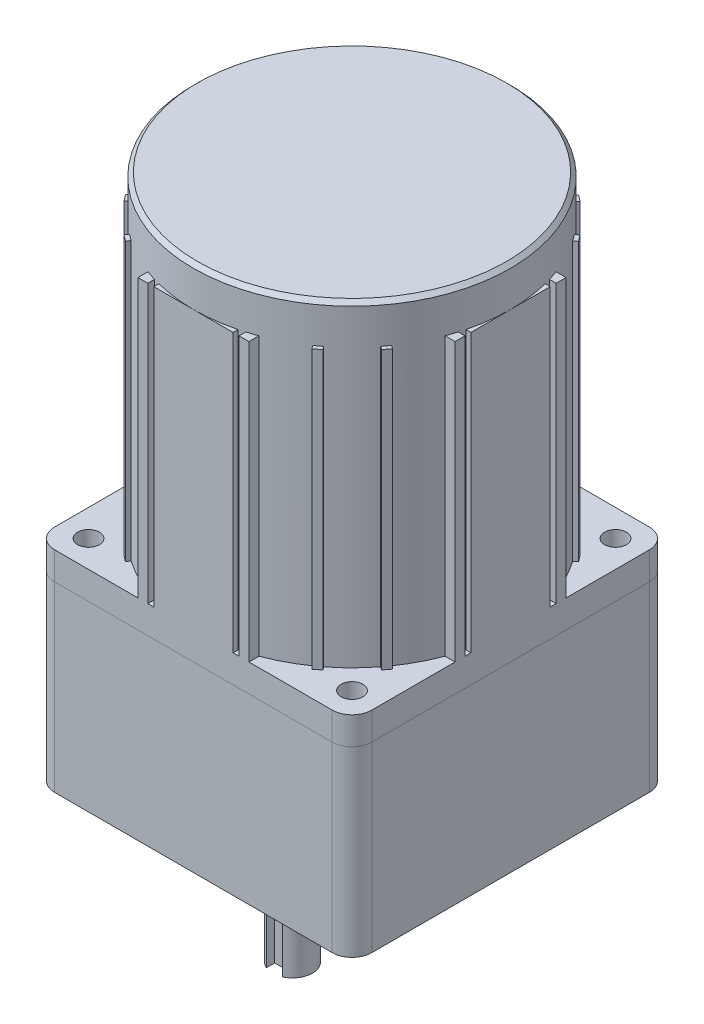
ISO-10303-21;
HEADER;
FILE_DESCRIPTION(('STEP AP214'),'2;1');
FILE_NAME('part.step','',(''),(''),'','','');
FILE_SCHEMA(('AUTOMOTIVE_DESIGN { 1 0 10303 214 1 1 1 1 }'));
ENDSEC;
DATA;
#1=APPLICATION_CONTEXT('core data for automotive mechanical design processes');
#2=APPLICATION_PROTOCOL_DEFINITION('international standard','automotive_design',2000,#1);
#3=PRODUCT_CONTEXT('',#1,'mechanical');
#4=PRODUCT('Part','Part','',(#3));
#5=PRODUCT_RELATED_PRODUCT_CATEGORY('part','',(#4));
#6=PRODUCT_DEFINITION_FORMATION('','',#4);
#7=PRODUCT_DEFINITION_CONTEXT('part definition',#1,'design');
#8=PRODUCT_DEFINITION('design','',#6,#7);
#9=PRODUCT_DEFINITION_SHAPE('','',#8);
#10=(LENGTH_UNIT() NAMED_UNIT(*) SI_UNIT(.MILLI.,.METRE.));
#11=(NAMED_UNIT(*) PLANE_ANGLE_UNIT() SI_UNIT($,.RADIAN.));
#12=(NAMED_UNIT(*) SI_UNIT($,.STERADIAN.) SOLID_ANGLE_UNIT());
#13=UNCERTAINTY_MEASURE_WITH_UNIT(LENGTH_MEASURE(1.E-05),#10,'distance_accuracy_value','');
#14=(GEOMETRIC_REPRESENTATION_CONTEXT(3) GLOBAL_UNCERTAINTY_ASSIGNED_CONTEXT((#13)) GLOBAL_UNIT_ASSIGNED_CONTEXT((#10,
#11,#12)) REPRESENTATION_CONTEXT('',''));
#15=CARTESIAN_POINT('',(0.,0.,0.));
#16=DIRECTION('',(0.,0.,1.));
#17=DIRECTION('',(1.,0.,0.));
#18=AXIS2_PLACEMENT_3D('',#15,#16,#17);
#19=CARTESIAN_POINT('',(0.,-46.,80.));
#20=DIRECTION('',(1.,0.,0.));
#21=DIRECTION('',(0.,0.,-1.));
#22=AXIS2_PLACEMENT_3D('',#19,#20,#21);
#23=PLANE('',#22);
#24=DIRECTION('',(0.,0.,-1.));
#25=VECTOR('',#24,1.);
#26=CARTESIAN_POINT('',(0.,0.,80.));
#27=LINE('',#26,#25);
#28=CARTESIAN_POINT('',(0.,0.,75.));
#29=VERTEX_POINT('',#28);
#30=CARTESIAN_POINT('',(0.,0.,5.));
#31=VERTEX_POINT('',#30);
#32=EDGE_CURVE('E214',#29,#31,#27,.T.);
#33=ORIENTED_EDGE('',*,*,#32,.T.);
#34=DIRECTION('',(0.,1.,0.));
#35=VECTOR('',#34,1.);
#36=CARTESIAN_POINT('',(0.,-46.,5.));
#37=LINE('',#36,#35);
#38=CARTESIAN_POINT('',(0.,-46.,5.));
#39=VERTEX_POINT('',#38);
#40=EDGE_CURVE('E263',#31,#39,#37,.F.);
#41=ORIENTED_EDGE('',*,*,#40,.T.);
#42=DIRECTION('',(0.,0.,-1.));
#43=VECTOR('',#42,1.);
#44=CARTESIAN_POINT('',(0.,-46.,80.));
#45=LINE('',#44,#43);
#46=CARTESIAN_POINT('',(0.,-46.,75.));
#47=VERTEX_POINT('',#46);
#48=EDGE_CURVE('E203',#47,#39,#45,.T.);
#49=ORIENTED_EDGE('',*,*,#48,.F.);
#50=DIRECTION('',(0.,1.,0.));
#51=VECTOR('',#50,1.);
#52=CARTESIAN_POINT('',(0.,-46.,75.));
#53=LINE('',#52,#51);
#54=EDGE_CURVE('E260',#47,#29,#53,.T.);
#55=ORIENTED_EDGE('',*,*,#54,.T.);
#56=EDGE_LOOP('',(#33,#41,#49,#55));
#57=FACE_BOUND('',#56,.T.);
#58=ADVANCED_FACE('F45',(#57),#23,.F.);
#59=CARTESIAN_POINT('',(0.,-46.,0.));
#60=DIRECTION('',(0.,0.,1.));
#61=DIRECTION('',(1.,0.,0.));
#62=AXIS2_PLACEMENT_3D('',#59,#60,#61);
#63=PLANE('',#62);
#64=DIRECTION('',(1.,0.,0.));
#65=VECTOR('',#64,1.);
#66=CARTESIAN_POINT('',(0.,0.,0.));
#67=LINE('',#66,#65);
#68=CARTESIAN_POINT('',(5.00000000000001,0.,0.));
#69=VERTEX_POINT('',#68);
#70=CARTESIAN_POINT('',(75.,0.,0.));
#71=VERTEX_POINT('',#70);
#72=EDGE_CURVE('E217',#69,#71,#67,.T.);
#73=ORIENTED_EDGE('',*,*,#72,.T.);
#74=DIRECTION('',(0.,1.,0.));
#75=VECTOR('',#74,1.);
#76=CARTESIAN_POINT('',(75.,-46.,0.));
#77=LINE('',#76,#75);
#78=CARTESIAN_POINT('',(75.,-46.,0.));
#79=VERTEX_POINT('',#78);
#80=EDGE_CURVE('E250',#71,#79,#77,.F.);
#81=ORIENTED_EDGE('',*,*,#80,.T.);
#82=DIRECTION('',(1.,0.,0.));
#83=VECTOR('',#82,1.);
#84=CARTESIAN_POINT('',(0.,-46.,0.));
#85=LINE('',#84,#83);
#86=CARTESIAN_POINT('',(5.00000000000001,-46.,0.));
#87=VERTEX_POINT('',#86);
#88=EDGE_CURVE('E206',#87,#79,#85,.T.);
#89=ORIENTED_EDGE('',*,*,#88,.F.);
#90=DIRECTION('',(0.,1.,0.));
#91=VECTOR('',#90,1.);
#92=CARTESIAN_POINT('',(5.00000000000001,-46.,0.));
#93=LINE('',#92,#91);
#94=EDGE_CURVE('E247',#87,#69,#93,.T.);
#95=ORIENTED_EDGE('',*,*,#94,.T.);
#96=EDGE_LOOP('',(#73,#81,#89,#95));
#97=FACE_BOUND('',#96,.T.);
#98=ADVANCED_FACE('F293',(#97),#63,.F.);
#99=CARTESIAN_POINT('',(80.,-46.,80.));
#100=DIRECTION('',(-1.,0.,0.));
#101=DIRECTION('',(0.,0.,1.));
#102=AXIS2_PLACEMENT_3D('',#99,#100,#101);
#103=PLANE('',#102);
#104=DIRECTION('',(0.,0.,1.));
#105=VECTOR('',#104,1.);
#106=CARTESIAN_POINT('',(80.,-46.,80.));
#107=LINE('',#106,#105);
#108=CARTESIAN_POINT('',(80.,-46.,5.));
#109=VERTEX_POINT('',#108);
#110=CARTESIAN_POINT('',(80.,-46.,75.));
#111=VERTEX_POINT('',#110);
#112=EDGE_CURVE('E210',#109,#111,#107,.T.);
#113=ORIENTED_EDGE('',*,*,#112,.F.);
#114=DIRECTION('',(0.,1.,0.));
#115=VECTOR('',#114,1.);
#116=CARTESIAN_POINT('',(80.,-46.,5.));
#117=LINE('',#116,#115);
#118=CARTESIAN_POINT('',(80.,0.,5.));
#119=VERTEX_POINT('',#118);
#120=EDGE_CURVE('E236',#109,#119,#117,.T.);
#121=ORIENTED_EDGE('',*,*,#120,.T.);
#122=DIRECTION('',(0.,0.,1.));
#123=VECTOR('',#122,1.);
#124=CARTESIAN_POINT('',(80.,0.,80.));
#125=LINE('',#124,#123);
#126=CARTESIAN_POINT('',(80.,0.,75.));
#127=VERTEX_POINT('',#126);
#128=EDGE_CURVE('E221',#119,#127,#125,.T.);
#129=ORIENTED_EDGE('',*,*,#128,.T.);
#130=DIRECTION('',(0.,1.,0.));
#131=VECTOR('',#130,1.);
#132=CARTESIAN_POINT('',(80.,-46.,75.));
#133=LINE('',#132,#131);
#134=EDGE_CURVE('E177',#127,#111,#133,.F.);
#135=ORIENTED_EDGE('',*,*,#134,.T.);
#136=EDGE_LOOP('',(#113,#121,#129,#135));
#137=FACE_BOUND('',#136,.T.);
#138=ADVANCED_FACE('F301',(#137),#103,.F.);
#139=CARTESIAN_POINT('',(0.,-46.,80.));
#140=DIRECTION('',(0.,0.,-1.));
#141=DIRECTION('',(-1.,0.,0.));
#142=AXIS2_PLACEMENT_3D('',#139,#140,#141);
#143=PLANE('',#142);
#144=DIRECTION('',(-1.,0.,0.));
#145=VECTOR('',#144,1.);
#146=CARTESIAN_POINT('',(0.,0.,80.));
#147=LINE('',#146,#145);
#148=CARTESIAN_POINT('',(75.,0.,80.));
#149=VERTEX_POINT('',#148);
#150=CARTESIAN_POINT('',(5.00000000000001,0.,80.));
#151=VERTEX_POINT('',#150);
#152=EDGE_CURVE('E207',#149,#151,#147,.T.);
#153=ORIENTED_EDGE('',*,*,#152,.T.);
#154=DIRECTION('',(0.,1.,0.));
#155=VECTOR('',#154,1.);
#156=CARTESIAN_POINT('',(5.00000000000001,-46.,80.));
#157=LINE('',#156,#155);
#158=CARTESIAN_POINT('',(5.00000000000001,-46.,80.));
#159=VERTEX_POINT('',#158);
#160=EDGE_CURVE('E73',#151,#159,#157,.F.);
#161=ORIENTED_EDGE('',*,*,#160,.T.);
#162=DIRECTION('',(-1.,0.,0.));
#163=VECTOR('',#162,1.);
#164=CARTESIAN_POINT('',(0.,-46.,80.));
#165=LINE('',#164,#163);
#166=CARTESIAN_POINT('',(75.,-46.,80.));
#167=VERTEX_POINT('',#166);
#168=EDGE_CURVE('E178',#167,#159,#165,.T.);
#169=ORIENTED_EDGE('',*,*,#168,.F.);
#170=DIRECTION('',(0.,1.,0.));
#171=VECTOR('',#170,1.);
#172=CARTESIAN_POINT('',(75.,-46.,80.));
#173=LINE('',#172,#171);
#174=EDGE_CURVE('E265',#167,#149,#173,.T.);
#175=ORIENTED_EDGE('',*,*,#174,.T.);
#176=EDGE_LOOP('',(#153,#161,#169,#175));
#177=FACE_BOUND('',#176,.T.);
#178=ADVANCED_FACE('F270',(#177),#143,.F.);
#179=CARTESIAN_POINT('',(0.,-46.,0.));
#180=DIRECTION('',(0.,-1.,0.));
#181=DIRECTION('',(0.,0.,-1.));
#182=AXIS2_PLACEMENT_3D('',#179,#180,#181);
#183=PLANE('',#182);
#184=CARTESIAN_POINT('',(40.,-46.,40.));
#185=DIRECTION('',(0.,-1.,0.));
#186=DIRECTION('',(0.,0.,-1.));
#187=AXIS2_PLACEMENT_3D('',#184,#185,#186);
#188=CIRCLE('',#187,36.5);
#189=CARTESIAN_POINT('',(40.,-46.,3.49999999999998));
#190=VERTEX_POINT('',#189);
#191=EDGE_CURVE('E182',#190,#190,#188,.T.);
#192=ORIENTED_EDGE('',*,*,#191,.F.);
#193=EDGE_LOOP('',(#192));
#194=FACE_BOUND('',#193,.T.);
#195=CARTESIAN_POINT('',(6.76598128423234,-46.,73.2340187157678));
#196=DIRECTION('',(0.,-1.,0.));
#197=DIRECTION('',(0.,0.,-1.));
#198=AXIS2_PLACEMENT_3D('',#195,#196,#197);
#199=CIRCLE('',#198,2.75);
#200=CARTESIAN_POINT('',(6.76598128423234,-46.,70.4840187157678));
#201=VERTEX_POINT('',#200);
#202=EDGE_CURVE('E191',#201,#201,#199,.T.);
#203=ORIENTED_EDGE('',*,*,#202,.F.);
#204=EDGE_LOOP('',(#203));
#205=FACE_BOUND('',#204,.T.);
#206=CARTESIAN_POINT('',(6.76598128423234,-46.,6.76598128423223));
#207=DIRECTION('',(0.,-1.,0.));
#208=DIRECTION('',(0.,0.,1.));
#209=AXIS2_PLACEMENT_3D('',#206,#207,#208);
#210=CIRCLE('',#209,2.75);
#211=CARTESIAN_POINT('',(6.76598128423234,-46.,9.51598128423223));
#212=VERTEX_POINT('',#211);
#213=EDGE_CURVE('E195',#212,#212,#210,.T.);
#214=ORIENTED_EDGE('',*,*,#213,.F.);
#215=EDGE_LOOP('',(#214));
#216=FACE_BOUND('',#215,.T.);
#217=CARTESIAN_POINT('',(73.2340187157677,-46.,73.2340187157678));
#218=DIRECTION('',(0.,-1.,0.));
#219=DIRECTION('',(0.,0.,1.));
#220=AXIS2_PLACEMENT_3D('',#217,#218,#219);
#221=CIRCLE('',#220,2.75000000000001);
#222=CARTESIAN_POINT('',(73.2340187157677,-46.,75.9840187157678));
#223=VERTEX_POINT('',#222);
#224=EDGE_CURVE('E198',#223,#223,#221,.T.);
#225=ORIENTED_EDGE('',*,*,#224,.F.);
#226=EDGE_LOOP('',(#225));
#227=FACE_BOUND('',#226,.T.);
#228=CARTESIAN_POINT('',(73.2340187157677,-46.,6.76598128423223));
#229=DIRECTION('',(0.,-1.,0.));
#230=DIRECTION('',(0.,0.,-1.));
#231=AXIS2_PLACEMENT_3D('',#228,#229,#230);
#232=CIRCLE('',#231,2.75000000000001);
#233=CARTESIAN_POINT('',(73.2340187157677,-46.,4.01598128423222));
#234=VERTEX_POINT('',#233);
#235=EDGE_CURVE('E188',#234,#234,#232,.T.);
#236=ORIENTED_EDGE('',*,*,#235,.F.);
#237=EDGE_LOOP('',(#236));
#238=FACE_BOUND('',#237,.T.);
#239=ORIENTED_EDGE('',*,*,#88,.T.);
#240=CARTESIAN_POINT('',(75.,-46.,5.));
#241=DIRECTION('',(0.,-1.,0.));
#242=DIRECTION('',(0.,0.,-1.));
#243=AXIS2_PLACEMENT_3D('',#240,#241,#242);
#244=CIRCLE('',#243,5.);
#245=EDGE_CURVE('E258',#79,#109,#244,.T.);
#246=ORIENTED_EDGE('',*,*,#245,.T.);
#247=ORIENTED_EDGE('',*,*,#112,.T.);
#248=CARTESIAN_POINT('',(75.,-46.,75.));
#249=DIRECTION('',(0.,-1.,0.));
#250=DIRECTION('',(0.,0.,-1.));
#251=AXIS2_PLACEMENT_3D('',#248,#249,#250);
#252=CIRCLE('',#251,5.);
#253=EDGE_CURVE('E252',#111,#167,#252,.T.);
#254=ORIENTED_EDGE('',*,*,#253,.T.);
#255=ORIENTED_EDGE('',*,*,#168,.T.);
#256=CARTESIAN_POINT('',(5.00000000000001,-46.,75.));
#257=DIRECTION('',(0.,-1.,0.));
#258=DIRECTION('',(0.,0.,-1.));
#259=AXIS2_PLACEMENT_3D('',#256,#257,#258);
#260=CIRCLE('',#259,5.);
#261=EDGE_CURVE('E254',#159,#47,#260,.T.);
#262=ORIENTED_EDGE('',*,*,#261,.T.);
#263=ORIENTED_EDGE('',*,*,#48,.T.);
#264=CARTESIAN_POINT('',(5.00000000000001,-46.,5.));
#265=DIRECTION('',(0.,-1.,0.));
#266=DIRECTION('',(0.,0.,-1.));
#267=AXIS2_PLACEMENT_3D('',#264,#265,#266);
#268=CIRCLE('',#267,5.);
#269=EDGE_CURVE('E256',#39,#87,#268,.T.);
#270=ORIENTED_EDGE('',*,*,#269,.T.);
#271=EDGE_LOOP('',(#239,#246,#247,#254,#255,#262,#263,#270));
#272=FACE_BOUND('',#271,.T.);
#273=ADVANCED_FACE('F286',(#194,#205,#216,#227,#238,#272),#183,.T.);
#274=CARTESIAN_POINT('',(0.,0.,0.));
#275=DIRECTION('',(0.,-1.,0.));
#276=DIRECTION('',(0.,0.,-1.));
#277=AXIS2_PLACEMENT_3D('',#274,#275,#276);
#278=PLANE('',#277);
#279=CARTESIAN_POINT('',(6.76598128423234,0.,73.2340187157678));
#280=DIRECTION('',(0.,-1.,0.));
#281=DIRECTION('',(0.,0.,-1.));
#282=AXIS2_PLACEMENT_3D('',#279,#280,#281);
#283=CIRCLE('',#282,2.75);
#284=CARTESIAN_POINT('',(6.76598128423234,0.,70.4840187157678));
#285=VERTEX_POINT('',#284);
#286=EDGE_CURVE('E218',#285,#285,#283,.T.);
#287=ORIENTED_EDGE('',*,*,#286,.T.);
#288=EDGE_LOOP('',(#287));
#289=FACE_BOUND('',#288,.T.);
#290=CARTESIAN_POINT('',(6.76598128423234,0.,6.76598128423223));
#291=DIRECTION('',(0.,-1.,0.));
#292=DIRECTION('',(0.,0.,-1.));
#293=AXIS2_PLACEMENT_3D('',#290,#291,#292);
#294=CIRCLE('',#293,2.75);
#295=CARTESIAN_POINT('',(6.76598128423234,0.,4.01598128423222));
#296=VERTEX_POINT('',#295);
#297=EDGE_CURVE('E230',#296,#296,#294,.T.);
#298=ORIENTED_EDGE('',*,*,#297,.T.);
#299=EDGE_LOOP('',(#298));
#300=FACE_BOUND('',#299,.T.);
#301=CARTESIAN_POINT('',(73.2340187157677,0.,73.2340187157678));
#302=DIRECTION('',(0.,-1.,0.));
#303=DIRECTION('',(0.,0.,-1.));
#304=AXIS2_PLACEMENT_3D('',#301,#302,#303);
#305=CIRCLE('',#304,2.75000000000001);
#306=CARTESIAN_POINT('',(73.2340187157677,0.,70.4840187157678));
#307=VERTEX_POINT('',#306);
#308=EDGE_CURVE('E227',#307,#307,#305,.T.);
#309=ORIENTED_EDGE('',*,*,#308,.T.);
#310=EDGE_LOOP('',(#309));
#311=FACE_BOUND('',#310,.T.);
#312=CARTESIAN_POINT('',(73.2340187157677,0.,6.76598128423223));
#313=DIRECTION('',(0.,-1.,0.));
#314=DIRECTION('',(0.,0.,-1.));
#315=AXIS2_PLACEMENT_3D('',#312,#313,#314);
#316=CIRCLE('',#315,2.75000000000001);
#317=CARTESIAN_POINT('',(73.2340187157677,0.,4.01598128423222));
#318=VERTEX_POINT('',#317);
#319=EDGE_CURVE('E194',#318,#318,#316,.T.);
#320=ORIENTED_EDGE('',*,*,#319,.T.);
#321=EDGE_LOOP('',(#320));
#322=FACE_BOUND('',#321,.T.);
#323=ORIENTED_EDGE('',*,*,#128,.F.);
#324=CARTESIAN_POINT('',(75.,0.,5.));
#325=DIRECTION('',(0.,-1.,0.));
#326=DIRECTION('',(0.,0.,-1.));
#327=AXIS2_PLACEMENT_3D('',#324,#325,#326);
#328=CIRCLE('',#327,5.);
#329=EDGE_CURVE('E245',#119,#71,#328,.F.);
#330=ORIENTED_EDGE('',*,*,#329,.T.);
#331=ORIENTED_EDGE('',*,*,#72,.F.);
#332=CARTESIAN_POINT('',(5.00000000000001,0.,5.));
#333=DIRECTION('',(0.,-1.,0.));
#334=DIRECTION('',(0.,0.,-1.));
#335=AXIS2_PLACEMENT_3D('',#332,#333,#334);
#336=CIRCLE('',#335,5.);
#337=EDGE_CURVE('E243',#69,#31,#336,.F.);
#338=ORIENTED_EDGE('',*,*,#337,.T.);
#339=ORIENTED_EDGE('',*,*,#32,.F.);
#340=CARTESIAN_POINT('',(5.00000000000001,0.,75.));
#341=DIRECTION('',(0.,-1.,0.));
#342=DIRECTION('',(0.,0.,-1.));
#343=AXIS2_PLACEMENT_3D('',#340,#341,#342);
#344=CIRCLE('',#343,5.);
#345=EDGE_CURVE('E241',#29,#151,#344,.F.);
#346=ORIENTED_EDGE('',*,*,#345,.T.);
#347=ORIENTED_EDGE('',*,*,#152,.F.);
#348=CARTESIAN_POINT('',(75.,0.,75.));
#349=DIRECTION('',(0.,-1.,0.));
#350=DIRECTION('',(0.,0.,-1.));
#351=AXIS2_PLACEMENT_3D('',#348,#349,#350);
#352=CIRCLE('',#351,5.);
#353=EDGE_CURVE('E239',#149,#127,#352,.F.);
#354=ORIENTED_EDGE('',*,*,#353,.T.);
#355=EDGE_LOOP('',(#323,#330,#331,#338,#339,#346,#347,#354));
#356=FACE_BOUND('',#355,.T.);
#357=ADVANCED_FACE('F275',(#289,#300,#311,#322,#356),#278,.F.);
#358=CARTESIAN_POINT('',(73.2340187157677,87.,6.76598128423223));
#359=DIRECTION('',(0.,-1.,0.));
#360=DIRECTION('',(0.,0.,-1.));
#361=AXIS2_PLACEMENT_3D('',#358,#359,#360);
#362=CYLINDRICAL_SURFACE('',#361,2.75000000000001);
#363=ORIENTED_EDGE('',*,*,#235,.T.);
#364=EDGE_LOOP('',(#363));
#365=FACE_BOUND('',#364,.T.);
#366=ORIENTED_EDGE('',*,*,#319,.F.);
#367=EDGE_LOOP('',(#366));
#368=FACE_BOUND('',#367,.T.);
#369=ADVANCED_FACE('F418',(#365,#368),#362,.F.);
#370=CARTESIAN_POINT('',(73.2340187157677,87.,73.2340187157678));
#371=DIRECTION('',(0.,-1.,0.));
#372=DIRECTION('',(0.,0.,-1.));
#373=AXIS2_PLACEMENT_3D('',#370,#371,#372);
#374=CYLINDRICAL_SURFACE('',#373,2.75000000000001);
#375=ORIENTED_EDGE('',*,*,#224,.T.);
#376=EDGE_LOOP('',(#375));
#377=FACE_BOUND('',#376,.T.);
#378=ORIENTED_EDGE('',*,*,#308,.F.);
#379=EDGE_LOOP('',(#378));
#380=FACE_BOUND('',#379,.T.);
#381=ADVANCED_FACE('F414',(#377,#380),#374,.F.);
#382=CARTESIAN_POINT('',(6.76598128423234,87.,6.76598128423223));
#383=DIRECTION('',(0.,-1.,0.));
#384=DIRECTION('',(0.,0.,-1.));
#385=AXIS2_PLACEMENT_3D('',#382,#383,#384);
#386=CYLINDRICAL_SURFACE('',#385,2.75);
#387=ORIENTED_EDGE('',*,*,#213,.T.);
#388=EDGE_LOOP('',(#387));
#389=FACE_BOUND('',#388,.T.);
#390=ORIENTED_EDGE('',*,*,#297,.F.);
#391=EDGE_LOOP('',(#390));
#392=FACE_BOUND('',#391,.T.);
#393=ADVANCED_FACE('F410',(#389,#392),#386,.F.);
#394=CARTESIAN_POINT('',(6.76598128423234,87.,73.2340187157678));
#395=DIRECTION('',(0.,-1.,0.));
#396=DIRECTION('',(0.,0.,-1.));
#397=AXIS2_PLACEMENT_3D('',#394,#395,#396);
#398=CYLINDRICAL_SURFACE('',#397,2.75);
#399=ORIENTED_EDGE('',*,*,#202,.T.);
#400=EDGE_LOOP('',(#399));
#401=FACE_BOUND('',#400,.T.);
#402=ORIENTED_EDGE('',*,*,#286,.F.);
#403=EDGE_LOOP('',(#402));
#404=FACE_BOUND('',#403,.T.);
#405=ADVANCED_FACE('F406',(#401,#404),#398,.F.);
#406=CARTESIAN_POINT('',(40.,-44.,40.));
#407=DIRECTION('',(0.,-1.,0.));
#408=DIRECTION('',(0.,0.,-1.));
#409=AXIS2_PLACEMENT_3D('',#406,#407,#408);
#410=CYLINDRICAL_SURFACE('',#409,36.5);
#411=CARTESIAN_POINT('',(40.,-44.,40.));
#412=DIRECTION('',(0.,-1.,0.));
#413=DIRECTION('',(0.,0.,-1.));
#414=AXIS2_PLACEMENT_3D('',#411,#412,#413);
#415=CIRCLE('',#414,36.5);
#416=CARTESIAN_POINT('',(40.,-44.,3.49999999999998));
#417=VERTEX_POINT('',#416);
#418=EDGE_CURVE('E185',#417,#417,#415,.T.);
#419=ORIENTED_EDGE('',*,*,#418,.F.);
#420=EDGE_LOOP('',(#419));
#421=FACE_BOUND('',#420,.T.);
#422=ORIENTED_EDGE('',*,*,#191,.T.);
#423=EDGE_LOOP('',(#422));
#424=FACE_BOUND('',#423,.T.);
#425=ADVANCED_FACE('F402',(#421,#424),#410,.F.);
#426=CARTESIAN_POINT('',(40.,-44.,40.));
#427=DIRECTION('',(0.,-1.,0.));
#428=DIRECTION('',(0.,0.,-1.));
#429=AXIS2_PLACEMENT_3D('',#426,#427,#428);
#430=PLANE('',#429);
#431=CARTESIAN_POINT('',(40.,-44.,55.));
#432=DIRECTION('',(0.,-1.,0.));
#433=DIRECTION('',(0.,0.,-1.));
#434=AXIS2_PLACEMENT_3D('',#431,#432,#433);
#435=CIRCLE('',#434,17.);
#436=CARTESIAN_POINT('',(40.,-44.,38.));
#437=VERTEX_POINT('',#436);
#438=EDGE_CURVE('E173',#437,#437,#435,.T.);
#439=ORIENTED_EDGE('',*,*,#438,.F.);
#440=EDGE_LOOP('',(#439));
#441=FACE_BOUND('',#440,.T.);
#442=ORIENTED_EDGE('',*,*,#418,.T.);
#443=EDGE_LOOP('',(#442));
#444=FACE_BOUND('',#443,.T.);
#445=ADVANCED_FACE('F398',(#441,#444),#430,.T.);
#446=CARTESIAN_POINT('',(40.,-49.,55.));
#447=DIRECTION('',(0.,1.,0.));
#448=DIRECTION('',(0.,0.,1.));
#449=AXIS2_PLACEMENT_3D('',#446,#447,#448);
#450=CYLINDRICAL_SURFACE('',#449,17.);
#451=CARTESIAN_POINT('',(40.,-49.,55.));
#452=DIRECTION('',(0.,-1.,0.));
#453=DIRECTION('',(0.,0.,-1.));
#454=AXIS2_PLACEMENT_3D('',#451,#452,#453);
#455=CIRCLE('',#454,17.);
#456=CARTESIAN_POINT('',(40.,-49.,38.));
#457=VERTEX_POINT('',#456);
#458=EDGE_CURVE('E179',#457,#457,#455,.T.);
#459=ORIENTED_EDGE('',*,*,#458,.F.);
#460=EDGE_LOOP('',(#459));
#461=FACE_BOUND('',#460,.T.);
#462=ORIENTED_EDGE('',*,*,#438,.T.);
#463=EDGE_LOOP('',(#462));
#464=FACE_BOUND('',#463,.T.);
#465=ADVANCED_FACE('F394',(#461,#464),#450,.T.);
#466=CARTESIAN_POINT('',(40.,-49.,55.));
#467=DIRECTION('',(0.,-1.,0.));
#468=DIRECTION('',(0.,0.,-1.));
#469=AXIS2_PLACEMENT_3D('',#466,#467,#468);
#470=PLANE('',#469);
#471=CARTESIAN_POINT('',(40.,-49.,55.));
#472=DIRECTION('',(0.,-1.,0.));
#473=DIRECTION('',(0.,0.,-1.));
#474=AXIS2_PLACEMENT_3D('',#471,#472,#473);
#475=CIRCLE('',#474,5.);
#476=CARTESIAN_POINT('',(40.,-49.,50.));
#477=VERTEX_POINT('',#476);
#478=EDGE_CURVE('E174',#477,#477,#475,.T.);
#479=ORIENTED_EDGE('',*,*,#478,.F.);
#480=EDGE_LOOP('',(#479));
#481=FACE_BOUND('',#480,.T.);
#482=ORIENTED_EDGE('',*,*,#458,.T.);
#483=EDGE_LOOP('',(#482));
#484=FACE_BOUND('',#483,.T.);
#485=ADVANCED_FACE('F346',(#481,#484),#470,.T.);
#486=CARTESIAN_POINT('',(40.,-78.,55.));
#487=DIRECTION('',(0.,1.,0.));
#488=DIRECTION('',(0.,0.,1.));
#489=AXIS2_PLACEMENT_3D('',#486,#487,#488);
#490=CYLINDRICAL_SURFACE('',#489,5.);
#491=CARTESIAN_POINT('',(40.,-78.,55.));
#492=DIRECTION('',(0.,-1.,0.));
#493=DIRECTION('',(0.,0.,-1.));
#494=AXIS2_PLACEMENT_3D('',#491,#492,#493);
#495=CIRCLE('',#494,5.);
#496=CARTESIAN_POINT('',(38.,-78.,59.5825756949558));
#497=VERTEX_POINT('',#496);
#498=CARTESIAN_POINT('',(42.,-78.,59.5825756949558));
#499=VERTEX_POINT('',#498);
#500=EDGE_CURVE('E159',#497,#499,#495,.T.);
#501=ORIENTED_EDGE('',*,*,#500,.F.);
#502=DIRECTION('',(0.,1.,0.));
#503=VECTOR('',#502,1.);
#504=CARTESIAN_POINT('',(38.,-78.,59.5825756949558));
#505=LINE('',#504,#503);
#506=CARTESIAN_POINT('',(38.,-55.,59.5825756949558));
#507=VERTEX_POINT('',#506);
#508=EDGE_CURVE('E168',#497,#507,#505,.T.);
#509=ORIENTED_EDGE('',*,*,#508,.T.);
#510=CARTESIAN_POINT('',(38.,-55.,59.5825756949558));
#511=CARTESIAN_POINT('',(37.9999920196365,-54.9461941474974,59.5825646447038));
#512=CARTESIAN_POINT('',(38.0021710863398,-54.8923943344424,59.5835230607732));
#513=CARTESIAN_POINT('',(38.0108409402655,-54.7852287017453,59.5872962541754));
#514=CARTESIAN_POINT('',(38.0173300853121,-54.731862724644,59.5901103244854));
#515=CARTESIAN_POINT('',(38.0345239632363,-54.6261531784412,59.5974978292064));
#516=CARTESIAN_POINT('',(38.0452120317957,-54.573806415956,59.6020643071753));
#517=CARTESIAN_POINT('',(38.0706836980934,-54.4702992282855,59.6128005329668));
#518=CARTESIAN_POINT('',(38.0854675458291,-54.4191388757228,59.618970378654));
#519=CARTESIAN_POINT('',(38.1357302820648,-54.268064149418,59.6395929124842));
#520=CARTESIAN_POINT('',(38.1771551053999,-54.1703457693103,59.6561744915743));
#521=CARTESIAN_POINT('',(38.2745180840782,-53.9832044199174,59.6931237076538));
#522=CARTESIAN_POINT('',(38.3304700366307,-53.8937894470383,59.7134949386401));
#523=CARTESIAN_POINT('',(38.4586816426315,-53.7207376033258,59.7570099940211));
#524=CARTESIAN_POINT('',(38.5316308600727,-53.6376327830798,59.7802424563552));
#525=CARTESIAN_POINT('',(38.6903035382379,-53.4844597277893,59.8261279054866));
#526=CARTESIAN_POINT('',(38.7760296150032,-53.4143941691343,59.8487807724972));
#527=CARTESIAN_POINT('',(38.9619940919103,-53.2865936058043,59.8920341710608));
#528=CARTESIAN_POINT('',(39.062672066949,-53.2294551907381,59.9125182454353));
#529=CARTESIAN_POINT('',(39.2731758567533,-53.1331559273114,59.94803944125));
#530=CARTESIAN_POINT('',(39.3829978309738,-53.0939875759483,59.9630788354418));
#531=CARTESIAN_POINT('',(39.6030325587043,-53.0366587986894,59.9853831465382));
#532=CARTESIAN_POINT('',(39.7129689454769,-53.0175730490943,59.9929892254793));
#533=CARTESIAN_POINT('',(39.9347315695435,-52.9979715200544,60.0008031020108));
#534=CARTESIAN_POINT('',(40.0465571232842,-52.9974491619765,60.0010135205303));
#535=CARTESIAN_POINT('',(40.2622333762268,-53.0144828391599,59.994219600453));
#536=CARTESIAN_POINT('',(40.3661792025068,-53.031025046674,59.9876198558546));
#537=CARTESIAN_POINT('',(40.5696747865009,-53.0799934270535,59.9684927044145));
#538=CARTESIAN_POINT('',(40.6692242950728,-53.1124204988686,59.9559649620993));
#539=CARTESIAN_POINT('',(40.8628975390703,-53.1926362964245,59.9259683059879));
#540=CARTESIAN_POINT('',(40.9569168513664,-53.2406492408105,59.9084277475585));
#541=CARTESIAN_POINT('',(41.1358074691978,-53.3504645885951,59.8701460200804));
#542=CARTESIAN_POINT('',(41.220675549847,-53.4122718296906,59.8494037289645));
#543=CARTESIAN_POINT('',(41.3847633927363,-53.5526441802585,59.8052178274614));
#544=CARTESIAN_POINT('',(41.4632477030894,-53.63204247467,59.7816862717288));
#545=CARTESIAN_POINT('',(41.6060992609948,-53.8029800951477,59.7356195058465));
#546=CARTESIAN_POINT('',(41.6704600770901,-53.8945249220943,59.7130847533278));
#547=CARTESIAN_POINT('',(41.7849365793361,-54.0904702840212,59.6709568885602));
#548=CARTESIAN_POINT('',(41.8345893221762,-54.1951648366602,59.6514670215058));
#549=CARTESIAN_POINT('',(41.9152129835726,-54.4123615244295,59.6188610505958));
#550=CARTESIAN_POINT('',(41.9462169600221,-54.5248494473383,59.6057336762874));
#551=CARTESIAN_POINT('',(41.9781058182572,-54.698743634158,59.5920830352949));
#552=CARTESIAN_POINT('',(41.9863050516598,-54.7586575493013,59.5885343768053));
#553=CARTESIAN_POINT('',(41.9972528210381,-54.8790350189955,59.5837754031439));
#554=CARTESIAN_POINT('',(42.0000047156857,-54.9394982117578,59.5825636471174));
#555=CARTESIAN_POINT('',(42.,-55.,59.5825756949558));
#556=B_SPLINE_CURVE_WITH_KNOTS('',3,(#510,#511,#512,#513,#514,#515,#516,#517,#518,#519,#520,
#521,#522,#523,#524,#525,#526,#527,#528,#529,#530,#531,#532,#533,#534,#535,#536,#537,#538,#539,
#540,#541,#542,#543,#544,#545,#546,#547,#548,#549,#550,#551,#552,#553,#554,#555),.UNSPECIFIED.,
.F.,.F.,(4,2,2,2,2,2,2,2,2,2,2,2,2,2,2,2,2,2,2,2,2,2,4),(0.,0.161354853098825,0.322648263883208,
0.483307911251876,0.643977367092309,0.964683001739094,1.28569434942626,1.62318047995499,
1.96073580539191,2.31162858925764,2.66237473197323,2.99613876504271,3.32978451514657,
3.64468915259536,3.95961161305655,4.27928176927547,4.5990642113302,4.93981874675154,
5.28072813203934,5.63144241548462,5.98153315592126,6.16300192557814,6.34435877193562),.UNSPECIFIED.);
#557=CARTESIAN_POINT('',(42.,-55.,59.5825756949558));
#558=VERTEX_POINT('',#557);
#559=EDGE_CURVE('E13',#507,#558,#556,.T.);
#560=ORIENTED_EDGE('',*,*,#559,.T.);
#561=DIRECTION('',(0.,1.,0.));
#562=VECTOR('',#561,1.);
#563=CARTESIAN_POINT('',(42.,-78.,59.5825756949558));
#564=LINE('',#563,#562);
#565=EDGE_CURVE('E166',#558,#499,#564,.F.);
#566=ORIENTED_EDGE('',*,*,#565,.T.);
#567=EDGE_LOOP('',(#501,#509,#560,#566));
#568=FACE_BOUND('',#567,.T.);
#569=ORIENTED_EDGE('',*,*,#478,.T.);
#570=EDGE_LOOP('',(#569));
#571=FACE_BOUND('',#570,.T.);
#572=ADVANCED_FACE('F341',(#568,#571),#490,.T.);
#573=CARTESIAN_POINT('',(40.,-78.,55.));
#574=DIRECTION('',(0.,-1.,0.));
#575=DIRECTION('',(0.,0.,-1.));
#576=AXIS2_PLACEMENT_3D('',#573,#574,#575);
#577=PLANE('',#576);
#578=DIRECTION('',(0.,0.,1.));
#579=VECTOR('',#578,1.);
#580=CARTESIAN_POINT('',(38.,-78.,57.5));
#581=LINE('',#580,#579);
#582=CARTESIAN_POINT('',(38.,-78.,57.5));
#583=VERTEX_POINT('',#582);
#584=EDGE_CURVE('E169',#583,#497,#581,.T.);
#585=ORIENTED_EDGE('',*,*,#584,.T.);
#586=ORIENTED_EDGE('',*,*,#500,.T.);
#587=DIRECTION('',(0.,0.,1.));
#588=VECTOR('',#587,1.);
#589=CARTESIAN_POINT('',(42.,-78.,57.5));
#590=LINE('',#589,#588);
#591=CARTESIAN_POINT('',(42.,-78.,57.5));
#592=VERTEX_POINT('',#591);
#593=EDGE_CURVE('E149',#592,#499,#590,.T.);
#594=ORIENTED_EDGE('',*,*,#593,.F.);
#595=DIRECTION('',(-1.,0.,0.));
#596=VECTOR('',#595,1.);
#597=CARTESIAN_POINT('',(40.,-78.,57.5));
#598=LINE('',#597,#596);
#599=EDGE_CURVE('E58',#592,#583,#598,.T.);
#600=ORIENTED_EDGE('',*,*,#599,.T.);
#601=EDGE_LOOP('',(#585,#586,#594,#600));
#602=FACE_BOUND('',#601,.T.);
#603=ADVANCED_FACE('F157',(#602),#577,.T.);
#604=CARTESIAN_POINT('',(75.,-46.,5.));
#605=DIRECTION('',(0.,1.,0.));
#606=DIRECTION('',(0.,0.,1.));
#607=AXIS2_PLACEMENT_3D('',#604,#605,#606);
#608=CYLINDRICAL_SURFACE('',#607,5.);
#609=ORIENTED_EDGE('',*,*,#245,.F.);
#610=ORIENTED_EDGE('',*,*,#80,.F.);
#611=ORIENTED_EDGE('',*,*,#329,.F.);
#612=ORIENTED_EDGE('',*,*,#120,.F.);
#613=EDGE_LOOP('',(#609,#610,#611,#612));
#614=FACE_BOUND('',#613,.T.);
#615=ADVANCED_FACE('F298',(#614),#608,.T.);
#616=CARTESIAN_POINT('',(5.00000000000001,-46.,5.));
#617=DIRECTION('',(0.,1.,0.));
#618=DIRECTION('',(0.,0.,1.));
#619=AXIS2_PLACEMENT_3D('',#616,#617,#618);
#620=CYLINDRICAL_SURFACE('',#619,5.);
#621=ORIENTED_EDGE('',*,*,#269,.F.);
#622=ORIENTED_EDGE('',*,*,#40,.F.);
#623=ORIENTED_EDGE('',*,*,#337,.F.);
#624=ORIENTED_EDGE('',*,*,#94,.F.);
#625=EDGE_LOOP('',(#621,#622,#623,#624));
#626=FACE_BOUND('',#625,.T.);
#627=ADVANCED_FACE('F290',(#626),#620,.T.);
#628=CARTESIAN_POINT('',(5.00000000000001,-46.,75.));
#629=DIRECTION('',(0.,1.,0.));
#630=DIRECTION('',(0.,0.,1.));
#631=AXIS2_PLACEMENT_3D('',#628,#629,#630);
#632=CYLINDRICAL_SURFACE('',#631,5.);
#633=ORIENTED_EDGE('',*,*,#261,.F.);
#634=ORIENTED_EDGE('',*,*,#160,.F.);
#635=ORIENTED_EDGE('',*,*,#345,.F.);
#636=ORIENTED_EDGE('',*,*,#54,.F.);
#637=EDGE_LOOP('',(#633,#634,#635,#636));
#638=FACE_BOUND('',#637,.T.);
#639=ADVANCED_FACE('F280',(#638),#632,.T.);
#640=CARTESIAN_POINT('',(75.,-46.,75.));
#641=DIRECTION('',(0.,1.,0.));
#642=DIRECTION('',(0.,0.,1.));
#643=AXIS2_PLACEMENT_3D('',#640,#641,#642);
#644=CYLINDRICAL_SURFACE('',#643,5.);
#645=ORIENTED_EDGE('',*,*,#253,.F.);
#646=ORIENTED_EDGE('',*,*,#134,.F.);
#647=ORIENTED_EDGE('',*,*,#353,.F.);
#648=ORIENTED_EDGE('',*,*,#174,.F.);
#649=EDGE_LOOP('',(#645,#646,#647,#648));
#650=FACE_BOUND('',#649,.T.);
#651=ADVANCED_FACE('F47',(#650),#644,.T.);
#652=CARTESIAN_POINT('',(40.,-55.,57.5));
#653=DIRECTION('',(0.,0.,1.));
#654=DIRECTION('',(1.,0.,0.));
#655=AXIS2_PLACEMENT_3D('',#652,#653,#654);
#656=CYLINDRICAL_SURFACE('',#655,2.);
#657=DIRECTION('',(0.,0.,1.));
#658=VECTOR('',#657,1.);
#659=CARTESIAN_POINT('',(38.,-55.,57.5));
#660=LINE('',#659,#658);
#661=CARTESIAN_POINT('',(38.,-55.,57.5));
#662=VERTEX_POINT('',#661);
#663=EDGE_CURVE('E161',#662,#507,#660,.T.);
#664=ORIENTED_EDGE('',*,*,#663,.F.);
#665=CARTESIAN_POINT('',(40.,-55.,57.5));
#666=DIRECTION('',(0.,0.,1.));
#667=DIRECTION('',(1.,0.,0.));
#668=AXIS2_PLACEMENT_3D('',#665,#666,#667);
#669=CIRCLE('',#668,2.);
#670=CARTESIAN_POINT('',(42.,-55.,57.5));
#671=VERTEX_POINT('',#670);
#672=EDGE_CURVE('E154',#671,#662,#669,.T.);
#673=ORIENTED_EDGE('',*,*,#672,.F.);
#674=DIRECTION('',(0.,0.,1.));
#675=VECTOR('',#674,1.);
#676=CARTESIAN_POINT('',(42.,-55.,57.5));
#677=LINE('',#676,#675);
#678=EDGE_CURVE('E152',#671,#558,#677,.T.);
#679=ORIENTED_EDGE('',*,*,#678,.T.);
#680=ORIENTED_EDGE('',*,*,#559,.F.);
#681=EDGE_LOOP('',(#664,#673,#679,#680));
#682=FACE_BOUND('',#681,.T.);
#683=ADVANCED_FACE('F304',(#682),#656,.F.);
#684=CARTESIAN_POINT('',(38.,-78.,57.5));
#685=DIRECTION('',(-1.,0.,0.));
#686=DIRECTION('',(0.,0.,1.));
#687=AXIS2_PLACEMENT_3D('',#684,#685,#686);
#688=PLANE('',#687);
#689=ORIENTED_EDGE('',*,*,#584,.F.);
#690=DIRECTION('',(0.,-1.,0.));
#691=VECTOR('',#690,1.);
#692=CARTESIAN_POINT('',(38.,-78.,57.5));
#693=LINE('',#692,#691);
#694=EDGE_CURVE('E65',#662,#583,#693,.T.);
#695=ORIENTED_EDGE('',*,*,#694,.F.);
#696=ORIENTED_EDGE('',*,*,#663,.T.);
#697=ORIENTED_EDGE('',*,*,#508,.F.);
#698=EDGE_LOOP('',(#689,#695,#696,#697));
#699=FACE_BOUND('',#698,.T.);
#700=ADVANCED_FACE('F309',(#699),#688,.F.);
#701=CARTESIAN_POINT('',(42.,-78.,57.5));
#702=DIRECTION('',(1.,0.,0.));
#703=DIRECTION('',(0.,0.,-1.));
#704=AXIS2_PLACEMENT_3D('',#701,#702,#703);
#705=PLANE('',#704);
#706=ORIENTED_EDGE('',*,*,#678,.F.);
#707=DIRECTION('',(0.,1.,0.));
#708=VECTOR('',#707,1.);
#709=CARTESIAN_POINT('',(42.,-78.,57.5));
#710=LINE('',#709,#708);
#711=EDGE_CURVE('E143',#592,#671,#710,.T.);
#712=ORIENTED_EDGE('',*,*,#711,.F.);
#713=ORIENTED_EDGE('',*,*,#593,.T.);
#714=ORIENTED_EDGE('',*,*,#565,.F.);
#715=EDGE_LOOP('',(#706,#712,#713,#714));
#716=FACE_BOUND('',#715,.T.);
#717=ADVANCED_FACE('F148',(#716),#705,.F.);
#718=CARTESIAN_POINT('',(40.,-78.,57.5));
#719=DIRECTION('',(0.,0.,1.));
#720=DIRECTION('',(1.,0.,0.));
#721=AXIS2_PLACEMENT_3D('',#718,#719,#720);
#722=PLANE('',#721);
#723=ORIENTED_EDGE('',*,*,#711,.T.);
#724=ORIENTED_EDGE('',*,*,#672,.T.);
#725=ORIENTED_EDGE('',*,*,#694,.T.);
#726=ORIENTED_EDGE('',*,*,#599,.F.);
#727=EDGE_LOOP('',(#723,#724,#725,#726));
#728=FACE_BOUND('',#727,.T.);
#729=ADVANCED_FACE('F142',(#728),#722,.T.);
#730=CLOSED_SHELL('',(#58,#98,#138,#178,#273,#357,#369,#381,#393,#405,#425,#445,#465,#485,#572,
#603,#615,#627,#639,#651,#683,#700,#717,#729));
#731=MANIFOLD_SOLID_BREP('B2',#730);
#732=CARTESIAN_POINT('',(0.,87.,80.));
#733=DIRECTION('',(0.,0.,-1.));
#734=DIRECTION('',(-1.,0.,0.));
#735=AXIS2_PLACEMENT_3D('',#732,#733,#734);
#736=PLANE('',#735);
#737=DIRECTION('',(1.,0.,0.));
#738=VECTOR('',#737,1.);
#739=CARTESIAN_POINT('',(0.,7.,80.));
#740=LINE('',#739,#738);
#741=CARTESIAN_POINT('',(5.00000000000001,7.,80.));
#742=VERTEX_POINT('',#741);
#743=CARTESIAN_POINT('',(26.,7.,80.));
#744=VERTEX_POINT('',#743);
#745=EDGE_CURVE('E1224',#742,#744,#740,.T.);
#746=ORIENTED_EDGE('',*,*,#745,.F.);
#747=DIRECTION('',(0.,-1.,0.));
#748=VECTOR('',#747,1.);
#749=CARTESIAN_POINT('',(5.00000000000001,87.,80.));
#750=LINE('',#749,#748);
#751=CARTESIAN_POINT('',(5.00000000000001,0.,80.));
#752=VERTEX_POINT('',#751);
#753=EDGE_CURVE('E1219',#742,#752,#750,.T.);
#754=ORIENTED_EDGE('',*,*,#753,.T.);
#755=DIRECTION('',(1.,0.,0.));
#756=VECTOR('',#755,1.);
#757=CARTESIAN_POINT('',(0.,0.,80.));
#758=LINE('',#757,#756);
#759=CARTESIAN_POINT('',(75.,0.,80.));
#760=VERTEX_POINT('',#759);
#761=EDGE_CURVE('E1171',#752,#760,#758,.T.);
#762=ORIENTED_EDGE('',*,*,#761,.T.);
#763=DIRECTION('',(0.,-1.,0.));
#764=VECTOR('',#763,1.);
#765=CARTESIAN_POINT('',(75.,87.,80.));
#766=LINE('',#765,#764);
#767=CARTESIAN_POINT('',(75.,7.,80.));
#768=VERTEX_POINT('',#767);
#769=EDGE_CURVE('E568',#760,#768,#766,.F.);
#770=ORIENTED_EDGE('',*,*,#769,.T.);
#771=DIRECTION('',(-1.,0.,0.));
#772=VECTOR('',#771,1.);
#773=CARTESIAN_POINT('',(80.,7.,80.));
#774=LINE('',#773,#772);
#775=CARTESIAN_POINT('',(54.,7.,80.));
#776=VERTEX_POINT('',#775);
#777=EDGE_CURVE('E1244',#768,#776,#774,.T.);
#778=ORIENTED_EDGE('',*,*,#777,.T.);
#779=DIRECTION('',(0.,1.,0.));
#780=VECTOR('',#779,1.);
#781=CARTESIAN_POINT('',(54.,-36.7695526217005,80.));
#782=LINE('',#781,#780);
#783=CARTESIAN_POINT('',(54.,77.,80.));
#784=VERTEX_POINT('',#783);
#785=EDGE_CURVE('E1256',#776,#784,#782,.T.);
#786=ORIENTED_EDGE('',*,*,#785,.T.);
#787=DIRECTION('',(1.,0.,0.));
#788=VECTOR('',#787,1.);
#789=CARTESIAN_POINT('',(0.,77.,80.));
#790=LINE('',#789,#788);
#791=CARTESIAN_POINT('',(51.5,77.,80.));
#792=VERTEX_POINT('',#791);
#793=EDGE_CURVE('E1160',#792,#784,#790,.T.);
#794=ORIENTED_EDGE('',*,*,#793,.F.);
#795=DIRECTION('',(0.,1.,0.));
#796=VECTOR('',#795,1.);
#797=CARTESIAN_POINT('',(51.5,-36.7695526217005,80.));
#798=LINE('',#797,#796);
#799=CARTESIAN_POINT('',(51.5,7.,80.));
#800=VERTEX_POINT('',#799);
#801=EDGE_CURVE('E3032',#800,#792,#798,.T.);
#802=ORIENTED_EDGE('',*,*,#801,.F.);
#803=DIRECTION('',(-1.,0.,0.));
#804=VECTOR('',#803,1.);
#805=CARTESIAN_POINT('',(80.,7.,80.));
#806=LINE('',#805,#804);
#807=CARTESIAN_POINT('',(50.,7.,80.));
#808=VERTEX_POINT('',#807);
#809=EDGE_CURVE('E3041',#800,#808,#806,.T.);
#810=ORIENTED_EDGE('',*,*,#809,.T.);
#811=DIRECTION('',(0.,1.,0.));
#812=VECTOR('',#811,1.);
#813=CARTESIAN_POINT('',(50.,-36.7695526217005,80.));
#814=LINE('',#813,#812);
#815=CARTESIAN_POINT('',(50.,77.,80.));
#816=VERTEX_POINT('',#815);
#817=EDGE_CURVE('E3029',#808,#816,#814,.T.);
#818=ORIENTED_EDGE('',*,*,#817,.T.);
#819=CARTESIAN_POINT('',(40.,77.,80.));
#820=VERTEX_POINT('',#819);
#821=EDGE_CURVE('E1156',#820,#816,#790,.T.);
#822=ORIENTED_EDGE('',*,*,#821,.F.);
#823=CARTESIAN_POINT('',(30.,77.,80.));
#824=VERTEX_POINT('',#823);
#825=EDGE_CURVE('E1159',#824,#820,#790,.T.);
#826=ORIENTED_EDGE('',*,*,#825,.F.);
#827=DIRECTION('',(0.,1.,0.));
#828=VECTOR('',#827,1.);
#829=CARTESIAN_POINT('',(30.,-36.7695526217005,80.));
#830=LINE('',#829,#828);
#831=CARTESIAN_POINT('',(30.,7.,80.));
#832=VERTEX_POINT('',#831);
#833=EDGE_CURVE('E1306',#832,#824,#830,.T.);
#834=ORIENTED_EDGE('',*,*,#833,.F.);
#835=DIRECTION('',(1.,0.,0.));
#836=VECTOR('',#835,1.);
#837=CARTESIAN_POINT('',(0.,7.,80.));
#838=LINE('',#837,#836);
#839=CARTESIAN_POINT('',(28.5,7.,80.));
#840=VERTEX_POINT('',#839);
#841=EDGE_CURVE('E1292',#840,#832,#838,.T.);
#842=ORIENTED_EDGE('',*,*,#841,.F.);
#843=DIRECTION('',(0.,1.,0.));
#844=VECTOR('',#843,1.);
#845=CARTESIAN_POINT('',(28.5,-36.7695526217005,80.));
#846=LINE('',#845,#844);
#847=CARTESIAN_POINT('',(28.5,77.,80.));
#848=VERTEX_POINT('',#847);
#849=EDGE_CURVE('E1300',#840,#848,#846,.T.);
#850=ORIENTED_EDGE('',*,*,#849,.T.);
#851=CARTESIAN_POINT('',(26.,77.,80.));
#852=VERTEX_POINT('',#851);
#853=EDGE_CURVE('E1161',#852,#848,#790,.T.);
#854=ORIENTED_EDGE('',*,*,#853,.F.);
#855=DIRECTION('',(0.,1.,0.));
#856=VECTOR('',#855,1.);
#857=CARTESIAN_POINT('',(26.,-36.7695526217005,80.));
#858=LINE('',#857,#856);
#859=EDGE_CURVE('E1376',#744,#852,#858,.T.);
#860=ORIENTED_EDGE('',*,*,#859,.F.);
#861=EDGE_LOOP('',(#746,#754,#762,#770,#778,#786,#794,#802,#810,#818,#822,#826,#834,#842,#850,
#854,#860));
#862=FACE_BOUND('',#861,.T.);
#863=ADVANCED_FACE('F553',(#862),#736,.F.);
#864=CARTESIAN_POINT('',(40.,77.,40.));
#865=DIRECTION('',(0.,1.,0.));
#866=DIRECTION('',(0.,0.,1.));
#867=AXIS2_PLACEMENT_3D('',#864,#865,#866);
#868=PLANE('',#867);
#869=CARTESIAN_POINT('',(40.,77.,40.));
#870=DIRECTION('',(0.,1.,0.));
#871=DIRECTION('',(0.,0.,1.));
#872=AXIS2_PLACEMENT_3D('',#869,#870,#871);
#873=CIRCLE('',#872,40.);
#874=CARTESIAN_POINT('',(51.5,77.,78.3112255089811));
#875=VERTEX_POINT('',#874);
#876=CARTESIAN_POINT('',(54.,77.,77.4699879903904));
#877=VERTEX_POINT('',#876);
#878=EDGE_CURVE('E1149',#875,#877,#873,.T.);
#879=ORIENTED_EDGE('',*,*,#878,.F.);
#880=DIRECTION('',(0.,0.,1.));
#881=VECTOR('',#880,1.);
#882=CARTESIAN_POINT('',(51.5,77.,80.0000000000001));
#883=LINE('',#882,#881);
#884=EDGE_CURVE('E3037',#875,#792,#883,.T.);
#885=ORIENTED_EDGE('',*,*,#884,.T.);
#886=ORIENTED_EDGE('',*,*,#793,.T.);
#887=DIRECTION('',(0.,0.,-1.));
#888=VECTOR('',#887,1.);
#889=CARTESIAN_POINT('',(54.,77.,80.0000000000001));
#890=LINE('',#889,#888);
#891=EDGE_CURVE('E2958',#784,#877,#890,.T.);
#892=ORIENTED_EDGE('',*,*,#891,.T.);
#893=EDGE_LOOP('',(#879,#885,#886,#892));
#894=FACE_BOUND('',#893,.T.);
#895=ADVANCED_FACE('F1720',(#894),#868,.T.);
#896=ORIENTED_EDGE('',*,*,#821,.T.);
#897=DIRECTION('',(0.,0.,-1.));
#898=VECTOR('',#897,1.);
#899=CARTESIAN_POINT('',(50.,77.,80.));
#900=LINE('',#899,#898);
#901=CARTESIAN_POINT('',(50.,77.,78.7298334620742));
#902=VERTEX_POINT('',#901);
#903=EDGE_CURVE('E3027',#816,#902,#900,.T.);
#904=ORIENTED_EDGE('',*,*,#903,.T.);
#905=EDGE_CURVE('E1144',#820,#902,#873,.T.);
#906=ORIENTED_EDGE('',*,*,#905,.F.);
#907=EDGE_LOOP('',(#896,#904,#906));
#908=FACE_BOUND('',#907,.T.);
#909=ADVANCED_FACE('F1733',(#908),#868,.T.);
#910=DIRECTION('',(-1.,0.,0.));
#911=VECTOR('',#910,1.);
#912=CARTESIAN_POINT('',(80.,77.,50.));
#913=LINE('',#912,#911);
#914=CARTESIAN_POINT('',(80.,77.,50.));
#915=VERTEX_POINT('',#914);
#916=CARTESIAN_POINT('',(78.7298334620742,77.,50.));
#917=VERTEX_POINT('',#916);
#918=EDGE_CURVE('E1120',#915,#917,#913,.T.);
#919=ORIENTED_EDGE('',*,*,#918,.F.);
#920=DIRECTION('',(0.,0.,-1.));
#921=VECTOR('',#920,1.);
#922=CARTESIAN_POINT('',(80.,77.,0.));
#923=LINE('',#922,#921);
#924=CARTESIAN_POINT('',(80.,77.,40.));
#925=VERTEX_POINT('',#924);
#926=EDGE_CURVE('E1155',#915,#925,#923,.T.);
#927=ORIENTED_EDGE('',*,*,#926,.T.);
#928=EDGE_CURVE('E1138',#917,#925,#873,.T.);
#929=ORIENTED_EDGE('',*,*,#928,.F.);
#930=EDGE_LOOP('',(#919,#927,#929));
#931=FACE_BOUND('',#930,.T.);
#932=ADVANCED_FACE('F2377',(#931),#868,.T.);
#933=CARTESIAN_POINT('',(71.6738876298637,77.,64.4287707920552));
#934=VERTEX_POINT('',#933);
#935=CARTESIAN_POINT('',(72.8265022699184,77.,62.8565252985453));
#936=VERTEX_POINT('',#935);
#937=EDGE_CURVE('E1137',#934,#936,#873,.T.);
#938=ORIENTED_EDGE('',*,*,#937,.F.);
#939=DIRECTION('',(0.791847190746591,0.,0.610719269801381));
#940=VECTOR('',#939,1.);
#941=CARTESIAN_POINT('',(84.4247324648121,77.,74.2629745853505));
#942=LINE('',#941,#940);
#943=CARTESIAN_POINT('',(72.4657348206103,77.,65.0394900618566));
#944=VERTEX_POINT('',#943);
#945=EDGE_CURVE('E2990',#934,#944,#942,.T.);
#946=ORIENTED_EDGE('',*,*,#945,.T.);
#947=DIRECTION('',(0.610719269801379,0.,-0.791847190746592));
#948=VECTOR('',#947,1.);
#949=CARTESIAN_POINT('',(68.0410023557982,77.,70.7765154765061));
#950=LINE('',#949,#948);
#951=CARTESIAN_POINT('',(73.687173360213,77.,63.4557956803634));
#952=VERTEX_POINT('',#951);
#953=EDGE_CURVE('E2994',#944,#952,#950,.T.);
#954=ORIENTED_EDGE('',*,*,#953,.T.);
#955=DIRECTION('',(-0.820662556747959,0.,-0.571413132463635));
#956=VECTOR('',#955,1.);
#957=CARTESIAN_POINT('',(85.6969757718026,77.,71.8180132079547));
#958=LINE('',#957,#956);
#959=EDGE_CURVE('E2999',#952,#936,#958,.T.);
#960=ORIENTED_EDGE('',*,*,#959,.T.);
#961=EDGE_LOOP('',(#938,#946,#954,#960));
#962=FACE_BOUND('',#961,.T.);
#963=ADVANCED_FACE('F2386',(#962),#868,.T.);
#964=DIRECTION('',(1.,0.,0.));
#965=VECTOR('',#964,1.);
#966=CARTESIAN_POINT('',(80.,77.,51.5));
#967=LINE('',#966,#965);
#968=CARTESIAN_POINT('',(78.3112255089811,77.,51.5));
#969=VERTEX_POINT('',#968);
#970=CARTESIAN_POINT('',(80.,77.,51.5));
#971=VERTEX_POINT('',#970);
#972=EDGE_CURVE('E1112',#969,#971,#967,.T.);
#973=ORIENTED_EDGE('',*,*,#972,.F.);
#974=CARTESIAN_POINT('',(77.4699879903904,77.,54.));
#975=VERTEX_POINT('',#974);
#976=EDGE_CURVE('E1127',#975,#969,#873,.T.);
#977=ORIENTED_EDGE('',*,*,#976,.F.);
#978=DIRECTION('',(-1.,0.,0.));
#979=VECTOR('',#978,1.);
#980=CARTESIAN_POINT('',(80.,77.,54.));
#981=LINE('',#980,#979);
#982=CARTESIAN_POINT('',(80.,77.,54.));
#983=VERTEX_POINT('',#982);
#984=EDGE_CURVE('E2998',#983,#975,#981,.T.);
#985=ORIENTED_EDGE('',*,*,#984,.F.);
#986=EDGE_CURVE('E1129',#983,#971,#923,.T.);
#987=ORIENTED_EDGE('',*,*,#986,.T.);
#988=EDGE_LOOP('',(#973,#977,#985,#987));
#989=FACE_BOUND('',#988,.T.);
#990=ADVANCED_FACE('F1125',(#989),#868,.T.);
#991=CARTESIAN_POINT('',(73.2340187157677,87.,73.2340187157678));
#992=DIRECTION('',(0.,-1.,0.));
#993=DIRECTION('',(0.,0.,-1.));
#994=AXIS2_PLACEMENT_3D('',#991,#992,#993);
#995=CYLINDRICAL_SURFACE('',#994,2.75000000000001);
#996=CARTESIAN_POINT('',(73.2340187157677,0.,73.2340187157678));
#997=DIRECTION('',(0.,1.,0.));
#998=DIRECTION('',(0.,0.,1.));
#999=AXIS2_PLACEMENT_3D('',#996,#997,#998);
#1000=CIRCLE('',#999,2.75000000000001);
#1001=CARTESIAN_POINT('',(73.2340187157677,0.,75.9840187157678));
#1002=VERTEX_POINT('',#1001);
#1003=EDGE_CURVE('E1670',#1002,#1002,#1000,.T.);
#1004=ORIENTED_EDGE('',*,*,#1003,.F.);
#1005=EDGE_LOOP('',(#1004));
#1006=FACE_BOUND('',#1005,.T.);
#1007=CARTESIAN_POINT('',(73.2340187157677,7.,73.2340187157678));
#1008=DIRECTION('',(0.,1.,0.));
#1009=DIRECTION('',(0.,0.,1.));
#1010=AXIS2_PLACEMENT_3D('',#1007,#1008,#1009);
#1011=CIRCLE('',#1010,2.75);
#1012=CARTESIAN_POINT('',(73.2340187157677,7.,75.9840187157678));
#1013=VERTEX_POINT('',#1012);
#1014=EDGE_CURVE('E2953',#1013,#1013,#1011,.T.);
#1015=ORIENTED_EDGE('',*,*,#1014,.T.);
#1016=EDGE_LOOP('',(#1015));
#1017=FACE_BOUND('',#1016,.T.);
#1018=ADVANCED_FACE('F1741',(#1006,#1017),#995,.F.);
#1019=CARTESIAN_POINT('',(0.,87.,0.));
#1020=DIRECTION('',(1.,0.,0.));
#1021=DIRECTION('',(0.,0.,-1.));
#1022=AXIS2_PLACEMENT_3D('',#1019,#1020,#1021);
#1023=PLANE('',#1022);
#1024=DIRECTION('',(0.,0.,-1.));
#1025=VECTOR('',#1024,1.);
#1026=CARTESIAN_POINT('',(0.,7.,0.));
#1027=LINE('',#1026,#1025);
#1028=CARTESIAN_POINT('',(0.,7.,26.));
#1029=VERTEX_POINT('',#1028);
#1030=CARTESIAN_POINT('',(0.,7.,5.));
#1031=VERTEX_POINT('',#1030);
#1032=EDGE_CURVE('E1660',#1029,#1031,#1027,.T.);
#1033=ORIENTED_EDGE('',*,*,#1032,.T.);
#1034=DIRECTION('',(0.,-1.,0.));
#1035=VECTOR('',#1034,1.);
#1036=CARTESIAN_POINT('',(0.,87.,5.));
#1037=LINE('',#1036,#1035);
#1038=CARTESIAN_POINT('',(0.,0.,5.));
#1039=VERTEX_POINT('',#1038);
#1040=EDGE_CURVE('E1213',#1031,#1039,#1037,.T.);
#1041=ORIENTED_EDGE('',*,*,#1040,.T.);
#1042=DIRECTION('',(0.,0.,1.));
#1043=VECTOR('',#1042,1.);
#1044=CARTESIAN_POINT('',(0.,0.,0.));
#1045=LINE('',#1044,#1043);
#1046=CARTESIAN_POINT('',(0.,0.,75.));
#1047=VERTEX_POINT('',#1046);
#1048=EDGE_CURVE('E1168',#1039,#1047,#1045,.T.);
#1049=ORIENTED_EDGE('',*,*,#1048,.T.);
#1050=DIRECTION('',(0.,-1.,0.));
#1051=VECTOR('',#1050,1.);
#1052=CARTESIAN_POINT('',(0.,87.,75.));
#1053=LINE('',#1052,#1051);
#1054=CARTESIAN_POINT('',(0.,7.,75.));
#1055=VERTEX_POINT('',#1054);
#1056=EDGE_CURVE('E1211',#1047,#1055,#1053,.F.);
#1057=ORIENTED_EDGE('',*,*,#1056,.T.);
#1058=DIRECTION('',(0.,0.,1.));
#1059=VECTOR('',#1058,1.);
#1060=CARTESIAN_POINT('',(0.,7.,80.));
#1061=LINE('',#1060,#1059);
#1062=CARTESIAN_POINT('',(0.,7.,54.));
#1063=VERTEX_POINT('',#1062);
#1064=EDGE_CURVE('E1328',#1063,#1055,#1061,.T.);
#1065=ORIENTED_EDGE('',*,*,#1064,.F.);
#1066=DIRECTION('',(0.,1.,0.));
#1067=VECTOR('',#1066,1.);
#1068=CARTESIAN_POINT('',(0.,-36.7695526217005,54.));
#1069=LINE('',#1068,#1067);
#1070=CARTESIAN_POINT('',(0.,77.,54.));
#1071=VERTEX_POINT('',#1070);
#1072=EDGE_CURVE('E1378',#1063,#1071,#1069,.T.);
#1073=ORIENTED_EDGE('',*,*,#1072,.T.);
#1074=DIRECTION('',(0.,0.,1.));
#1075=VECTOR('',#1074,1.);
#1076=CARTESIAN_POINT('',(0.,77.,0.));
#1077=LINE('',#1076,#1075);
#1078=CARTESIAN_POINT('',(0.,77.,51.5));
#1079=VERTEX_POINT('',#1078);
#1080=EDGE_CURVE('E1166',#1079,#1071,#1077,.T.);
#1081=ORIENTED_EDGE('',*,*,#1080,.F.);
#1082=DIRECTION('',(0.,1.,0.));
#1083=VECTOR('',#1082,1.);
#1084=CARTESIAN_POINT('',(0.,-36.7695526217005,51.5));
#1085=LINE('',#1084,#1083);
#1086=CARTESIAN_POINT('',(0.,7.,51.5));
#1087=VERTEX_POINT('',#1086);
#1088=EDGE_CURVE('E1281',#1087,#1079,#1085,.T.);
#1089=ORIENTED_EDGE('',*,*,#1088,.F.);
#1090=DIRECTION('',(0.,0.,1.));
#1091=VECTOR('',#1090,1.);
#1092=CARTESIAN_POINT('',(0.,7.,80.));
#1093=LINE('',#1092,#1091);
#1094=CARTESIAN_POINT('',(0.,7.,50.));
#1095=VERTEX_POINT('',#1094);
#1096=EDGE_CURVE('E1259',#1095,#1087,#1093,.T.);
#1097=ORIENTED_EDGE('',*,*,#1096,.F.);
#1098=DIRECTION('',(0.,1.,0.));
#1099=VECTOR('',#1098,1.);
#1100=CARTESIAN_POINT('',(0.,-36.7695526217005,50.));
#1101=LINE('',#1100,#1099);
#1102=CARTESIAN_POINT('',(0.,77.,50.));
#1103=VERTEX_POINT('',#1102);
#1104=EDGE_CURVE('E1283',#1095,#1103,#1101,.T.);
#1105=ORIENTED_EDGE('',*,*,#1104,.T.);
#1106=CARTESIAN_POINT('',(0.,77.,40.));
#1107=VERTEX_POINT('',#1106);
#1108=EDGE_CURVE('E1162',#1107,#1103,#1077,.T.);
#1109=ORIENTED_EDGE('',*,*,#1108,.F.);
#1110=CARTESIAN_POINT('',(0.,77.,30.));
#1111=VERTEX_POINT('',#1110);
#1112=EDGE_CURVE('E1165',#1111,#1107,#1077,.T.);
#1113=ORIENTED_EDGE('',*,*,#1112,.F.);
#1114=DIRECTION('',(0.,1.,0.));
#1115=VECTOR('',#1114,1.);
#1116=CARTESIAN_POINT('',(0.,-36.7695526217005,30.));
#1117=LINE('',#1116,#1115);
#1118=CARTESIAN_POINT('',(0.,7.,30.));
#1119=VERTEX_POINT('',#1118);
#1120=EDGE_CURVE('E1553',#1119,#1111,#1117,.T.);
#1121=ORIENTED_EDGE('',*,*,#1120,.F.);
#1122=DIRECTION('',(0.,0.,-1.));
#1123=VECTOR('',#1122,1.);
#1124=CARTESIAN_POINT('',(0.,7.,0.));
#1125=LINE('',#1124,#1123);
#1126=CARTESIAN_POINT('',(0.,7.,28.5));
#1127=VERTEX_POINT('',#1126);
#1128=EDGE_CURVE('E1536',#1119,#1127,#1125,.T.);
#1129=ORIENTED_EDGE('',*,*,#1128,.T.);
#1130=DIRECTION('',(0.,1.,0.));
#1131=VECTOR('',#1130,1.);
#1132=CARTESIAN_POINT('',(0.,-36.7695526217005,28.5));
#1133=LINE('',#1132,#1131);
#1134=CARTESIAN_POINT('',(0.,77.,28.5));
#1135=VERTEX_POINT('',#1134);
#1136=EDGE_CURVE('E1555',#1127,#1135,#1133,.T.);
#1137=ORIENTED_EDGE('',*,*,#1136,.T.);
#1138=CARTESIAN_POINT('',(0.,77.,26.));
#1139=VERTEX_POINT('',#1138);
#1140=EDGE_CURVE('E1167',#1139,#1135,#1077,.T.);
#1141=ORIENTED_EDGE('',*,*,#1140,.F.);
#1142=DIRECTION('',(0.,1.,0.));
#1143=VECTOR('',#1142,1.);
#1144=CARTESIAN_POINT('',(0.,-36.7695526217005,26.));
#1145=LINE('',#1144,#1143);
#1146=EDGE_CURVE('E1633',#1029,#1139,#1145,.T.);
#1147=ORIENTED_EDGE('',*,*,#1146,.F.);
#1148=EDGE_LOOP('',(#1033,#1041,#1049,#1057,#1065,#1073,#1081,#1089,#1097,#1105,#1109,#1113,
#1121,#1129,#1137,#1141,#1147));
#1149=FACE_BOUND('',#1148,.T.);
#1150=ADVANCED_FACE('F1737',(#1149),#1023,.F.);
#1151=DIRECTION('',(0.,0.,-1.));
#1152=VECTOR('',#1151,1.);
#1153=CARTESIAN_POINT('',(30.,77.,80.));
#1154=LINE('',#1153,#1152);
#1155=CARTESIAN_POINT('',(30.,77.,78.7298334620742));
#1156=VERTEX_POINT('',#1155);
#1157=EDGE_CURVE('E1298',#824,#1156,#1154,.T.);
#1158=ORIENTED_EDGE('',*,*,#1157,.F.);
#1159=ORIENTED_EDGE('',*,*,#825,.T.);
#1160=EDGE_CURVE('E1698',#1156,#820,#873,.T.);
#1161=ORIENTED_EDGE('',*,*,#1160,.F.);
#1162=EDGE_LOOP('',(#1158,#1159,#1161));
#1163=FACE_BOUND('',#1162,.T.);
#1164=ADVANCED_FACE('F1740',(#1163),#868,.T.);
#1165=ORIENTED_EDGE('',*,*,#1108,.T.);
#1166=DIRECTION('',(1.,0.,0.));
#1167=VECTOR('',#1166,1.);
#1168=CARTESIAN_POINT('',(0.,77.,50.));
#1169=LINE('',#1168,#1167);
#1170=CARTESIAN_POINT('',(1.27016653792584,77.,50.));
#1171=VERTEX_POINT('',#1170);
#1172=EDGE_CURVE('E1270',#1103,#1171,#1169,.T.);
#1173=ORIENTED_EDGE('',*,*,#1172,.T.);
#1174=EDGE_CURVE('E1776',#1107,#1171,#873,.T.);
#1175=ORIENTED_EDGE('',*,*,#1174,.F.);
#1176=EDGE_LOOP('',(#1165,#1173,#1175));
#1177=FACE_BOUND('',#1176,.T.);
#1178=ADVANCED_FACE('F2417',(#1177),#868,.T.);
#1179=CARTESIAN_POINT('',(1.68877449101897,77.,51.5));
#1180=VERTEX_POINT('',#1179);
#1181=CARTESIAN_POINT('',(2.53001200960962,77.,54.));
#1182=VERTEX_POINT('',#1181);
#1183=EDGE_CURVE('E1773',#1180,#1182,#873,.T.);
#1184=ORIENTED_EDGE('',*,*,#1183,.F.);
#1185=DIRECTION('',(-1.,0.,0.));
#1186=VECTOR('',#1185,1.);
#1187=CARTESIAN_POINT('',(0.,77.,51.5));
#1188=LINE('',#1187,#1186);
#1189=EDGE_CURVE('E1273',#1180,#1079,#1188,.T.);
#1190=ORIENTED_EDGE('',*,*,#1189,.T.);
#1191=ORIENTED_EDGE('',*,*,#1080,.T.);
#1192=DIRECTION('',(1.,0.,0.));
#1193=VECTOR('',#1192,1.);
#1194=CARTESIAN_POINT('',(0.,77.,54.));
#1195=LINE('',#1194,#1193);
#1196=EDGE_CURVE('E1360',#1071,#1182,#1195,.T.);
#1197=ORIENTED_EDGE('',*,*,#1196,.T.);
#1198=EDGE_LOOP('',(#1184,#1190,#1191,#1197));
#1199=FACE_BOUND('',#1198,.T.);
#1200=ADVANCED_FACE('F2426',(#1199),#868,.T.);
#1201=DIRECTION('',(-0.791847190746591,0.,0.610719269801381));
#1202=VECTOR('',#1201,1.);
#1203=CARTESIAN_POINT('',(-4.42473246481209,77.,74.2629745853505));
#1204=LINE('',#1203,#1202);
#1205=CARTESIAN_POINT('',(8.32611237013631,77.,64.4287707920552));
#1206=VERTEX_POINT('',#1205);
#1207=CARTESIAN_POINT('',(7.53426517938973,77.,65.0394900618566));
#1208=VERTEX_POINT('',#1207);
#1209=EDGE_CURVE('E1352',#1206,#1208,#1204,.T.);
#1210=ORIENTED_EDGE('',*,*,#1209,.F.);
#1211=CARTESIAN_POINT('',(7.1734977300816,77.,62.8565252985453));
#1212=VERTEX_POINT('',#1211);
#1213=EDGE_CURVE('E1777',#1212,#1206,#873,.T.);
#1214=ORIENTED_EDGE('',*,*,#1213,.F.);
#1215=DIRECTION('',(0.820662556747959,0.,-0.571413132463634));
#1216=VECTOR('',#1215,1.);
#1217=CARTESIAN_POINT('',(-5.69697577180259,77.,71.8180132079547));
#1218=LINE('',#1217,#1216);
#1219=CARTESIAN_POINT('',(6.31282663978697,77.,63.4557956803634));
#1220=VERTEX_POINT('',#1219);
#1221=EDGE_CURVE('E1358',#1220,#1212,#1218,.T.);
#1222=ORIENTED_EDGE('',*,*,#1221,.F.);
#1223=DIRECTION('',(-0.610719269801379,0.,-0.791847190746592));
#1224=VECTOR('',#1223,1.);
#1225=CARTESIAN_POINT('',(11.9589976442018,77.,70.7765154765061));
#1226=LINE('',#1225,#1224);
#1227=EDGE_CURVE('E1355',#1208,#1220,#1226,.T.);
#1228=ORIENTED_EDGE('',*,*,#1227,.F.);
#1229=EDGE_LOOP('',(#1210,#1214,#1222,#1228));
#1230=FACE_BOUND('',#1229,.T.);
#1231=ADVANCED_FACE('F2435',(#1230),#868,.T.);
#1232=CARTESIAN_POINT('',(15.5071525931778,77.,71.6243644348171));
#1233=VERTEX_POINT('',#1232);
#1234=CARTESIAN_POINT('',(17.0770612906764,77.,72.7801598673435));
#1235=VERTEX_POINT('',#1234);
#1236=EDGE_CURVE('E1784',#1233,#1235,#873,.T.);
#1237=ORIENTED_EDGE('',*,*,#1236,.F.);
#1238=DIRECTION('',(-0.612321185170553,0.,0.790609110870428));
#1239=VECTOR('',#1238,1.);
#1240=CARTESIAN_POINT('',(5.63824233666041,77.,84.3667789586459));
#1241=LINE('',#1240,#1239);
#1242=CARTESIAN_POINT('',(14.8948314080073,77.,72.4149735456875));
#1243=VERTEX_POINT('',#1242);
#1244=EDGE_CURVE('E1349',#1233,#1243,#1241,.T.);
#1245=ORIENTED_EDGE('',*,*,#1244,.T.);
#1246=DIRECTION('',(0.790609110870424,0.,0.612321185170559));
#1247=VECTOR('',#1246,1.);
#1248=CARTESIAN_POINT('',(9.25658907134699,77.,68.0481945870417));
#1249=LINE('',#1248,#1247);
#1250=CARTESIAN_POINT('',(16.4760496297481,77.,73.6396159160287));
#1251=VERTEX_POINT('',#1250);
#1252=EDGE_CURVE('E1269',#1243,#1251,#1249,.T.);
#1253=ORIENTED_EDGE('',*,*,#1252,.T.);
#1254=DIRECTION('',(0.57307346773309,0.,-0.819503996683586));
#1255=VECTOR('',#1254,1.);
#1256=CARTESIAN_POINT('',(8.07803213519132,77.,85.6489119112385));
#1257=LINE('',#1256,#1255);
#1258=EDGE_CURVE('E1366',#1251,#1235,#1257,.T.);
#1259=ORIENTED_EDGE('',*,*,#1258,.T.);
#1260=EDGE_LOOP('',(#1237,#1245,#1253,#1259));
#1261=FACE_BOUND('',#1260,.T.);
#1262=ADVANCED_FACE('F2018',(#1261),#868,.T.);
#1263=CARTESIAN_POINT('',(6.76598128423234,87.,73.2340187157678));
#1264=DIRECTION('',(0.,-1.,0.));
#1265=DIRECTION('',(0.,0.,-1.));
#1266=AXIS2_PLACEMENT_3D('',#1263,#1264,#1265);
#1267=CYLINDRICAL_SURFACE('',#1266,2.75);
#1268=CARTESIAN_POINT('',(6.76598128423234,0.,73.2340187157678));
#1269=DIRECTION('',(0.,1.,0.));
#1270=DIRECTION('',(0.,0.,1.));
#1271=AXIS2_PLACEMENT_3D('',#1268,#1269,#1270);
#1272=CIRCLE('',#1271,2.75);
#1273=CARTESIAN_POINT('',(6.76598128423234,0.,75.9840187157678));
#1274=VERTEX_POINT('',#1273);
#1275=EDGE_CURVE('E1673',#1274,#1274,#1272,.T.);
#1276=ORIENTED_EDGE('',*,*,#1275,.F.);
#1277=EDGE_LOOP('',(#1276));
#1278=FACE_BOUND('',#1277,.T.);
#1279=CARTESIAN_POINT('',(6.76598128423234,7.,73.2340187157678));
#1280=DIRECTION('',(0.,1.,0.));
#1281=DIRECTION('',(0.,0.,1.));
#1282=AXIS2_PLACEMENT_3D('',#1279,#1280,#1281);
#1283=CIRCLE('',#1282,2.75);
#1284=CARTESIAN_POINT('',(6.76598128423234,7.,75.9840187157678));
#1285=VERTEX_POINT('',#1284);
#1286=EDGE_CURVE('E1343',#1285,#1285,#1283,.F.);
#1287=ORIENTED_EDGE('',*,*,#1286,.F.);
#1288=EDGE_LOOP('',(#1287));
#1289=FACE_BOUND('',#1288,.T.);
#1290=ADVANCED_FACE('F2016',(#1278,#1289),#1267,.F.);
#1291=CARTESIAN_POINT('',(80.,87.,0.));
#1292=DIRECTION('',(-1.,0.,0.));
#1293=DIRECTION('',(0.,0.,1.));
#1294=AXIS2_PLACEMENT_3D('',#1291,#1292,#1293);
#1295=PLANE('',#1294);
#1296=DIRECTION('',(0.,0.,-1.));
#1297=VECTOR('',#1296,1.);
#1298=CARTESIAN_POINT('',(80.,0.,0.));
#1299=LINE('',#1298,#1297);
#1300=CARTESIAN_POINT('',(80.,0.,75.));
#1301=VERTEX_POINT('',#1300);
#1302=CARTESIAN_POINT('',(80.,0.,5.));
#1303=VERTEX_POINT('',#1302);
#1304=EDGE_CURVE('E1173',#1301,#1303,#1299,.T.);
#1305=ORIENTED_EDGE('',*,*,#1304,.T.);
#1306=DIRECTION('',(0.,-1.,0.));
#1307=VECTOR('',#1306,1.);
#1308=CARTESIAN_POINT('',(80.,87.,5.));
#1309=LINE('',#1308,#1307);
#1310=CARTESIAN_POINT('',(80.,7.,5.));
#1311=VERTEX_POINT('',#1310);
#1312=EDGE_CURVE('E1207',#1303,#1311,#1309,.F.);
#1313=ORIENTED_EDGE('',*,*,#1312,.T.);
#1314=DIRECTION('',(0.,0.,-1.));
#1315=VECTOR('',#1314,1.);
#1316=CARTESIAN_POINT('',(80.,7.,0.));
#1317=LINE('',#1316,#1315);
#1318=CARTESIAN_POINT('',(80.,7.,26.));
#1319=VERTEX_POINT('',#1318);
#1320=EDGE_CURVE('E1465',#1319,#1311,#1317,.T.);
#1321=ORIENTED_EDGE('',*,*,#1320,.F.);
#1322=DIRECTION('',(0.,1.,0.));
#1323=VECTOR('',#1322,1.);
#1324=CARTESIAN_POINT('',(80.,-36.7695526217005,26.));
#1325=LINE('',#1324,#1323);
#1326=CARTESIAN_POINT('',(80.,77.,26.));
#1327=VERTEX_POINT('',#1326);
#1328=EDGE_CURVE('E1517',#1319,#1327,#1325,.T.);
#1329=ORIENTED_EDGE('',*,*,#1328,.T.);
#1330=CARTESIAN_POINT('',(80.,77.,28.5));
#1331=VERTEX_POINT('',#1330);
#1332=EDGE_CURVE('E1148',#1331,#1327,#923,.T.);
#1333=ORIENTED_EDGE('',*,*,#1332,.F.);
#1334=DIRECTION('',(0.,1.,0.));
#1335=VECTOR('',#1334,1.);
#1336=CARTESIAN_POINT('',(80.,-36.7695526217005,28.5));
#1337=LINE('',#1336,#1335);
#1338=CARTESIAN_POINT('',(80.,7.,28.5));
#1339=VERTEX_POINT('',#1338);
#1340=EDGE_CURVE('E1419',#1339,#1331,#1337,.T.);
#1341=ORIENTED_EDGE('',*,*,#1340,.F.);
#1342=DIRECTION('',(0.,0.,-1.));
#1343=VECTOR('',#1342,1.);
#1344=CARTESIAN_POINT('',(80.,7.,0.));
#1345=LINE('',#1344,#1343);
#1346=CARTESIAN_POINT('',(80.,7.,30.));
#1347=VERTEX_POINT('',#1346);
#1348=EDGE_CURVE('E1397',#1347,#1339,#1345,.T.);
#1349=ORIENTED_EDGE('',*,*,#1348,.F.);
#1350=DIRECTION('',(0.,1.,0.));
#1351=VECTOR('',#1350,1.);
#1352=CARTESIAN_POINT('',(80.,-36.7695526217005,30.));
#1353=LINE('',#1352,#1351);
#1354=CARTESIAN_POINT('',(80.,77.,30.));
#1355=VERTEX_POINT('',#1354);
#1356=EDGE_CURVE('E1421',#1347,#1355,#1353,.T.);
#1357=ORIENTED_EDGE('',*,*,#1356,.T.);
#1358=EDGE_CURVE('E1152',#925,#1355,#923,.T.);
#1359=ORIENTED_EDGE('',*,*,#1358,.F.);
#1360=ORIENTED_EDGE('',*,*,#926,.F.);
#1361=DIRECTION('',(0.,1.,0.));
#1362=VECTOR('',#1361,1.);
#1363=CARTESIAN_POINT('',(80.,-36.7695526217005,50.));
#1364=LINE('',#1363,#1362);
#1365=CARTESIAN_POINT('',(80.,7.,50.));
#1366=VERTEX_POINT('',#1365);
#1367=EDGE_CURVE('E3048',#1366,#915,#1364,.T.);
#1368=ORIENTED_EDGE('',*,*,#1367,.F.);
#1369=DIRECTION('',(0.,0.,1.));
#1370=VECTOR('',#1369,1.);
#1371=CARTESIAN_POINT('',(80.,7.,80.));
#1372=LINE('',#1371,#1370);
#1373=CARTESIAN_POINT('',(80.,7.,51.5));
#1374=VERTEX_POINT('',#1373);
#1375=EDGE_CURVE('E3053',#1366,#1374,#1372,.T.);
#1376=ORIENTED_EDGE('',*,*,#1375,.T.);
#1377=DIRECTION('',(0.,1.,0.));
#1378=VECTOR('',#1377,1.);
#1379=CARTESIAN_POINT('',(80.,-36.7695526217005,51.5));
#1380=LINE('',#1379,#1378);
#1381=EDGE_CURVE('E1119',#1374,#971,#1380,.T.);
#1382=ORIENTED_EDGE('',*,*,#1381,.T.);
#1383=ORIENTED_EDGE('',*,*,#986,.F.);
#1384=DIRECTION('',(0.,1.,0.));
#1385=VECTOR('',#1384,1.);
#1386=CARTESIAN_POINT('',(80.,-36.7695526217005,54.));
#1387=LINE('',#1386,#1385);
#1388=CARTESIAN_POINT('',(80.,7.,54.));
#1389=VERTEX_POINT('',#1388);
#1390=EDGE_CURVE('E1241',#1389,#983,#1387,.T.);
#1391=ORIENTED_EDGE('',*,*,#1390,.F.);
#1392=DIRECTION('',(0.,0.,1.));
#1393=VECTOR('',#1392,1.);
#1394=CARTESIAN_POINT('',(80.,7.,80.));
#1395=LINE('',#1394,#1393);
#1396=CARTESIAN_POINT('',(80.,7.,75.));
#1397=VERTEX_POINT('',#1396);
#1398=EDGE_CURVE('E1240',#1389,#1397,#1395,.T.);
#1399=ORIENTED_EDGE('',*,*,#1398,.T.);
#1400=DIRECTION('',(0.,-1.,0.));
#1401=VECTOR('',#1400,1.);
#1402=CARTESIAN_POINT('',(80.,87.,75.));
#1403=LINE('',#1402,#1401);
#1404=EDGE_CURVE('E1204',#1397,#1301,#1403,.T.);
#1405=ORIENTED_EDGE('',*,*,#1404,.T.);
#1406=EDGE_LOOP('',(#1305,#1313,#1321,#1329,#1333,#1341,#1349,#1357,#1359,#1360,#1368,#1376,
#1382,#1383,#1391,#1399,#1405));
#1407=FACE_BOUND('',#1406,.T.);
#1408=ADVANCED_FACE('F1236',(#1407),#1295,.F.);
#1409=DIRECTION('',(0.,0.,1.));
#1410=VECTOR('',#1409,1.);
#1411=CARTESIAN_POINT('',(50.,77.,0.));
#1412=LINE('',#1411,#1410);
#1413=CARTESIAN_POINT('',(50.,77.,0.));
#1414=VERTEX_POINT('',#1413);
#1415=CARTESIAN_POINT('',(50.,77.,1.27016653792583));
#1416=VERTEX_POINT('',#1415);
#1417=EDGE_CURVE('E1435',#1414,#1416,#1412,.T.);
#1418=ORIENTED_EDGE('',*,*,#1417,.F.);
#1419=DIRECTION('',(-1.,0.,0.));
#1420=VECTOR('',#1419,1.);
#1421=CARTESIAN_POINT('',(0.,77.,0.));
#1422=LINE('',#1421,#1420);
#1423=CARTESIAN_POINT('',(40.,77.,0.));
#1424=VERTEX_POINT('',#1423);
#1425=EDGE_CURVE('E1183',#1414,#1424,#1422,.T.);
#1426=ORIENTED_EDGE('',*,*,#1425,.T.);
#1427=EDGE_CURVE('E1778',#1416,#1424,#873,.T.);
#1428=ORIENTED_EDGE('',*,*,#1427,.F.);
#1429=EDGE_LOOP('',(#1418,#1426,#1428));
#1430=FACE_BOUND('',#1429,.T.);
#1431=ADVANCED_FACE('F1952',(#1430),#868,.T.);
#1432=ORIENTED_EDGE('',*,*,#1358,.T.);
#1433=DIRECTION('',(-1.,0.,0.));
#1434=VECTOR('',#1433,1.);
#1435=CARTESIAN_POINT('',(80.,77.,30.));
#1436=LINE('',#1435,#1434);
#1437=CARTESIAN_POINT('',(78.7298334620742,77.,30.));
#1438=VERTEX_POINT('',#1437);
#1439=EDGE_CURVE('E1408',#1355,#1438,#1436,.T.);
#1440=ORIENTED_EDGE('',*,*,#1439,.T.);
#1441=EDGE_CURVE('E1143',#925,#1438,#873,.T.);
#1442=ORIENTED_EDGE('',*,*,#1441,.F.);
#1443=EDGE_LOOP('',(#1432,#1440,#1442));
#1444=FACE_BOUND('',#1443,.T.);
#1445=ADVANCED_FACE('F2186',(#1444),#868,.T.);
#1446=CARTESIAN_POINT('',(78.3112255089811,77.,28.5));
#1447=VERTEX_POINT('',#1446);
#1448=CARTESIAN_POINT('',(77.4699879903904,77.,26.));
#1449=VERTEX_POINT('',#1448);
#1450=EDGE_CURVE('E1795',#1447,#1449,#873,.T.);
#1451=ORIENTED_EDGE('',*,*,#1450,.F.);
#1452=DIRECTION('',(1.,0.,0.));
#1453=VECTOR('',#1452,1.);
#1454=CARTESIAN_POINT('',(80.,77.,28.5));
#1455=LINE('',#1454,#1453);
#1456=EDGE_CURVE('E1411',#1447,#1331,#1455,.T.);
#1457=ORIENTED_EDGE('',*,*,#1456,.T.);
#1458=ORIENTED_EDGE('',*,*,#1332,.T.);
#1459=DIRECTION('',(-1.,0.,0.));
#1460=VECTOR('',#1459,1.);
#1461=CARTESIAN_POINT('',(80.,77.,26.));
#1462=LINE('',#1461,#1460);
#1463=EDGE_CURVE('E1499',#1327,#1449,#1462,.T.);
#1464=ORIENTED_EDGE('',*,*,#1463,.T.);
#1465=EDGE_LOOP('',(#1451,#1457,#1458,#1464));
#1466=FACE_BOUND('',#1465,.T.);
#1467=ADVANCED_FACE('F1888',(#1466),#868,.T.);
#1468=DIRECTION('',(0.791847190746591,0.,-0.610719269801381));
#1469=VECTOR('',#1468,1.);
#1470=CARTESIAN_POINT('',(84.4247324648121,77.,5.73702541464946));
#1471=LINE('',#1470,#1469);
#1472=CARTESIAN_POINT('',(71.6738876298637,77.,15.5712292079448));
#1473=VERTEX_POINT('',#1472);
#1474=CARTESIAN_POINT('',(72.4657348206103,77.,14.9605099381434));
#1475=VERTEX_POINT('',#1474);
#1476=EDGE_CURVE('E1491',#1473,#1475,#1471,.T.);
#1477=ORIENTED_EDGE('',*,*,#1476,.F.);
#1478=CARTESIAN_POINT('',(72.8265022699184,77.,17.1434747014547));
#1479=VERTEX_POINT('',#1478);
#1480=EDGE_CURVE('E1799',#1479,#1473,#873,.T.);
#1481=ORIENTED_EDGE('',*,*,#1480,.F.);
#1482=DIRECTION('',(-0.820662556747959,0.,0.571413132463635));
#1483=VECTOR('',#1482,1.);
#1484=CARTESIAN_POINT('',(85.6969757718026,77.,8.18198679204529));
#1485=LINE('',#1484,#1483);
#1486=CARTESIAN_POINT('',(73.687173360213,77.,16.5442043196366));
#1487=VERTEX_POINT('',#1486);
#1488=EDGE_CURVE('E1497',#1487,#1479,#1485,.T.);
#1489=ORIENTED_EDGE('',*,*,#1488,.F.);
#1490=DIRECTION('',(0.610719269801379,0.,0.791847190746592));
#1491=VECTOR('',#1490,1.);
#1492=CARTESIAN_POINT('',(68.0410023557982,77.,9.22348452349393));
#1493=LINE('',#1492,#1491);
#1494=EDGE_CURVE('E1494',#1475,#1487,#1493,.T.);
#1495=ORIENTED_EDGE('',*,*,#1494,.F.);
#1496=EDGE_LOOP('',(#1477,#1481,#1489,#1495));
#1497=FACE_BOUND('',#1496,.T.);
#1498=ADVANCED_FACE('F1909',(#1497),#868,.T.);
#1499=CARTESIAN_POINT('',(64.4928474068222,77.,8.37563556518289));
#1500=VERTEX_POINT('',#1499);
#1501=CARTESIAN_POINT('',(62.9229387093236,77.,7.21984013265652));
#1502=VERTEX_POINT('',#1501);
#1503=EDGE_CURVE('E1790',#1500,#1502,#873,.T.);
#1504=ORIENTED_EDGE('',*,*,#1503,.F.);
#1505=DIRECTION('',(0.612321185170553,0.,-0.790609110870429));
#1506=VECTOR('',#1505,1.);
#1507=CARTESIAN_POINT('',(74.3617576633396,77.,-4.36677895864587));
#1508=LINE('',#1507,#1506);
#1509=CARTESIAN_POINT('',(65.1051685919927,77.,7.58502645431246));
#1510=VERTEX_POINT('',#1509);
#1511=EDGE_CURVE('E1488',#1500,#1510,#1508,.T.);
#1512=ORIENTED_EDGE('',*,*,#1511,.T.);
#1513=DIRECTION('',(-0.790609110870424,0.,-0.612321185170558));
#1514=VECTOR('',#1513,1.);
#1515=CARTESIAN_POINT('',(70.743410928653,77.,11.9518054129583));
#1516=LINE('',#1515,#1514);
#1517=CARTESIAN_POINT('',(63.5239503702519,77.,6.36038408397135));
#1518=VERTEX_POINT('',#1517);
#1519=EDGE_CURVE('E1407',#1510,#1518,#1516,.T.);
#1520=ORIENTED_EDGE('',*,*,#1519,.T.);
#1521=DIRECTION('',(-0.573073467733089,0.,0.819503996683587));
#1522=VECTOR('',#1521,1.);
#1523=CARTESIAN_POINT('',(71.9219678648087,77.,-5.64891191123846));
#1524=LINE('',#1523,#1522);
#1525=EDGE_CURVE('E1505',#1518,#1502,#1524,.T.);
#1526=ORIENTED_EDGE('',*,*,#1525,.T.);
#1527=EDGE_LOOP('',(#1504,#1512,#1520,#1526));
#1528=FACE_BOUND('',#1527,.T.);
#1529=ADVANCED_FACE('F1923',(#1528),#868,.T.);
#1530=CARTESIAN_POINT('',(73.2340187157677,87.,6.76598128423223));
#1531=DIRECTION('',(0.,-1.,0.));
#1532=DIRECTION('',(0.,0.,-1.));
#1533=AXIS2_PLACEMENT_3D('',#1530,#1531,#1532);
#1534=CYLINDRICAL_SURFACE('',#1533,2.75000000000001);
#1535=CARTESIAN_POINT('',(73.2340187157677,0.,6.76598128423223));
#1536=DIRECTION('',(0.,1.,0.));
#1537=DIRECTION('',(0.,0.,1.));
#1538=AXIS2_PLACEMENT_3D('',#1535,#1536,#1537);
#1539=CIRCLE('',#1538,2.75000000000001);
#1540=CARTESIAN_POINT('',(73.2340187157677,0.,9.51598128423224));
#1541=VERTEX_POINT('',#1540);
#1542=EDGE_CURVE('E1620',#1541,#1541,#1539,.T.);
#1543=ORIENTED_EDGE('',*,*,#1542,.F.);
#1544=EDGE_LOOP('',(#1543));
#1545=FACE_BOUND('',#1544,.T.);
#1546=CARTESIAN_POINT('',(73.2340187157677,7.,6.76598128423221));
#1547=DIRECTION('',(0.,1.,0.));
#1548=DIRECTION('',(0.,0.,1.));
#1549=AXIS2_PLACEMENT_3D('',#1546,#1547,#1548);
#1550=CIRCLE('',#1549,2.75);
#1551=CARTESIAN_POINT('',(73.2340187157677,7.,9.51598128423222));
#1552=VERTEX_POINT('',#1551);
#1553=EDGE_CURVE('E1482',#1552,#1552,#1550,.F.);
#1554=ORIENTED_EDGE('',*,*,#1553,.F.);
#1555=EDGE_LOOP('',(#1554));
#1556=FACE_BOUND('',#1555,.T.);
#1557=ADVANCED_FACE('F2024',(#1545,#1556),#1534,.F.);
#1558=CARTESIAN_POINT('',(0.,87.,0.));
#1559=DIRECTION('',(0.,0.,1.));
#1560=DIRECTION('',(1.,0.,0.));
#1561=AXIS2_PLACEMENT_3D('',#1558,#1559,#1560);
#1562=PLANE('',#1561);
#1563=DIRECTION('',(-1.,0.,0.));
#1564=VECTOR('',#1563,1.);
#1565=CARTESIAN_POINT('',(80.,7.,0.));
#1566=LINE('',#1565,#1564);
#1567=CARTESIAN_POINT('',(75.,7.,0.));
#1568=VERTEX_POINT('',#1567);
#1569=CARTESIAN_POINT('',(54.,7.,0.));
#1570=VERTEX_POINT('',#1569);
#1571=EDGE_CURVE('E1468',#1568,#1570,#1566,.T.);
#1572=ORIENTED_EDGE('',*,*,#1571,.F.);
#1573=DIRECTION('',(0.,-1.,0.));
#1574=VECTOR('',#1573,1.);
#1575=CARTESIAN_POINT('',(75.,87.,0.));
#1576=LINE('',#1575,#1574);
#1577=CARTESIAN_POINT('',(75.,0.,0.));
#1578=VERTEX_POINT('',#1577);
#1579=EDGE_CURVE('E1193',#1568,#1578,#1576,.T.);
#1580=ORIENTED_EDGE('',*,*,#1579,.T.);
#1581=DIRECTION('',(-1.,0.,0.));
#1582=VECTOR('',#1581,1.);
#1583=CARTESIAN_POINT('',(0.,0.,0.));
#1584=LINE('',#1583,#1582);
#1585=CARTESIAN_POINT('',(5.,0.,0.));
#1586=VERTEX_POINT('',#1585);
#1587=EDGE_CURVE('E1176',#1578,#1586,#1584,.T.);
#1588=ORIENTED_EDGE('',*,*,#1587,.T.);
#1589=DIRECTION('',(0.,-1.,0.));
#1590=VECTOR('',#1589,1.);
#1591=CARTESIAN_POINT('',(5.,87.,0.));
#1592=LINE('',#1591,#1590);
#1593=CARTESIAN_POINT('',(5.,7.,0.));
#1594=VERTEX_POINT('',#1593);
#1595=EDGE_CURVE('E1191',#1586,#1594,#1592,.F.);
#1596=ORIENTED_EDGE('',*,*,#1595,.T.);
#1597=DIRECTION('',(1.,0.,0.));
#1598=VECTOR('',#1597,1.);
#1599=CARTESIAN_POINT('',(0.,7.,0.));
#1600=LINE('',#1599,#1598);
#1601=CARTESIAN_POINT('',(26.,7.,0.));
#1602=VERTEX_POINT('',#1601);
#1603=EDGE_CURVE('E1663',#1594,#1602,#1600,.T.);
#1604=ORIENTED_EDGE('',*,*,#1603,.T.);
#1605=DIRECTION('',(0.,1.,0.));
#1606=VECTOR('',#1605,1.);
#1607=CARTESIAN_POINT('',(26.,-36.7695526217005,0.));
#1608=LINE('',#1607,#1606);
#1609=CARTESIAN_POINT('',(26.,77.,0.));
#1610=VERTEX_POINT('',#1609);
#1611=EDGE_CURVE('E1612',#1602,#1610,#1608,.T.);
#1612=ORIENTED_EDGE('',*,*,#1611,.T.);
#1613=CARTESIAN_POINT('',(28.5,77.,0.));
#1614=VERTEX_POINT('',#1613);
#1615=EDGE_CURVE('E1179',#1614,#1610,#1422,.T.);
#1616=ORIENTED_EDGE('',*,*,#1615,.F.);
#1617=DIRECTION('',(0.,1.,0.));
#1618=VECTOR('',#1617,1.);
#1619=CARTESIAN_POINT('',(28.5,-36.7695526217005,0.));
#1620=LINE('',#1619,#1618);
#1621=CARTESIAN_POINT('',(28.5,7.,0.));
#1622=VERTEX_POINT('',#1621);
#1623=EDGE_CURVE('E1564',#1622,#1614,#1620,.T.);
#1624=ORIENTED_EDGE('',*,*,#1623,.F.);
#1625=DIRECTION('',(1.,0.,0.));
#1626=VECTOR('',#1625,1.);
#1627=CARTESIAN_POINT('',(0.,7.,0.));
#1628=LINE('',#1627,#1626);
#1629=CARTESIAN_POINT('',(30.,7.,0.));
#1630=VERTEX_POINT('',#1629);
#1631=EDGE_CURVE('E1563',#1622,#1630,#1628,.T.);
#1632=ORIENTED_EDGE('',*,*,#1631,.T.);
#1633=DIRECTION('',(0.,1.,0.));
#1634=VECTOR('',#1633,1.);
#1635=CARTESIAN_POINT('',(30.,-36.7695526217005,0.));
#1636=LINE('',#1635,#1634);
#1637=CARTESIAN_POINT('',(30.,77.,0.));
#1638=VERTEX_POINT('',#1637);
#1639=EDGE_CURVE('E1577',#1630,#1638,#1636,.T.);
#1640=ORIENTED_EDGE('',*,*,#1639,.T.);
#1641=EDGE_CURVE('E1180',#1424,#1638,#1422,.T.);
#1642=ORIENTED_EDGE('',*,*,#1641,.F.);
#1643=ORIENTED_EDGE('',*,*,#1425,.F.);
#1644=DIRECTION('',(0.,1.,0.));
#1645=VECTOR('',#1644,1.);
#1646=CARTESIAN_POINT('',(50.,-36.7695526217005,0.));
#1647=LINE('',#1646,#1645);
#1648=CARTESIAN_POINT('',(50.,7.,0.));
#1649=VERTEX_POINT('',#1648);
#1650=EDGE_CURVE('E1443',#1649,#1414,#1647,.T.);
#1651=ORIENTED_EDGE('',*,*,#1650,.F.);
#1652=DIRECTION('',(-1.,0.,0.));
#1653=VECTOR('',#1652,1.);
#1654=CARTESIAN_POINT('',(80.,7.,0.));
#1655=LINE('',#1654,#1653);
#1656=CARTESIAN_POINT('',(51.5,7.,0.));
#1657=VERTEX_POINT('',#1656);
#1658=EDGE_CURVE('E1430',#1657,#1649,#1655,.T.);
#1659=ORIENTED_EDGE('',*,*,#1658,.F.);
#1660=DIRECTION('',(0.,1.,0.));
#1661=VECTOR('',#1660,1.);
#1662=CARTESIAN_POINT('',(51.5,-36.7695526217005,0.));
#1663=LINE('',#1662,#1661);
#1664=CARTESIAN_POINT('',(51.5,77.,0.));
#1665=VERTEX_POINT('',#1664);
#1666=EDGE_CURVE('E1437',#1657,#1665,#1663,.T.);
#1667=ORIENTED_EDGE('',*,*,#1666,.T.);
#1668=CARTESIAN_POINT('',(54.,77.,0.));
#1669=VERTEX_POINT('',#1668);
#1670=EDGE_CURVE('E1188',#1669,#1665,#1422,.T.);
#1671=ORIENTED_EDGE('',*,*,#1670,.F.);
#1672=DIRECTION('',(0.,1.,0.));
#1673=VECTOR('',#1672,1.);
#1674=CARTESIAN_POINT('',(54.,-36.7695526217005,0.));
#1675=LINE('',#1674,#1673);
#1676=EDGE_CURVE('E1515',#1570,#1669,#1675,.T.);
#1677=ORIENTED_EDGE('',*,*,#1676,.F.);
#1678=EDGE_LOOP('',(#1572,#1580,#1588,#1596,#1604,#1612,#1616,#1624,#1632,#1640,#1642,#1643,
#1651,#1659,#1667,#1671,#1677));
#1679=FACE_BOUND('',#1678,.T.);
#1680=ADVANCED_FACE('F1963',(#1679),#1562,.F.);
#1681=CARTESIAN_POINT('',(28.5,77.,1.68877449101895));
#1682=VERTEX_POINT('',#1681);
#1683=CARTESIAN_POINT('',(26.,77.,2.53001200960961));
#1684=VERTEX_POINT('',#1683);
#1685=EDGE_CURVE('E1782',#1682,#1684,#873,.T.);
#1686=ORIENTED_EDGE('',*,*,#1685,.F.);
#1687=DIRECTION('',(0.,0.,-1.));
#1688=VECTOR('',#1687,1.);
#1689=CARTESIAN_POINT('',(28.5,77.,0.));
#1690=LINE('',#1689,#1688);
#1691=EDGE_CURVE('E1485',#1682,#1614,#1690,.T.);
#1692=ORIENTED_EDGE('',*,*,#1691,.T.);
#1693=ORIENTED_EDGE('',*,*,#1615,.T.);
#1694=DIRECTION('',(0.,0.,1.));
#1695=VECTOR('',#1694,1.);
#1696=CARTESIAN_POINT('',(26.,77.,0.));
#1697=LINE('',#1696,#1695);
#1698=EDGE_CURVE('E1608',#1610,#1684,#1697,.T.);
#1699=ORIENTED_EDGE('',*,*,#1698,.T.);
#1700=EDGE_LOOP('',(#1686,#1692,#1693,#1699));
#1701=FACE_BOUND('',#1700,.T.);
#1702=ADVANCED_FACE('F1960',(#1701),#868,.T.);
#1703=ORIENTED_EDGE('',*,*,#1641,.T.);
#1704=DIRECTION('',(0.,0.,1.));
#1705=VECTOR('',#1704,1.);
#1706=CARTESIAN_POINT('',(30.,77.,0.));
#1707=LINE('',#1706,#1705);
#1708=CARTESIAN_POINT('',(30.,77.,1.27016653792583));
#1709=VERTEX_POINT('',#1708);
#1710=EDGE_CURVE('E1572',#1638,#1709,#1707,.T.);
#1711=ORIENTED_EDGE('',*,*,#1710,.T.);
#1712=EDGE_CURVE('E1781',#1424,#1709,#873,.T.);
#1713=ORIENTED_EDGE('',*,*,#1712,.F.);
#1714=EDGE_LOOP('',(#1703,#1711,#1713));
#1715=FACE_BOUND('',#1714,.T.);
#1716=ADVANCED_FACE('F1979',(#1715),#868,.T.);
#1717=DIRECTION('',(1.,0.,0.));
#1718=VECTOR('',#1717,1.);
#1719=CARTESIAN_POINT('',(0.,77.,30.));
#1720=LINE('',#1719,#1718);
#1721=CARTESIAN_POINT('',(1.27016653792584,77.,30.));
#1722=VERTEX_POINT('',#1721);
#1723=EDGE_CURVE('E1547',#1111,#1722,#1720,.T.);
#1724=ORIENTED_EDGE('',*,*,#1723,.F.);
#1725=ORIENTED_EDGE('',*,*,#1112,.T.);
#1726=EDGE_CURVE('E1780',#1722,#1107,#873,.T.);
#1727=ORIENTED_EDGE('',*,*,#1726,.F.);
#1728=EDGE_LOOP('',(#1724,#1725,#1727));
#1729=FACE_BOUND('',#1728,.T.);
#1730=ADVANCED_FACE('F1868',(#1729),#868,.T.);
#1731=CARTESIAN_POINT('',(8.32611237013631,77.,15.5712292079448));
#1732=VERTEX_POINT('',#1731);
#1733=CARTESIAN_POINT('',(7.17349773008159,77.,17.1434747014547));
#1734=VERTEX_POINT('',#1733);
#1735=EDGE_CURVE('E1808',#1732,#1734,#873,.T.);
#1736=ORIENTED_EDGE('',*,*,#1735,.F.);
#1737=DIRECTION('',(-0.791847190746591,0.,-0.610719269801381));
#1738=VECTOR('',#1737,1.);
#1739=CARTESIAN_POINT('',(-4.42473246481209,77.,5.73702541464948));
#1740=LINE('',#1739,#1738);
#1741=CARTESIAN_POINT('',(7.53426517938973,77.,14.9605099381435));
#1742=VERTEX_POINT('',#1741);
#1743=EDGE_CURVE('E1590',#1732,#1742,#1740,.T.);
#1744=ORIENTED_EDGE('',*,*,#1743,.T.);
#1745=DIRECTION('',(-0.610719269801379,0.,0.791847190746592));
#1746=VECTOR('',#1745,1.);
#1747=CARTESIAN_POINT('',(11.9589976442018,77.,9.22348452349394));
#1748=LINE('',#1747,#1746);
#1749=CARTESIAN_POINT('',(6.31282663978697,77.,16.5442043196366));
#1750=VERTEX_POINT('',#1749);
#1751=EDGE_CURVE('E1595',#1742,#1750,#1748,.T.);
#1752=ORIENTED_EDGE('',*,*,#1751,.T.);
#1753=DIRECTION('',(0.820662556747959,0.,0.571413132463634));
#1754=VECTOR('',#1753,1.);
#1755=CARTESIAN_POINT('',(-5.69697577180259,77.,8.18198679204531));
#1756=LINE('',#1755,#1754);
#1757=EDGE_CURVE('E1600',#1750,#1734,#1756,.T.);
#1758=ORIENTED_EDGE('',*,*,#1757,.T.);
#1759=EDGE_LOOP('',(#1736,#1744,#1752,#1758));
#1760=FACE_BOUND('',#1759,.T.);
#1761=ADVANCED_FACE('F1837',(#1760),#868,.T.);
#1762=DIRECTION('',(-1.,0.,0.));
#1763=VECTOR('',#1762,1.);
#1764=CARTESIAN_POINT('',(0.,77.,28.5));
#1765=LINE('',#1764,#1763);
#1766=CARTESIAN_POINT('',(1.68877449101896,77.,28.5));
#1767=VERTEX_POINT('',#1766);
#1768=EDGE_CURVE('E1545',#1767,#1135,#1765,.T.);
#1769=ORIENTED_EDGE('',*,*,#1768,.F.);
#1770=CARTESIAN_POINT('',(2.53001200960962,77.,26.));
#1771=VERTEX_POINT('',#1770);
#1772=EDGE_CURVE('E1804',#1771,#1767,#873,.T.);
#1773=ORIENTED_EDGE('',*,*,#1772,.F.);
#1774=DIRECTION('',(1.,0.,0.));
#1775=VECTOR('',#1774,1.);
#1776=CARTESIAN_POINT('',(0.,77.,26.));
#1777=LINE('',#1776,#1775);
#1778=EDGE_CURVE('E1589',#1139,#1771,#1777,.T.);
#1779=ORIENTED_EDGE('',*,*,#1778,.F.);
#1780=ORIENTED_EDGE('',*,*,#1140,.T.);
#1781=EDGE_LOOP('',(#1769,#1773,#1779,#1780));
#1782=FACE_BOUND('',#1781,.T.);
#1783=ADVANCED_FACE('F1722',(#1782),#868,.T.);
#1784=CARTESIAN_POINT('',(6.76598128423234,87.,6.76598128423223));
#1785=DIRECTION('',(0.,-1.,0.));
#1786=DIRECTION('',(0.,0.,-1.));
#1787=AXIS2_PLACEMENT_3D('',#1784,#1785,#1786);
#1788=CYLINDRICAL_SURFACE('',#1787,2.75);
#1789=CARTESIAN_POINT('',(6.76598128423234,0.,6.76598128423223));
#1790=DIRECTION('',(0.,1.,0.));
#1791=DIRECTION('',(0.,0.,1.));
#1792=AXIS2_PLACEMENT_3D('',#1789,#1790,#1791);
#1793=CIRCLE('',#1792,2.75);
#1794=CARTESIAN_POINT('',(6.76598128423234,0.,9.51598128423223));
#1795=VERTEX_POINT('',#1794);
#1796=EDGE_CURVE('E1676',#1795,#1795,#1793,.T.);
#1797=ORIENTED_EDGE('',*,*,#1796,.F.);
#1798=EDGE_LOOP('',(#1797));
#1799=FACE_BOUND('',#1798,.T.);
#1800=CARTESIAN_POINT('',(6.76598128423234,7.,6.76598128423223));
#1801=DIRECTION('',(0.,1.,0.));
#1802=DIRECTION('',(0.,0.,1.));
#1803=AXIS2_PLACEMENT_3D('',#1800,#1801,#1802);
#1804=CIRCLE('',#1803,2.75);
#1805=CARTESIAN_POINT('',(6.76598128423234,7.,9.51598128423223));
#1806=VERTEX_POINT('',#1805);
#1807=EDGE_CURVE('E1588',#1806,#1806,#1804,.T.);
#1808=ORIENTED_EDGE('',*,*,#1807,.T.);
#1809=EDGE_LOOP('',(#1808));
#1810=FACE_BOUND('',#1809,.T.);
#1811=ADVANCED_FACE('F1710',(#1799,#1810),#1788,.F.);
#1812=CARTESIAN_POINT('',(0.,0.,0.));
#1813=DIRECTION('',(0.,1.,0.));
#1814=DIRECTION('',(0.,0.,1.));
#1815=AXIS2_PLACEMENT_3D('',#1812,#1813,#1814);
#1816=PLANE('',#1815);
#1817=ORIENTED_EDGE('',*,*,#1275,.T.);
#1818=EDGE_LOOP('',(#1817));
#1819=FACE_BOUND('',#1818,.T.);
#1820=ORIENTED_EDGE('',*,*,#1796,.T.);
#1821=EDGE_LOOP('',(#1820));
#1822=FACE_BOUND('',#1821,.T.);
#1823=ORIENTED_EDGE('',*,*,#1003,.T.);
#1824=EDGE_LOOP('',(#1823));
#1825=FACE_BOUND('',#1824,.T.);
#1826=ORIENTED_EDGE('',*,*,#1542,.T.);
#1827=EDGE_LOOP('',(#1826));
#1828=FACE_BOUND('',#1827,.T.);
#1829=CARTESIAN_POINT('',(64.7487373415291,0.,64.7487373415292));
#1830=DIRECTION('',(0.,-1.,0.));
#1831=DIRECTION('',(0.,0.,1.));
#1832=AXIS2_PLACEMENT_3D('',#1829,#1830,#1831);
#1833=CIRCLE('',#1832,2.25);
#1834=CARTESIAN_POINT('',(64.7487373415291,0.,66.9987373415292));
#1835=VERTEX_POINT('',#1834);
#1836=EDGE_CURVE('E1679',#1835,#1835,#1833,.T.);
#1837=ORIENTED_EDGE('',*,*,#1836,.F.);
#1838=EDGE_LOOP('',(#1837));
#1839=FACE_BOUND('',#1838,.T.);
#1840=CARTESIAN_POINT('',(15.2512626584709,0.,64.7487373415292));
#1841=DIRECTION('',(0.,-1.,0.));
#1842=DIRECTION('',(0.,0.,-1.));
#1843=AXIS2_PLACEMENT_3D('',#1840,#1841,#1842);
#1844=CIRCLE('',#1843,2.25);
#1845=CARTESIAN_POINT('',(15.2512626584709,0.,62.4987373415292));
#1846=VERTEX_POINT('',#1845);
#1847=EDGE_CURVE('E1689',#1846,#1846,#1844,.T.);
#1848=ORIENTED_EDGE('',*,*,#1847,.F.);
#1849=EDGE_LOOP('',(#1848));
#1850=FACE_BOUND('',#1849,.T.);
#1851=CARTESIAN_POINT('',(15.2512626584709,0.,15.2512626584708));
#1852=DIRECTION('',(0.,-1.,0.));
#1853=DIRECTION('',(0.,0.,1.));
#1854=AXIS2_PLACEMENT_3D('',#1851,#1852,#1853);
#1855=CIRCLE('',#1854,2.25);
#1856=CARTESIAN_POINT('',(15.2512626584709,0.,17.5012626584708));
#1857=VERTEX_POINT('',#1856);
#1858=EDGE_CURVE('E1683',#1857,#1857,#1855,.T.);
#1859=ORIENTED_EDGE('',*,*,#1858,.F.);
#1860=EDGE_LOOP('',(#1859));
#1861=FACE_BOUND('',#1860,.T.);
#1862=CARTESIAN_POINT('',(64.7487373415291,0.,15.2512626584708));
#1863=DIRECTION('',(0.,-1.,0.));
#1864=DIRECTION('',(0.,0.,-1.));
#1865=AXIS2_PLACEMENT_3D('',#1862,#1863,#1864);
#1866=CIRCLE('',#1865,2.25000000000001);
#1867=CARTESIAN_POINT('',(64.7487373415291,0.,13.0012626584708));
#1868=VERTEX_POINT('',#1867);
#1869=EDGE_CURVE('E1150',#1868,#1868,#1866,.T.);
#1870=ORIENTED_EDGE('',*,*,#1869,.F.);
#1871=EDGE_LOOP('',(#1870));
#1872=FACE_BOUND('',#1871,.T.);
#1873=ORIENTED_EDGE('',*,*,#1587,.F.);
#1874=CARTESIAN_POINT('',(75.,0.,5.));
#1875=DIRECTION('',(0.,1.,0.));
#1876=DIRECTION('',(0.,0.,1.));
#1877=AXIS2_PLACEMENT_3D('',#1874,#1875,#1876);
#1878=CIRCLE('',#1877,5.);
#1879=EDGE_CURVE('E1202',#1578,#1303,#1878,.F.);
#1880=ORIENTED_EDGE('',*,*,#1879,.T.);
#1881=ORIENTED_EDGE('',*,*,#1304,.F.);
#1882=CARTESIAN_POINT('',(75.,0.,75.));
#1883=DIRECTION('',(0.,1.,0.));
#1884=DIRECTION('',(0.,0.,1.));
#1885=AXIS2_PLACEMENT_3D('',#1882,#1883,#1884);
#1886=CIRCLE('',#1885,5.);
#1887=EDGE_CURVE('E1196',#1301,#760,#1886,.F.);
#1888=ORIENTED_EDGE('',*,*,#1887,.T.);
#1889=ORIENTED_EDGE('',*,*,#761,.F.);
#1890=CARTESIAN_POINT('',(5.00000000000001,0.,75.));
#1891=DIRECTION('',(0.,1.,0.));
#1892=DIRECTION('',(0.,0.,1.));
#1893=AXIS2_PLACEMENT_3D('',#1890,#1891,#1892);
#1894=CIRCLE('',#1893,5.);
#1895=EDGE_CURVE('E1198',#752,#1047,#1894,.F.);
#1896=ORIENTED_EDGE('',*,*,#1895,.T.);
#1897=ORIENTED_EDGE('',*,*,#1048,.F.);
#1898=CARTESIAN_POINT('',(5.,0.,5.));
#1899=DIRECTION('',(0.,1.,0.));
#1900=DIRECTION('',(0.,0.,1.));
#1901=AXIS2_PLACEMENT_3D('',#1898,#1899,#1900);
#1902=CIRCLE('',#1901,5.);
#1903=EDGE_CURVE('E1200',#1039,#1586,#1902,.F.);
#1904=ORIENTED_EDGE('',*,*,#1903,.T.);
#1905=EDGE_LOOP('',(#1873,#1880,#1881,#1888,#1889,#1896,#1897,#1904));
#1906=FACE_BOUND('',#1905,.T.);
#1907=ADVANCED_FACE('F1228',(#1819,#1822,#1825,#1828,#1839,#1850,#1861,#1872,#1906),#1816,.F.);
#1908=DIRECTION('',(-0.612321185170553,0.,-0.790609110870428));
#1909=VECTOR('',#1908,1.);
#1910=CARTESIAN_POINT('',(5.63824233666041,77.,-4.36677895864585));
#1911=LINE('',#1910,#1909);
#1912=CARTESIAN_POINT('',(15.5071525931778,77.,8.3756355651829));
#1913=VERTEX_POINT('',#1912);
#1914=CARTESIAN_POINT('',(14.8948314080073,77.,7.58502645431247));
#1915=VERTEX_POINT('',#1914);
#1916=EDGE_CURVE('E1585',#1913,#1915,#1911,.T.);
#1917=ORIENTED_EDGE('',*,*,#1916,.F.);
#1918=CARTESIAN_POINT('',(17.0770612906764,77.,7.21984013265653));
#1919=VERTEX_POINT('',#1918);
#1920=EDGE_CURVE('E1793',#1919,#1913,#873,.T.);
#1921=ORIENTED_EDGE('',*,*,#1920,.F.);
#1922=DIRECTION('',(0.57307346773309,0.,0.819503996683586));
#1923=VECTOR('',#1922,1.);
#1924=CARTESIAN_POINT('',(8.07803213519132,77.,-5.64891191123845));
#1925=LINE('',#1924,#1923);
#1926=CARTESIAN_POINT('',(16.4760496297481,77.,6.36038408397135));
#1927=VERTEX_POINT('',#1926);
#1928=EDGE_CURVE('E1607',#1927,#1919,#1925,.T.);
#1929=ORIENTED_EDGE('',*,*,#1928,.F.);
#1930=DIRECTION('',(0.790609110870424,0.,-0.612321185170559));
#1931=VECTOR('',#1930,1.);
#1932=CARTESIAN_POINT('',(9.25658907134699,77.,11.9518054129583));
#1933=LINE('',#1932,#1931);
#1934=EDGE_CURVE('E1614',#1915,#1927,#1933,.T.);
#1935=ORIENTED_EDGE('',*,*,#1934,.F.);
#1936=EDGE_LOOP('',(#1917,#1921,#1929,#1935));
#1937=FACE_BOUND('',#1936,.T.);
#1938=ADVANCED_FACE('F1709',(#1937),#868,.T.);
#1939=DIRECTION('',(0.,0.,1.));
#1940=VECTOR('',#1939,1.);
#1941=CARTESIAN_POINT('',(28.5,77.,80.0000000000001));
#1942=LINE('',#1941,#1940);
#1943=CARTESIAN_POINT('',(28.5,77.,78.3112255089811));
#1944=VERTEX_POINT('',#1943);
#1945=EDGE_CURVE('E1296',#1944,#848,#1942,.T.);
#1946=ORIENTED_EDGE('',*,*,#1945,.F.);
#1947=CARTESIAN_POINT('',(26.,77.,77.4699879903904));
#1948=VERTEX_POINT('',#1947);
#1949=EDGE_CURVE('E1702',#1948,#1944,#873,.T.);
#1950=ORIENTED_EDGE('',*,*,#1949,.F.);
#1951=DIRECTION('',(0.,0.,-1.));
#1952=VECTOR('',#1951,1.);
#1953=CARTESIAN_POINT('',(26.,77.,80.0000000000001));
#1954=LINE('',#1953,#1952);
#1955=EDGE_CURVE('E1363',#852,#1948,#1954,.T.);
#1956=ORIENTED_EDGE('',*,*,#1955,.F.);
#1957=ORIENTED_EDGE('',*,*,#853,.T.);
#1958=EDGE_LOOP('',(#1946,#1950,#1956,#1957));
#1959=FACE_BOUND('',#1958,.T.);
#1960=ADVANCED_FACE('F1717',(#1959),#868,.T.);
#1961=DIRECTION('',(0.612321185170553,0.,0.790609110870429));
#1962=VECTOR('',#1961,1.);
#1963=CARTESIAN_POINT('',(74.3617576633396,77.,84.3667789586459));
#1964=LINE('',#1963,#1962);
#1965=CARTESIAN_POINT('',(64.4928474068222,77.,71.6243644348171));
#1966=VERTEX_POINT('',#1965);
#1967=CARTESIAN_POINT('',(65.1051685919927,77.,72.4149735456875));
#1968=VERTEX_POINT('',#1967);
#1969=EDGE_CURVE('E2975',#1966,#1968,#1964,.T.);
#1970=ORIENTED_EDGE('',*,*,#1969,.F.);
#1971=CARTESIAN_POINT('',(62.9229387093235,77.,72.7801598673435));
#1972=VERTEX_POINT('',#1971);
#1973=EDGE_CURVE('E1141',#1972,#1966,#873,.T.);
#1974=ORIENTED_EDGE('',*,*,#1973,.F.);
#1975=DIRECTION('',(-0.573073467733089,0.,-0.819503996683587));
#1976=VECTOR('',#1975,1.);
#1977=CARTESIAN_POINT('',(71.9219678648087,77.,85.6489119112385));
#1978=LINE('',#1977,#1976);
#1979=CARTESIAN_POINT('',(63.5239503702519,77.,73.6396159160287));
#1980=VERTEX_POINT('',#1979);
#1981=EDGE_CURVE('E3010',#1980,#1972,#1978,.T.);
#1982=ORIENTED_EDGE('',*,*,#1981,.F.);
#1983=DIRECTION('',(-0.790609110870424,0.,0.612321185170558));
#1984=VECTOR('',#1983,1.);
#1985=CARTESIAN_POINT('',(70.743410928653,77.,68.0481945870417));
#1986=LINE('',#1985,#1984);
#1987=EDGE_CURVE('E2969',#1968,#1980,#1986,.T.);
#1988=ORIENTED_EDGE('',*,*,#1987,.F.);
#1989=EDGE_LOOP('',(#1970,#1974,#1982,#1988));
#1990=FACE_BOUND('',#1989,.T.);
#1991=ADVANCED_FACE('F2230',(#1990),#868,.T.);
#1992=DIRECTION('',(0.,0.,-1.));
#1993=VECTOR('',#1992,1.);
#1994=CARTESIAN_POINT('',(51.5,77.,0.));
#1995=LINE('',#1994,#1993);
#1996=CARTESIAN_POINT('',(51.5,77.,1.68877449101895));
#1997=VERTEX_POINT('',#1996);
#1998=EDGE_CURVE('E1346',#1997,#1665,#1995,.T.);
#1999=ORIENTED_EDGE('',*,*,#1998,.F.);
#2000=CARTESIAN_POINT('',(54.,77.,2.5300120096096));
#2001=VERTEX_POINT('',#2000);
#2002=EDGE_CURVE('E1786',#2001,#1997,#873,.T.);
#2003=ORIENTED_EDGE('',*,*,#2002,.F.);
#2004=DIRECTION('',(0.,0.,1.));
#2005=VECTOR('',#2004,1.);
#2006=CARTESIAN_POINT('',(54.,77.,0.));
#2007=LINE('',#2006,#2005);
#2008=EDGE_CURVE('E1502',#1669,#2001,#2007,.T.);
#2009=ORIENTED_EDGE('',*,*,#2008,.F.);
#2010=ORIENTED_EDGE('',*,*,#1670,.T.);
#2011=EDGE_LOOP('',(#1999,#2003,#2009,#2010));
#2012=FACE_BOUND('',#2011,.T.);
#2013=ADVANCED_FACE('F1721',(#2012),#868,.T.);
#2014=CARTESIAN_POINT('',(40.,77.,40.));
#2015=DIRECTION('',(0.,1.,0.));
#2016=DIRECTION('',(0.,0.,1.));
#2017=AXIS2_PLACEMENT_3D('',#2014,#2015,#2016);
#2018=CYLINDRICAL_SURFACE('',#2017,40.);
#2019=CARTESIAN_POINT('',(40.,86.,40.));
#2020=DIRECTION('',(0.,1.,0.));
#2021=DIRECTION('',(0.,0.,1.));
#2022=AXIS2_PLACEMENT_3D('',#2019,#2020,#2021);
#2023=CIRCLE('',#2022,40.);
#2024=CARTESIAN_POINT('',(40.,86.,80.));
#2025=VERTEX_POINT('',#2024);
#2026=EDGE_CURVE('E1187',#2025,#2025,#2023,.F.);
#2027=ORIENTED_EDGE('',*,*,#2026,.T.);
#2028=EDGE_LOOP('',(#2027));
#2029=FACE_BOUND('',#2028,.T.);
#2030=ORIENTED_EDGE('',*,*,#1712,.T.);
#2031=DIRECTION('',(0.,1.,0.));
#2032=VECTOR('',#2031,1.);
#2033=CARTESIAN_POINT('',(30.,-36.7695526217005,1.27016653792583));
#2034=LINE('',#2033,#2032);
#2035=CARTESIAN_POINT('',(30.,7.,1.27016653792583));
#2036=VERTEX_POINT('',#2035);
#2037=EDGE_CURVE('E1580',#2036,#1709,#2034,.T.);
#2038=ORIENTED_EDGE('',*,*,#2037,.F.);
#2039=CARTESIAN_POINT('',(40.,7.,40.));
#2040=DIRECTION('',(0.,1.,0.));
#2041=DIRECTION('',(0.,0.,1.));
#2042=AXIS2_PLACEMENT_3D('',#2039,#2040,#2041);
#2043=CIRCLE('',#2042,40.);
#2044=CARTESIAN_POINT('',(28.5,7.,1.68877449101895));
#2045=VERTEX_POINT('',#2044);
#2046=EDGE_CURVE('E1548',#2036,#2045,#2043,.T.);
#2047=ORIENTED_EDGE('',*,*,#2046,.T.);
#2048=DIRECTION('',(0.,1.,0.));
#2049=VECTOR('',#2048,1.);
#2050=CARTESIAN_POINT('',(28.5,-36.7695526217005,1.68877449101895));
#2051=LINE('',#2050,#2049);
#2052=EDGE_CURVE('E1575',#2045,#1682,#2051,.T.);
#2053=ORIENTED_EDGE('',*,*,#2052,.T.);
#2054=ORIENTED_EDGE('',*,*,#1685,.T.);
#2055=DIRECTION('',(0.,1.,0.));
#2056=VECTOR('',#2055,1.);
#2057=CARTESIAN_POINT('',(26.,-36.7695526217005,2.53001200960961));
#2058=LINE('',#2057,#2056);
#2059=CARTESIAN_POINT('',(26.,7.,2.53001200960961));
#2060=VERTEX_POINT('',#2059);
#2061=EDGE_CURVE('E1611',#2060,#1684,#2058,.T.);
#2062=ORIENTED_EDGE('',*,*,#2061,.F.);
#2063=CARTESIAN_POINT('',(40.,7.,40.));
#2064=DIRECTION('',(0.,1.,0.));
#2065=DIRECTION('',(0.,0.,1.));
#2066=AXIS2_PLACEMENT_3D('',#2063,#2064,#2065);
#2067=CIRCLE('',#2066,40.);
#2068=CARTESIAN_POINT('',(17.0770612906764,7.,7.21984013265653));
#2069=VERTEX_POINT('',#2068);
#2070=EDGE_CURVE('E1621',#2060,#2069,#2067,.T.);
#2071=ORIENTED_EDGE('',*,*,#2070,.T.);
#2072=DIRECTION('',(0.,1.,0.));
#2073=VECTOR('',#2072,1.);
#2074=CARTESIAN_POINT('',(17.0770612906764,-36.7695526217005,7.21984013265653));
#2075=LINE('',#2074,#2073);
#2076=EDGE_CURVE('E1617',#2069,#1919,#2075,.T.);
#2077=ORIENTED_EDGE('',*,*,#2076,.T.);
#2078=ORIENTED_EDGE('',*,*,#1920,.T.);
#2079=DIRECTION('',(0.,1.,0.));
#2080=VECTOR('',#2079,1.);
#2081=CARTESIAN_POINT('',(15.5071525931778,-36.7695526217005,8.3756355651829));
#2082=LINE('',#2081,#2080);
#2083=CARTESIAN_POINT('',(15.5071525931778,7.,8.3756355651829));
#2084=VERTEX_POINT('',#2083);
#2085=EDGE_CURVE('E1624',#2084,#1913,#2082,.T.);
#2086=ORIENTED_EDGE('',*,*,#2085,.F.);
#2087=CARTESIAN_POINT('',(40.,7.,40.));
#2088=DIRECTION('',(0.,1.,0.));
#2089=DIRECTION('',(0.,0.,1.));
#2090=AXIS2_PLACEMENT_3D('',#2087,#2088,#2089);
#2091=CIRCLE('',#2090,40.);
#2092=CARTESIAN_POINT('',(8.32611237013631,7.,15.5712292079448));
#2093=VERTEX_POINT('',#2092);
#2094=EDGE_CURVE('E1648',#2084,#2093,#2091,.T.);
#2095=ORIENTED_EDGE('',*,*,#2094,.T.);
#2096=DIRECTION('',(0.,1.,0.));
#2097=VECTOR('',#2096,1.);
#2098=CARTESIAN_POINT('',(8.32611237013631,-36.7695526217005,15.5712292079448));
#2099=LINE('',#2098,#2097);
#2100=EDGE_CURVE('E1594',#2093,#1732,#2099,.T.);
#2101=ORIENTED_EDGE('',*,*,#2100,.T.);
#2102=ORIENTED_EDGE('',*,*,#1735,.T.);
#2103=DIRECTION('',(0.,1.,0.));
#2104=VECTOR('',#2103,1.);
#2105=CARTESIAN_POINT('',(7.17349773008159,-36.7695526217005,17.1434747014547));
#2106=LINE('',#2105,#2104);
#2107=CARTESIAN_POINT('',(7.17349773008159,7.,17.1434747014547));
#2108=VERTEX_POINT('',#2107);
#2109=EDGE_CURVE('E1603',#2108,#1734,#2106,.T.);
#2110=ORIENTED_EDGE('',*,*,#2109,.F.);
#2111=CARTESIAN_POINT('',(40.,7.,40.));
#2112=DIRECTION('',(0.,1.,0.));
#2113=DIRECTION('',(0.,0.,1.));
#2114=AXIS2_PLACEMENT_3D('',#2111,#2112,#2113);
#2115=CIRCLE('',#2114,40.);
#2116=CARTESIAN_POINT('',(2.53001200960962,7.,26.));
#2117=VERTEX_POINT('',#2116);
#2118=EDGE_CURVE('E1650',#2108,#2117,#2115,.T.);
#2119=ORIENTED_EDGE('',*,*,#2118,.T.);
#2120=DIRECTION('',(0.,1.,0.));
#2121=VECTOR('',#2120,1.);
#2122=CARTESIAN_POINT('',(2.53001200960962,-36.7695526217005,26.));
#2123=LINE('',#2122,#2121);
#2124=EDGE_CURVE('E1631',#2117,#1771,#2123,.T.);
#2125=ORIENTED_EDGE('',*,*,#2124,.T.);
#2126=ORIENTED_EDGE('',*,*,#1772,.T.);
#2127=DIRECTION('',(0.,1.,0.));
#2128=VECTOR('',#2127,1.);
#2129=CARTESIAN_POINT('',(1.68877449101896,-36.7695526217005,28.5));
#2130=LINE('',#2129,#2128);
#2131=CARTESIAN_POINT('',(1.68877449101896,7.,28.5));
#2132=VERTEX_POINT('',#2131);
#2133=EDGE_CURVE('E1550',#2132,#1767,#2130,.T.);
#2134=ORIENTED_EDGE('',*,*,#2133,.F.);
#2135=CARTESIAN_POINT('',(40.,7.,40.));
#2136=DIRECTION('',(0.,1.,0.));
#2137=DIRECTION('',(0.,0.,1.));
#2138=AXIS2_PLACEMENT_3D('',#2135,#2136,#2137);
#2139=CIRCLE('',#2138,40.);
#2140=CARTESIAN_POINT('',(1.27016653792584,7.,30.));
#2141=VERTEX_POINT('',#2140);
#2142=EDGE_CURVE('E1542',#2132,#2141,#2139,.T.);
#2143=ORIENTED_EDGE('',*,*,#2142,.T.);
#2144=DIRECTION('',(0.,1.,0.));
#2145=VECTOR('',#2144,1.);
#2146=CARTESIAN_POINT('',(1.27016653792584,-36.7695526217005,30.));
#2147=LINE('',#2146,#2145);
#2148=EDGE_CURVE('E1540',#2141,#1722,#2147,.T.);
#2149=ORIENTED_EDGE('',*,*,#2148,.T.);
#2150=ORIENTED_EDGE('',*,*,#1726,.T.);
#2151=ORIENTED_EDGE('',*,*,#1174,.T.);
#2152=DIRECTION('',(0.,1.,0.));
#2153=VECTOR('',#2152,1.);
#2154=CARTESIAN_POINT('',(1.27016653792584,-36.7695526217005,50.));
#2155=LINE('',#2154,#2153);
#2156=CARTESIAN_POINT('',(1.27016653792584,7.,50.));
#2157=VERTEX_POINT('',#2156);
#2158=EDGE_CURVE('E1277',#2157,#1171,#2155,.T.);
#2159=ORIENTED_EDGE('',*,*,#2158,.F.);
#2160=CARTESIAN_POINT('',(40.,7.,40.));
#2161=DIRECTION('',(0.,1.,0.));
#2162=DIRECTION('',(0.,0.,1.));
#2163=AXIS2_PLACEMENT_3D('',#2160,#2161,#2162);
#2164=CIRCLE('',#2163,40.);
#2165=CARTESIAN_POINT('',(1.68877449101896,7.,51.5));
#2166=VERTEX_POINT('',#2165);
#2167=EDGE_CURVE('E1266',#2166,#2157,#2164,.F.);
#2168=ORIENTED_EDGE('',*,*,#2167,.F.);
#2169=DIRECTION('',(0.,1.,0.));
#2170=VECTOR('',#2169,1.);
#2171=CARTESIAN_POINT('',(1.68877449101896,-36.7695526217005,51.5));
#2172=LINE('',#2171,#2170);
#2173=EDGE_CURVE('E1278',#2166,#1180,#2172,.T.);
#2174=ORIENTED_EDGE('',*,*,#2173,.T.);
#2175=ORIENTED_EDGE('',*,*,#1183,.T.);
#2176=DIRECTION('',(0.,1.,0.));
#2177=VECTOR('',#2176,1.);
#2178=CARTESIAN_POINT('',(2.53001200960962,-36.7695526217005,54.));
#2179=LINE('',#2178,#2177);
#2180=CARTESIAN_POINT('',(2.53001200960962,7.,54.));
#2181=VERTEX_POINT('',#2180);
#2182=EDGE_CURVE('E1381',#2181,#1182,#2179,.T.);
#2183=ORIENTED_EDGE('',*,*,#2182,.F.);
#2184=CARTESIAN_POINT('',(40.,7.,40.));
#2185=DIRECTION('',(0.,1.,0.));
#2186=DIRECTION('',(0.,0.,1.));
#2187=AXIS2_PLACEMENT_3D('',#2184,#2185,#2186);
#2188=CIRCLE('',#2187,40.);
#2189=CARTESIAN_POINT('',(7.17349773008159,7.,62.8565252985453));
#2190=VERTEX_POINT('',#2189);
#2191=EDGE_CURVE('E1322',#2190,#2181,#2188,.F.);
#2192=ORIENTED_EDGE('',*,*,#2191,.F.);
#2193=DIRECTION('',(0.,1.,0.));
#2194=VECTOR('',#2193,1.);
#2195=CARTESIAN_POINT('',(7.17349773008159,-36.7695526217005,62.8565252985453));
#2196=LINE('',#2195,#2194);
#2197=EDGE_CURVE('E1383',#2190,#1212,#2196,.T.);
#2198=ORIENTED_EDGE('',*,*,#2197,.T.);
#2199=ORIENTED_EDGE('',*,*,#1213,.T.);
#2200=DIRECTION('',(0.,1.,0.));
#2201=VECTOR('',#2200,1.);
#2202=CARTESIAN_POINT('',(8.32611237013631,-36.7695526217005,64.4287707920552));
#2203=LINE('',#2202,#2201);
#2204=CARTESIAN_POINT('',(8.32611237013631,7.,64.4287707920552));
#2205=VERTEX_POINT('',#2204);
#2206=EDGE_CURVE('E1390',#2205,#1206,#2203,.T.);
#2207=ORIENTED_EDGE('',*,*,#2206,.F.);
#2208=CARTESIAN_POINT('',(40.,7.,40.));
#2209=DIRECTION('',(0.,1.,0.));
#2210=DIRECTION('',(0.,0.,1.));
#2211=AXIS2_PLACEMENT_3D('',#2208,#2209,#2210);
#2212=CIRCLE('',#2211,40.);
#2213=CARTESIAN_POINT('',(15.5071525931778,7.,71.6243644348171));
#2214=VERTEX_POINT('',#2213);
#2215=EDGE_CURVE('E1312',#2214,#2205,#2212,.F.);
#2216=ORIENTED_EDGE('',*,*,#2215,.F.);
#2217=DIRECTION('',(0.,1.,0.));
#2218=VECTOR('',#2217,1.);
#2219=CARTESIAN_POINT('',(15.5071525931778,-36.7695526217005,71.6243644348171));
#2220=LINE('',#2219,#2218);
#2221=EDGE_CURVE('E1392',#2214,#1233,#2220,.T.);
#2222=ORIENTED_EDGE('',*,*,#2221,.T.);
#2223=ORIENTED_EDGE('',*,*,#1236,.T.);
#2224=DIRECTION('',(0.,1.,0.));
#2225=VECTOR('',#2224,1.);
#2226=CARTESIAN_POINT('',(17.0770612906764,-36.7695526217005,72.7801598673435));
#2227=LINE('',#2226,#2225);
#2228=CARTESIAN_POINT('',(17.0770612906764,7.,72.7801598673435));
#2229=VERTEX_POINT('',#2228);
#2230=EDGE_CURVE('E1372',#2229,#1235,#2227,.T.);
#2231=ORIENTED_EDGE('',*,*,#2230,.F.);
#2232=CARTESIAN_POINT('',(40.,7.,40.));
#2233=DIRECTION('',(0.,1.,0.));
#2234=DIRECTION('',(0.,0.,1.));
#2235=AXIS2_PLACEMENT_3D('',#2232,#2233,#2234);
#2236=CIRCLE('',#2235,40.);
#2237=CARTESIAN_POINT('',(26.,7.,77.4699879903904));
#2238=VERTEX_POINT('',#2237);
#2239=EDGE_CURVE('E1334',#2238,#2229,#2236,.F.);
#2240=ORIENTED_EDGE('',*,*,#2239,.F.);
#2241=DIRECTION('',(0.,1.,0.));
#2242=VECTOR('',#2241,1.);
#2243=CARTESIAN_POINT('',(26.,-36.7695526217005,77.4699879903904));
#2244=LINE('',#2243,#2242);
#2245=EDGE_CURVE('E1374',#2238,#1948,#2244,.T.);
#2246=ORIENTED_EDGE('',*,*,#2245,.T.);
#2247=ORIENTED_EDGE('',*,*,#1949,.T.);
#2248=DIRECTION('',(0.,1.,0.));
#2249=VECTOR('',#2248,1.);
#2250=CARTESIAN_POINT('',(28.5,-36.7695526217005,78.3112255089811));
#2251=LINE('',#2250,#2249);
#2252=CARTESIAN_POINT('',(28.5,7.,78.3112255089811));
#2253=VERTEX_POINT('',#2252);
#2254=EDGE_CURVE('E1301',#2253,#1944,#2251,.T.);
#2255=ORIENTED_EDGE('',*,*,#2254,.F.);
#2256=CARTESIAN_POINT('',(40.,7.,40.));
#2257=DIRECTION('',(0.,1.,0.));
#2258=DIRECTION('',(0.,0.,1.));
#2259=AXIS2_PLACEMENT_3D('',#2256,#2257,#2258);
#2260=CIRCLE('',#2259,40.);
#2261=CARTESIAN_POINT('',(30.,7.,78.7298334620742));
#2262=VERTEX_POINT('',#2261);
#2263=EDGE_CURVE('E1291',#2262,#2253,#2260,.F.);
#2264=ORIENTED_EDGE('',*,*,#2263,.F.);
#2265=DIRECTION('',(0.,1.,0.));
#2266=VECTOR('',#2265,1.);
#2267=CARTESIAN_POINT('',(30.,-36.7695526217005,78.7298334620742));
#2268=LINE('',#2267,#2266);
#2269=EDGE_CURVE('E1303',#2262,#1156,#2268,.T.);
#2270=ORIENTED_EDGE('',*,*,#2269,.T.);
#2271=ORIENTED_EDGE('',*,*,#1160,.T.);
#2272=ORIENTED_EDGE('',*,*,#905,.T.);
#2273=DIRECTION('',(0.,1.,0.));
#2274=VECTOR('',#2273,1.);
#2275=CARTESIAN_POINT('',(50.,-36.7695526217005,78.7298334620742));
#2276=LINE('',#2275,#2274);
#2277=CARTESIAN_POINT('',(50.,7.,78.7298334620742));
#2278=VERTEX_POINT('',#2277);
#2279=EDGE_CURVE('E3026',#2278,#902,#2276,.T.);
#2280=ORIENTED_EDGE('',*,*,#2279,.F.);
#2281=CARTESIAN_POINT('',(40.,7.,40.));
#2282=DIRECTION('',(0.,1.,0.));
#2283=DIRECTION('',(0.,0.,1.));
#2284=AXIS2_PLACEMENT_3D('',#2281,#2282,#2283);
#2285=CIRCLE('',#2284,40.);
#2286=CARTESIAN_POINT('',(51.5,7.,78.3112255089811));
#2287=VERTEX_POINT('',#2286);
#2288=EDGE_CURVE('E1130',#2278,#2287,#2285,.T.);
#2289=ORIENTED_EDGE('',*,*,#2288,.T.);
#2290=DIRECTION('',(0.,1.,0.));
#2291=VECTOR('',#2290,1.);
#2292=CARTESIAN_POINT('',(51.5,-36.7695526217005,78.3112255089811));
#2293=LINE('',#2292,#2291);
#2294=EDGE_CURVE('E3023',#2287,#875,#2293,.T.);
#2295=ORIENTED_EDGE('',*,*,#2294,.T.);
#2296=ORIENTED_EDGE('',*,*,#878,.T.);
#2297=DIRECTION('',(0.,1.,0.));
#2298=VECTOR('',#2297,1.);
#2299=CARTESIAN_POINT('',(54.,-36.7695526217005,77.4699879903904));
#2300=LINE('',#2299,#2298);
#2301=CARTESIAN_POINT('',(54.,7.,77.4699879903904));
#2302=VERTEX_POINT('',#2301);
#2303=EDGE_CURVE('E2960',#2302,#877,#2300,.T.);
#2304=ORIENTED_EDGE('',*,*,#2303,.F.);
#2305=CARTESIAN_POINT('',(40.,7.,40.));
#2306=DIRECTION('',(0.,1.,0.));
#2307=DIRECTION('',(0.,0.,1.));
#2308=AXIS2_PLACEMENT_3D('',#2305,#2306,#2307);
#2309=CIRCLE('',#2308,40.);
#2310=CARTESIAN_POINT('',(62.9229387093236,7.,72.7801598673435));
#2311=VERTEX_POINT('',#2310);
#2312=EDGE_CURVE('E1247',#2302,#2311,#2309,.T.);
#2313=ORIENTED_EDGE('',*,*,#2312,.T.);
#2314=DIRECTION('',(0.,1.,0.));
#2315=VECTOR('',#2314,1.);
#2316=CARTESIAN_POINT('',(62.9229387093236,-36.7695526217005,72.7801598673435));
#2317=LINE('',#2316,#2315);
#2318=EDGE_CURVE('E2966',#2311,#1972,#2317,.T.);
#2319=ORIENTED_EDGE('',*,*,#2318,.T.);
#2320=ORIENTED_EDGE('',*,*,#1973,.T.);
#2321=DIRECTION('',(0.,1.,0.));
#2322=VECTOR('',#2321,1.);
#2323=CARTESIAN_POINT('',(64.4928474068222,-36.7695526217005,71.6243644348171));
#2324=LINE('',#2323,#2322);
#2325=CARTESIAN_POINT('',(64.4928474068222,7.,71.6243644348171));
#2326=VERTEX_POINT('',#2325);
#2327=EDGE_CURVE('E2985',#2326,#1966,#2324,.T.);
#2328=ORIENTED_EDGE('',*,*,#2327,.F.);
#2329=CARTESIAN_POINT('',(40.,7.,40.));
#2330=DIRECTION('',(0.,1.,0.));
#2331=DIRECTION('',(0.,0.,1.));
#2332=AXIS2_PLACEMENT_3D('',#2329,#2330,#2331);
#2333=CIRCLE('',#2332,40.);
#2334=CARTESIAN_POINT('',(71.6738876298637,7.,64.4287707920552));
#2335=VERTEX_POINT('',#2334);
#2336=EDGE_CURVE('E2979',#2326,#2335,#2333,.T.);
#2337=ORIENTED_EDGE('',*,*,#2336,.T.);
#2338=DIRECTION('',(0.,1.,0.));
#2339=VECTOR('',#2338,1.);
#2340=CARTESIAN_POINT('',(71.6738876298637,-36.7695526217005,64.4287707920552));
#2341=LINE('',#2340,#2339);
#2342=EDGE_CURVE('E2984',#2335,#934,#2341,.T.);
#2343=ORIENTED_EDGE('',*,*,#2342,.T.);
#2344=ORIENTED_EDGE('',*,*,#937,.T.);
#2345=DIRECTION('',(0.,1.,0.));
#2346=VECTOR('',#2345,1.);
#2347=CARTESIAN_POINT('',(72.8265022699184,-36.7695526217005,62.8565252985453));
#2348=LINE('',#2347,#2346);
#2349=CARTESIAN_POINT('',(72.8265022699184,7.,62.8565252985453));
#2350=VERTEX_POINT('',#2349);
#2351=EDGE_CURVE('E2997',#2350,#936,#2348,.T.);
#2352=ORIENTED_EDGE('',*,*,#2351,.F.);
#2353=CARTESIAN_POINT('',(40.,7.,40.));
#2354=DIRECTION('',(0.,1.,0.));
#2355=DIRECTION('',(0.,0.,1.));
#2356=AXIS2_PLACEMENT_3D('',#2353,#2354,#2355);
#2357=CIRCLE('',#2356,40.);
#2358=CARTESIAN_POINT('',(77.4699879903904,7.,54.));
#2359=VERTEX_POINT('',#2358);
#2360=EDGE_CURVE('E1249',#2350,#2359,#2357,.T.);
#2361=ORIENTED_EDGE('',*,*,#2360,.T.);
#2362=DIRECTION('',(0.,1.,0.));
#2363=VECTOR('',#2362,1.);
#2364=CARTESIAN_POINT('',(77.4699879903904,-36.7695526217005,54.));
#2365=LINE('',#2364,#2363);
#2366=EDGE_CURVE('E1135',#2359,#975,#2365,.T.);
#2367=ORIENTED_EDGE('',*,*,#2366,.T.);
#2368=ORIENTED_EDGE('',*,*,#976,.T.);
#2369=DIRECTION('',(0.,1.,0.));
#2370=VECTOR('',#2369,1.);
#2371=CARTESIAN_POINT('',(78.3112255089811,-36.7695526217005,51.5));
#2372=LINE('',#2371,#2370);
#2373=CARTESIAN_POINT('',(78.3112255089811,7.,51.5));
#2374=VERTEX_POINT('',#2373);
#2375=EDGE_CURVE('E1109',#2374,#969,#2372,.T.);
#2376=ORIENTED_EDGE('',*,*,#2375,.F.);
#2377=CARTESIAN_POINT('',(40.,7.,40.));
#2378=DIRECTION('',(0.,1.,0.));
#2379=DIRECTION('',(0.,0.,1.));
#2380=AXIS2_PLACEMENT_3D('',#2377,#2378,#2379);
#2381=CIRCLE('',#2380,40.);
#2382=CARTESIAN_POINT('',(78.7298334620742,7.,50.));
#2383=VERTEX_POINT('',#2382);
#2384=EDGE_CURVE('E3045',#2374,#2383,#2381,.T.);
#2385=ORIENTED_EDGE('',*,*,#2384,.T.);
#2386=DIRECTION('',(0.,1.,0.));
#2387=VECTOR('',#2386,1.);
#2388=CARTESIAN_POINT('',(78.7298334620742,-36.7695526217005,50.));
#2389=LINE('',#2388,#2387);
#2390=EDGE_CURVE('E3050',#2383,#917,#2389,.T.);
#2391=ORIENTED_EDGE('',*,*,#2390,.T.);
#2392=ORIENTED_EDGE('',*,*,#928,.T.);
#2393=ORIENTED_EDGE('',*,*,#1441,.T.);
#2394=DIRECTION('',(0.,1.,0.));
#2395=VECTOR('',#2394,1.);
#2396=CARTESIAN_POINT('',(78.7298334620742,-36.7695526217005,30.));
#2397=LINE('',#2396,#2395);
#2398=CARTESIAN_POINT('',(78.7298334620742,7.,30.));
#2399=VERTEX_POINT('',#2398);
#2400=EDGE_CURVE('E1415',#2399,#1438,#2397,.T.);
#2401=ORIENTED_EDGE('',*,*,#2400,.F.);
#2402=CARTESIAN_POINT('',(40.,7.,40.));
#2403=DIRECTION('',(0.,1.,0.));
#2404=DIRECTION('',(0.,0.,1.));
#2405=AXIS2_PLACEMENT_3D('',#2402,#2403,#2404);
#2406=CIRCLE('',#2405,40.);
#2407=CARTESIAN_POINT('',(78.3112255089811,7.,28.5));
#2408=VERTEX_POINT('',#2407);
#2409=EDGE_CURVE('E1404',#2408,#2399,#2406,.F.);
#2410=ORIENTED_EDGE('',*,*,#2409,.F.);
#2411=DIRECTION('',(0.,1.,0.));
#2412=VECTOR('',#2411,1.);
#2413=CARTESIAN_POINT('',(78.3112255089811,-36.7695526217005,28.5));
#2414=LINE('',#2413,#2412);
#2415=EDGE_CURVE('E1416',#2408,#1447,#2414,.T.);
#2416=ORIENTED_EDGE('',*,*,#2415,.T.);
#2417=ORIENTED_EDGE('',*,*,#1450,.T.);
#2418=DIRECTION('',(0.,1.,0.));
#2419=VECTOR('',#2418,1.);
#2420=CARTESIAN_POINT('',(77.4699879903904,-36.7695526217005,26.));
#2421=LINE('',#2420,#2419);
#2422=CARTESIAN_POINT('',(77.4699879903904,7.,26.));
#2423=VERTEX_POINT('',#2422);
#2424=EDGE_CURVE('E1520',#2423,#1449,#2421,.T.);
#2425=ORIENTED_EDGE('',*,*,#2424,.F.);
#2426=CARTESIAN_POINT('',(40.,7.,40.));
#2427=DIRECTION('',(0.,1.,0.));
#2428=DIRECTION('',(0.,0.,1.));
#2429=AXIS2_PLACEMENT_3D('',#2426,#2427,#2428);
#2430=CIRCLE('',#2429,40.);
#2431=CARTESIAN_POINT('',(72.8265022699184,7.,17.1434747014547));
#2432=VERTEX_POINT('',#2431);
#2433=EDGE_CURVE('E1459',#2432,#2423,#2430,.F.);
#2434=ORIENTED_EDGE('',*,*,#2433,.F.);
#2435=DIRECTION('',(0.,1.,0.));
#2436=VECTOR('',#2435,1.);
#2437=CARTESIAN_POINT('',(72.8265022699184,-36.7695526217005,17.1434747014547));
#2438=LINE('',#2437,#2436);
#2439=EDGE_CURVE('E1522',#2432,#1479,#2438,.T.);
#2440=ORIENTED_EDGE('',*,*,#2439,.T.);
#2441=ORIENTED_EDGE('',*,*,#1480,.T.);
#2442=DIRECTION('',(0.,1.,0.));
#2443=VECTOR('',#2442,1.);
#2444=CARTESIAN_POINT('',(71.6738876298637,-36.7695526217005,15.5712292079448));
#2445=LINE('',#2444,#2443);
#2446=CARTESIAN_POINT('',(71.6738876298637,7.,15.5712292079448));
#2447=VERTEX_POINT('',#2446);
#2448=EDGE_CURVE('E1529',#2447,#1473,#2445,.T.);
#2449=ORIENTED_EDGE('',*,*,#2448,.F.);
#2450=CARTESIAN_POINT('',(40.,7.,40.));
#2451=DIRECTION('',(0.,1.,0.));
#2452=DIRECTION('',(0.,0.,1.));
#2453=AXIS2_PLACEMENT_3D('',#2450,#2451,#2452);
#2454=CIRCLE('',#2453,40.);
#2455=CARTESIAN_POINT('',(64.4928474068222,7.,8.37563556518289));
#2456=VERTEX_POINT('',#2455);
#2457=EDGE_CURVE('E1449',#2456,#2447,#2454,.F.);
#2458=ORIENTED_EDGE('',*,*,#2457,.F.);
#2459=DIRECTION('',(0.,1.,0.));
#2460=VECTOR('',#2459,1.);
#2461=CARTESIAN_POINT('',(64.4928474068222,-36.7695526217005,8.37563556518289));
#2462=LINE('',#2461,#2460);
#2463=EDGE_CURVE('E1531',#2456,#1500,#2462,.T.);
#2464=ORIENTED_EDGE('',*,*,#2463,.T.);
#2465=ORIENTED_EDGE('',*,*,#1503,.T.);
#2466=DIRECTION('',(0.,1.,0.));
#2467=VECTOR('',#2466,1.);
#2468=CARTESIAN_POINT('',(62.9229387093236,-36.7695526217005,7.21984013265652));
#2469=LINE('',#2468,#2467);
#2470=CARTESIAN_POINT('',(62.9229387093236,7.,7.21984013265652));
#2471=VERTEX_POINT('',#2470);
#2472=EDGE_CURVE('E1511',#2471,#1502,#2469,.T.);
#2473=ORIENTED_EDGE('',*,*,#2472,.F.);
#2474=CARTESIAN_POINT('',(40.,7.,40.));
#2475=DIRECTION('',(0.,1.,0.));
#2476=DIRECTION('',(0.,0.,1.));
#2477=AXIS2_PLACEMENT_3D('',#2474,#2475,#2476);
#2478=CIRCLE('',#2477,40.);
#2479=CARTESIAN_POINT('',(54.,7.,2.5300120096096));
#2480=VERTEX_POINT('',#2479);
#2481=EDGE_CURVE('E1473',#2480,#2471,#2478,.F.);
#2482=ORIENTED_EDGE('',*,*,#2481,.F.);
#2483=DIRECTION('',(0.,1.,0.));
#2484=VECTOR('',#2483,1.);
#2485=CARTESIAN_POINT('',(54.,-36.7695526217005,2.5300120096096));
#2486=LINE('',#2485,#2484);
#2487=EDGE_CURVE('E1513',#2480,#2001,#2486,.T.);
#2488=ORIENTED_EDGE('',*,*,#2487,.T.);
#2489=ORIENTED_EDGE('',*,*,#2002,.T.);
#2490=DIRECTION('',(0.,1.,0.));
#2491=VECTOR('',#2490,1.);
#2492=CARTESIAN_POINT('',(51.5,-36.7695526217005,1.68877449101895));
#2493=LINE('',#2492,#2491);
#2494=CARTESIAN_POINT('',(51.5,7.,1.68877449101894));
#2495=VERTEX_POINT('',#2494);
#2496=EDGE_CURVE('E1438',#2495,#1997,#2493,.T.);
#2497=ORIENTED_EDGE('',*,*,#2496,.F.);
#2498=CARTESIAN_POINT('',(40.,7.,40.));
#2499=DIRECTION('',(0.,1.,0.));
#2500=DIRECTION('',(0.,0.,1.));
#2501=AXIS2_PLACEMENT_3D('',#2498,#2499,#2500);
#2502=CIRCLE('',#2501,40.);
#2503=CARTESIAN_POINT('',(50.,7.,1.27016653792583));
#2504=VERTEX_POINT('',#2503);
#2505=EDGE_CURVE('E1429',#2504,#2495,#2502,.F.);
#2506=ORIENTED_EDGE('',*,*,#2505,.F.);
#2507=DIRECTION('',(0.,1.,0.));
#2508=VECTOR('',#2507,1.);
#2509=CARTESIAN_POINT('',(50.,-36.7695526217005,1.27016653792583));
#2510=LINE('',#2509,#2508);
#2511=EDGE_CURVE('E1440',#2504,#1416,#2510,.T.);
#2512=ORIENTED_EDGE('',*,*,#2511,.T.);
#2513=ORIENTED_EDGE('',*,*,#1427,.T.);
#2514=EDGE_LOOP('',(#2030,#2038,#2047,#2053,#2054,#2062,#2071,#2077,#2078,#2086,#2095,#2101,
#2102,#2110,#2119,#2125,#2126,#2134,#2143,#2149,#2150,#2151,#2159,#2168,#2174,#2175,#2183,#2192,
#2198,#2199,#2207,#2216,#2222,#2223,#2231,#2240,#2246,#2247,#2255,#2264,#2270,#2271,#2272,#2280,
#2289,#2295,#2296,#2304,#2313,#2319,#2320,#2328,#2337,#2343,#2344,#2352,#2361,#2367,#2368,#2376,
#2385,#2391,#2392,#2393,#2401,#2410,#2416,#2417,#2425,#2434,#2440,#2441,#2449,#2458,#2464,#2465,
#2473,#2482,#2488,#2489,#2497,#2506,#2512,#2513));
#2515=FACE_BOUND('',#2514,.T.);
#2516=ADVANCED_FACE('F1133',(#2029,#2515),#2018,.T.);
#2517=CARTESIAN_POINT('',(0.,87.,0.));
#2518=DIRECTION('',(0.,1.,0.));
#2519=DIRECTION('',(0.,0.,1.));
#2520=AXIS2_PLACEMENT_3D('',#2517,#2518,#2519);
#2521=PLANE('',#2520);
#2522=CARTESIAN_POINT('',(40.,87.,40.));
#2523=DIRECTION('',(0.,1.,0.));
#2524=DIRECTION('',(0.,0.,1.));
#2525=AXIS2_PLACEMENT_3D('',#2522,#2523,#2524);
#2526=CIRCLE('',#2525,39.);
#2527=CARTESIAN_POINT('',(40.,87.,79.));
#2528=VERTEX_POINT('',#2527);
#2529=EDGE_CURVE('E1184',#2528,#2528,#2526,.T.);
#2530=ORIENTED_EDGE('',*,*,#2529,.T.);
#2531=EDGE_LOOP('',(#2530));
#2532=FACE_BOUND('',#2531,.T.);
#2533=ADVANCED_FACE('F2056',(#2532),#2521,.T.);
#2534=CARTESIAN_POINT('',(64.7487373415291,20.,15.2512626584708));
#2535=DIRECTION('',(0.,-1.,0.));
#2536=DIRECTION('',(0.,0.,-1.));
#2537=AXIS2_PLACEMENT_3D('',#2534,#2535,#2536);
#2538=CYLINDRICAL_SURFACE('',#2537,2.25000000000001);
#2539=CARTESIAN_POINT('',(64.7487373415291,20.,15.2512626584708));
#2540=DIRECTION('',(0.,-1.,0.));
#2541=DIRECTION('',(0.,0.,-1.));
#2542=AXIS2_PLACEMENT_3D('',#2539,#2540,#2541);
#2543=CIRCLE('',#2542,2.25000000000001);
#2544=CARTESIAN_POINT('',(64.7487373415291,20.,13.0012626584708));
#2545=VERTEX_POINT('',#2544);
#2546=EDGE_CURVE('E1696',#2545,#2545,#2543,.T.);
#2547=ORIENTED_EDGE('',*,*,#2546,.F.);
#2548=EDGE_LOOP('',(#2547));
#2549=FACE_BOUND('',#2548,.T.);
#2550=ORIENTED_EDGE('',*,*,#1869,.T.);
#2551=EDGE_LOOP('',(#2550));
#2552=FACE_BOUND('',#2551,.T.);
#2553=ADVANCED_FACE('F1706',(#2549,#2552),#2538,.F.);
#2554=CARTESIAN_POINT('',(64.7487373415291,20.,15.2512626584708));
#2555=DIRECTION('',(0.,-1.,0.));
#2556=DIRECTION('',(0.,0.,-1.));
#2557=AXIS2_PLACEMENT_3D('',#2554,#2555,#2556);
#2558=PLANE('',#2557);
#2559=ORIENTED_EDGE('',*,*,#2546,.T.);
#2560=EDGE_LOOP('',(#2559));
#2561=FACE_BOUND('',#2560,.T.);
#2562=ADVANCED_FACE('F2036',(#2561),#2558,.T.);
#2563=CARTESIAN_POINT('',(15.2512626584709,20.,15.2512626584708));
#2564=DIRECTION('',(0.,-1.,0.));
#2565=DIRECTION('',(0.,0.,-1.));
#2566=AXIS2_PLACEMENT_3D('',#2563,#2564,#2565);
#2567=CYLINDRICAL_SURFACE('',#2566,2.25);
#2568=CARTESIAN_POINT('',(15.2512626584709,20.,15.2512626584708));
#2569=DIRECTION('',(0.,-1.,0.));
#2570=DIRECTION('',(0.,0.,1.));
#2571=AXIS2_PLACEMENT_3D('',#2568,#2569,#2570);
#2572=CIRCLE('',#2571,2.25);
#2573=CARTESIAN_POINT('',(15.2512626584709,20.,17.5012626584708));
#2574=VERTEX_POINT('',#2573);
#2575=EDGE_CURVE('E1680',#2574,#2574,#2572,.T.);
#2576=ORIENTED_EDGE('',*,*,#2575,.F.);
#2577=EDGE_LOOP('',(#2576));
#2578=FACE_BOUND('',#2577,.T.);
#2579=ORIENTED_EDGE('',*,*,#1858,.T.);
#2580=EDGE_LOOP('',(#2579));
#2581=FACE_BOUND('',#2580,.T.);
#2582=ADVANCED_FACE('F2032',(#2578,#2581),#2567,.F.);
#2583=CARTESIAN_POINT('',(15.2512626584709,20.,15.2512626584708));
#2584=DIRECTION('',(0.,1.,0.));
#2585=DIRECTION('',(0.,0.,1.));
#2586=AXIS2_PLACEMENT_3D('',#2583,#2584,#2585);
#2587=PLANE('',#2586);
#2588=ORIENTED_EDGE('',*,*,#2575,.T.);
#2589=EDGE_LOOP('',(#2588));
#2590=FACE_BOUND('',#2589,.T.);
#2591=ADVANCED_FACE('F2028',(#2590),#2587,.F.);
#2592=CARTESIAN_POINT('',(15.2512626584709,20.,64.7487373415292));
#2593=DIRECTION('',(0.,-1.,0.));
#2594=DIRECTION('',(0.,0.,-1.));
#2595=AXIS2_PLACEMENT_3D('',#2592,#2593,#2594);
#2596=CYLINDRICAL_SURFACE('',#2595,2.25);
#2597=CARTESIAN_POINT('',(15.2512626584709,20.,64.7487373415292));
#2598=DIRECTION('',(0.,-1.,0.));
#2599=DIRECTION('',(0.,0.,-1.));
#2600=AXIS2_PLACEMENT_3D('',#2597,#2598,#2599);
#2601=CIRCLE('',#2600,2.25);
#2602=CARTESIAN_POINT('',(15.2512626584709,20.,62.4987373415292));
#2603=VERTEX_POINT('',#2602);
#2604=EDGE_CURVE('E1686',#2603,#2603,#2601,.T.);
#2605=ORIENTED_EDGE('',*,*,#2604,.F.);
#2606=EDGE_LOOP('',(#2605));
#2607=FACE_BOUND('',#2606,.T.);
#2608=ORIENTED_EDGE('',*,*,#1847,.T.);
#2609=EDGE_LOOP('',(#2608));
#2610=FACE_BOUND('',#2609,.T.);
#2611=ADVANCED_FACE('F2031',(#2607,#2610),#2596,.F.);
#2612=CARTESIAN_POINT('',(15.2512626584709,20.,64.7487373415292));
#2613=DIRECTION('',(0.,-1.,0.));
#2614=DIRECTION('',(0.,0.,-1.));
#2615=AXIS2_PLACEMENT_3D('',#2612,#2613,#2614);
#2616=PLANE('',#2615);
#2617=ORIENTED_EDGE('',*,*,#2604,.T.);
#2618=EDGE_LOOP('',(#2617));
#2619=FACE_BOUND('',#2618,.T.);
#2620=ADVANCED_FACE('F2038',(#2619),#2616,.T.);
#2621=CARTESIAN_POINT('',(64.7487373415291,20.,64.7487373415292));
#2622=DIRECTION('',(0.,-1.,0.));
#2623=DIRECTION('',(0.,0.,-1.));
#2624=AXIS2_PLACEMENT_3D('',#2621,#2622,#2623);
#2625=CYLINDRICAL_SURFACE('',#2624,2.25);
#2626=CARTESIAN_POINT('',(64.7487373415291,20.,64.7487373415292));
#2627=DIRECTION('',(0.,-1.,0.));
#2628=DIRECTION('',(0.,0.,1.));
#2629=AXIS2_PLACEMENT_3D('',#2626,#2627,#2628);
#2630=CIRCLE('',#2629,2.25);
#2631=CARTESIAN_POINT('',(64.7487373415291,20.,66.9987373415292));
#2632=VERTEX_POINT('',#2631);
#2633=EDGE_CURVE('E1692',#2632,#2632,#2630,.T.);
#2634=ORIENTED_EDGE('',*,*,#2633,.F.);
#2635=EDGE_LOOP('',(#2634));
#2636=FACE_BOUND('',#2635,.T.);
#2637=ORIENTED_EDGE('',*,*,#1836,.T.);
#2638=EDGE_LOOP('',(#2637));
#2639=FACE_BOUND('',#2638,.T.);
#2640=ADVANCED_FACE('F2041',(#2636,#2639),#2625,.F.);
#2641=CARTESIAN_POINT('',(64.7487373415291,20.,64.7487373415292));
#2642=DIRECTION('',(0.,1.,0.));
#2643=DIRECTION('',(0.,0.,1.));
#2644=AXIS2_PLACEMENT_3D('',#2641,#2642,#2643);
#2645=PLANE('',#2644);
#2646=ORIENTED_EDGE('',*,*,#2633,.T.);
#2647=EDGE_LOOP('',(#2646));
#2648=FACE_BOUND('',#2647,.T.);
#2649=ADVANCED_FACE('F1747',(#2648),#2645,.F.);
#2650=CARTESIAN_POINT('',(40.,87.,40.));
#2651=DIRECTION('',(0.,-1.,0.));
#2652=DIRECTION('',(0.,0.,-1.));
#2653=AXIS2_PLACEMENT_3D('',#2650,#2651,#2652);
#2654=CONICAL_SURFACE('',#2653,39.,0.785398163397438);
#2655=ORIENTED_EDGE('',*,*,#2026,.F.);
#2656=EDGE_LOOP('',(#2655));
#2657=FACE_BOUND('',#2656,.T.);
#2658=ORIENTED_EDGE('',*,*,#2529,.F.);
#2659=EDGE_LOOP('',(#2658));
#2660=FACE_BOUND('',#2659,.T.);
#2661=ADVANCED_FACE('F1743',(#2657,#2660),#2654,.T.);
#2662=CARTESIAN_POINT('',(9.25658907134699,-36.7695526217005,11.9518054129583));
#2663=DIRECTION('',(0.612321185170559,0.,0.790609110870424));
#2664=DIRECTION('',(0.790609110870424,0.,-0.612321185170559));
#2665=AXIS2_PLACEMENT_3D('',#2662,#2663,#2664);
#2666=PLANE('',#2665);
#2667=DIRECTION('',(-0.790609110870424,0.,0.612321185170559));
#2668=VECTOR('',#2667,1.);
#2669=CARTESIAN_POINT('',(9.25658907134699,7.,11.9518054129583));
#2670=LINE('',#2669,#2668);
#2671=CARTESIAN_POINT('',(16.4760496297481,7.,6.36038408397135));
#2672=VERTEX_POINT('',#2671);
#2673=CARTESIAN_POINT('',(14.8948314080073,7.,7.58502645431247));
#2674=VERTEX_POINT('',#2673);
#2675=EDGE_CURVE('E1644',#2672,#2674,#2670,.T.);
#2676=ORIENTED_EDGE('',*,*,#2675,.T.);
#2677=DIRECTION('',(0.,1.,0.));
#2678=VECTOR('',#2677,1.);
#2679=CARTESIAN_POINT('',(14.8948314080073,-36.7695526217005,7.58502645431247));
#2680=LINE('',#2679,#2678);
#2681=EDGE_CURVE('E1622',#2674,#1915,#2680,.T.);
#2682=ORIENTED_EDGE('',*,*,#2681,.T.);
#2683=ORIENTED_EDGE('',*,*,#1934,.T.);
#2684=DIRECTION('',(0.,1.,0.));
#2685=VECTOR('',#2684,1.);
#2686=CARTESIAN_POINT('',(16.4760496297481,-36.7695526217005,6.36038408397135));
#2687=LINE('',#2686,#2685);
#2688=EDGE_CURVE('E1560',#2672,#1927,#2687,.T.);
#2689=ORIENTED_EDGE('',*,*,#2688,.F.);
#2690=EDGE_LOOP('',(#2676,#2682,#2683,#2689));
#2691=FACE_BOUND('',#2690,.T.);
#2692=ADVANCED_FACE('F1746',(#2691),#2666,.F.);
#2693=CARTESIAN_POINT('',(5.63824233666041,-36.7695526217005,-4.36677895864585));
#2694=DIRECTION('',(0.790609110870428,0.,-0.612321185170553));
#2695=DIRECTION('',(-0.612321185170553,0.,-0.790609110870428));
#2696=AXIS2_PLACEMENT_3D('',#2693,#2694,#2695);
#2697=PLANE('',#2696);
#2698=DIRECTION('',(0.612321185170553,0.,0.790609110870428));
#2699=VECTOR('',#2698,1.);
#2700=CARTESIAN_POINT('',(5.63824233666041,7.,-4.36677895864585));
#2701=LINE('',#2700,#2699);
#2702=EDGE_CURVE('E1646',#2674,#2084,#2701,.T.);
#2703=ORIENTED_EDGE('',*,*,#2702,.T.);
#2704=ORIENTED_EDGE('',*,*,#2085,.T.);
#2705=ORIENTED_EDGE('',*,*,#1916,.T.);
#2706=ORIENTED_EDGE('',*,*,#2681,.F.);
#2707=EDGE_LOOP('',(#2703,#2704,#2705,#2706));
#2708=FACE_BOUND('',#2707,.T.);
#2709=ADVANCED_FACE('F1823',(#2708),#2697,.F.);
#2710=CARTESIAN_POINT('',(-4.42473246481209,-36.7695526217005,5.73702541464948));
#2711=DIRECTION('',(0.610719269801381,0.,-0.791847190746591));
#2712=DIRECTION('',(-0.791847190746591,0.,-0.610719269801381));
#2713=AXIS2_PLACEMENT_3D('',#2710,#2711,#2712);
#2714=PLANE('',#2713);
#2715=DIRECTION('',(0.,1.,0.));
#2716=VECTOR('',#2715,1.);
#2717=CARTESIAN_POINT('',(7.53426517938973,-36.7695526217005,14.9605099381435));
#2718=LINE('',#2717,#2716);
#2719=CARTESIAN_POINT('',(7.53426517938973,7.,14.9605099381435));
#2720=VERTEX_POINT('',#2719);
#2721=EDGE_CURVE('E1599',#2720,#1742,#2718,.T.);
#2722=ORIENTED_EDGE('',*,*,#2721,.T.);
#2723=ORIENTED_EDGE('',*,*,#1743,.F.);
#2724=ORIENTED_EDGE('',*,*,#2100,.F.);
#2725=DIRECTION('',(0.791847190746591,0.,0.610719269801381));
#2726=VECTOR('',#2725,1.);
#2727=CARTESIAN_POINT('',(-4.42473246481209,7.,5.73702541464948));
#2728=LINE('',#2727,#2726);
#2729=EDGE_CURVE('E1626',#2720,#2093,#2728,.T.);
#2730=ORIENTED_EDGE('',*,*,#2729,.F.);
#2731=EDGE_LOOP('',(#2722,#2723,#2724,#2730));
#2732=FACE_BOUND('',#2731,.T.);
#2733=ADVANCED_FACE('F1833',(#2732),#2714,.T.);
#2734=CARTESIAN_POINT('',(11.9589976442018,-36.7695526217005,9.22348452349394));
#2735=DIRECTION('',(-0.791847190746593,0.,-0.610719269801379));
#2736=DIRECTION('',(-0.610719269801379,0.,0.791847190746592));
#2737=AXIS2_PLACEMENT_3D('',#2734,#2735,#2736);
#2738=PLANE('',#2737);
#2739=DIRECTION('',(0.,1.,0.));
#2740=VECTOR('',#2739,1.);
#2741=CARTESIAN_POINT('',(6.31282663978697,-36.7695526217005,16.5442043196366));
#2742=LINE('',#2741,#2740);
#2743=CARTESIAN_POINT('',(6.31282663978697,7.,16.5442043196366));
#2744=VERTEX_POINT('',#2743);
#2745=EDGE_CURVE('E1604',#2744,#1750,#2742,.T.);
#2746=ORIENTED_EDGE('',*,*,#2745,.T.);
#2747=ORIENTED_EDGE('',*,*,#1751,.F.);
#2748=ORIENTED_EDGE('',*,*,#2721,.F.);
#2749=DIRECTION('',(0.610719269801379,0.,-0.791847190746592));
#2750=VECTOR('',#2749,1.);
#2751=CARTESIAN_POINT('',(11.9589976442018,7.,9.22348452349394));
#2752=LINE('',#2751,#2750);
#2753=EDGE_CURVE('E1593',#2744,#2720,#2752,.T.);
#2754=ORIENTED_EDGE('',*,*,#2753,.F.);
#2755=EDGE_LOOP('',(#2746,#2747,#2748,#2754));
#2756=FACE_BOUND('',#2755,.T.);
#2757=ADVANCED_FACE('F2001',(#2756),#2738,.T.);
#2758=CARTESIAN_POINT('',(-5.69697577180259,-36.7695526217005,8.18198679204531));
#2759=DIRECTION('',(-0.571413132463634,0.,0.820662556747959));
#2760=DIRECTION('',(0.820662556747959,0.,0.571413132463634));
#2761=AXIS2_PLACEMENT_3D('',#2758,#2759,#2760);
#2762=PLANE('',#2761);
#2763=ORIENTED_EDGE('',*,*,#2109,.T.);
#2764=ORIENTED_EDGE('',*,*,#1757,.F.);
#2765=ORIENTED_EDGE('',*,*,#2745,.F.);
#2766=DIRECTION('',(-0.820662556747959,0.,-0.571413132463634));
#2767=VECTOR('',#2766,1.);
#2768=CARTESIAN_POINT('',(-5.69697577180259,7.,8.18198679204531));
#2769=LINE('',#2768,#2767);
#2770=EDGE_CURVE('E1598',#2108,#2744,#2769,.T.);
#2771=ORIENTED_EDGE('',*,*,#2770,.F.);
#2772=EDGE_LOOP('',(#2763,#2764,#2765,#2771));
#2773=FACE_BOUND('',#2772,.T.);
#2774=ADVANCED_FACE('F1841',(#2773),#2762,.T.);
#2775=CARTESIAN_POINT('',(0.,-36.7695526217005,26.));
#2776=DIRECTION('',(0.,0.,1.));
#2777=DIRECTION('',(1.,0.,0.));
#2778=AXIS2_PLACEMENT_3D('',#2775,#2776,#2777);
#2779=PLANE('',#2778);
#2780=DIRECTION('',(-1.,0.,0.));
#2781=VECTOR('',#2780,1.);
#2782=CARTESIAN_POINT('',(0.,7.,26.));
#2783=LINE('',#2782,#2781);
#2784=EDGE_CURVE('E1658',#2117,#1029,#2783,.T.);
#2785=ORIENTED_EDGE('',*,*,#2784,.T.);
#2786=ORIENTED_EDGE('',*,*,#1146,.T.);
#2787=ORIENTED_EDGE('',*,*,#1778,.T.);
#2788=ORIENTED_EDGE('',*,*,#2124,.F.);
#2789=EDGE_LOOP('',(#2785,#2786,#2787,#2788));
#2790=FACE_BOUND('',#2789,.T.);
#2791=ADVANCED_FACE('F1848',(#2790),#2779,.F.);
#2792=CARTESIAN_POINT('',(26.,-36.7695526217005,0.));
#2793=DIRECTION('',(-1.,0.,0.));
#2794=DIRECTION('',(0.,0.,1.));
#2795=AXIS2_PLACEMENT_3D('',#2792,#2793,#2794);
#2796=PLANE('',#2795);
#2797=ORIENTED_EDGE('',*,*,#2061,.T.);
#2798=ORIENTED_EDGE('',*,*,#1698,.F.);
#2799=ORIENTED_EDGE('',*,*,#1611,.F.);
#2800=DIRECTION('',(0.,0.,-1.));
#2801=VECTOR('',#2800,1.);
#2802=CARTESIAN_POINT('',(26.,7.,0.));
#2803=LINE('',#2802,#2801);
#2804=EDGE_CURVE('E1635',#2060,#1602,#2803,.T.);
#2805=ORIENTED_EDGE('',*,*,#2804,.F.);
#2806=EDGE_LOOP('',(#2797,#2798,#2799,#2805));
#2807=FACE_BOUND('',#2806,.T.);
#2808=ADVANCED_FACE('F1966',(#2807),#2796,.T.);
#2809=CARTESIAN_POINT('',(8.07803213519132,-36.7695526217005,-5.64891191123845));
#2810=DIRECTION('',(-0.819503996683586,0.,0.57307346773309));
#2811=DIRECTION('',(0.57307346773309,0.,0.819503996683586));
#2812=AXIS2_PLACEMENT_3D('',#2809,#2810,#2811);
#2813=PLANE('',#2812);
#2814=DIRECTION('',(-0.57307346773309,0.,-0.819503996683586));
#2815=VECTOR('',#2814,1.);
#2816=CARTESIAN_POINT('',(8.07803213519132,7.,-5.64891191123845));
#2817=LINE('',#2816,#2815);
#2818=EDGE_CURVE('E1618',#2069,#2672,#2817,.T.);
#2819=ORIENTED_EDGE('',*,*,#2818,.T.);
#2820=ORIENTED_EDGE('',*,*,#2688,.T.);
#2821=ORIENTED_EDGE('',*,*,#1928,.T.);
#2822=ORIENTED_EDGE('',*,*,#2076,.F.);
#2823=EDGE_LOOP('',(#2819,#2820,#2821,#2822));
#2824=FACE_BOUND('',#2823,.T.);
#2825=ADVANCED_FACE('F1991',(#2824),#2813,.F.);
#2826=CARTESIAN_POINT('',(0.,7.,0.));
#2827=DIRECTION('',(0.,1.,0.));
#2828=DIRECTION('',(0.,0.,1.));
#2829=AXIS2_PLACEMENT_3D('',#2826,#2827,#2828);
#2830=PLANE('',#2829);
#2831=ORIENTED_EDGE('',*,*,#1807,.F.);
#2832=EDGE_LOOP('',(#2831));
#2833=FACE_BOUND('',#2832,.T.);
#2834=ORIENTED_EDGE('',*,*,#1603,.F.);
#2835=CARTESIAN_POINT('',(5.,7.00000000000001,5.));
#2836=DIRECTION('',(0.,1.,0.));
#2837=DIRECTION('',(0.,0.,1.));
#2838=AXIS2_PLACEMENT_3D('',#2835,#2836,#2837);
#2839=CIRCLE('',#2838,5.);
#2840=EDGE_CURVE('E1216',#1594,#1031,#2839,.T.);
#2841=ORIENTED_EDGE('',*,*,#2840,.T.);
#2842=ORIENTED_EDGE('',*,*,#1032,.F.);
#2843=ORIENTED_EDGE('',*,*,#2784,.F.);
#2844=ORIENTED_EDGE('',*,*,#2118,.F.);
#2845=ORIENTED_EDGE('',*,*,#2770,.T.);
#2846=ORIENTED_EDGE('',*,*,#2753,.T.);
#2847=ORIENTED_EDGE('',*,*,#2729,.T.);
#2848=ORIENTED_EDGE('',*,*,#2094,.F.);
#2849=ORIENTED_EDGE('',*,*,#2702,.F.);
#2850=ORIENTED_EDGE('',*,*,#2675,.F.);
#2851=ORIENTED_EDGE('',*,*,#2818,.F.);
#2852=ORIENTED_EDGE('',*,*,#2070,.F.);
#2853=ORIENTED_EDGE('',*,*,#2804,.T.);
#2854=EDGE_LOOP('',(#2834,#2841,#2842,#2843,#2844,#2845,#2846,#2847,#2848,#2849,#2850,#2851,
#2852,#2853));
#2855=FACE_BOUND('',#2854,.T.);
#2856=ADVANCED_FACE('F1829',(#2833,#2855),#2830,.T.);
#2857=CARTESIAN_POINT('',(0.,-36.7695526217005,30.));
#2858=DIRECTION('',(0.,0.,1.));
#2859=DIRECTION('',(1.,0.,0.));
#2860=AXIS2_PLACEMENT_3D('',#2857,#2858,#2859);
#2861=PLANE('',#2860);
#2862=DIRECTION('',(-1.,0.,0.));
#2863=VECTOR('',#2862,1.);
#2864=CARTESIAN_POINT('',(0.,7.,30.));
#2865=LINE('',#2864,#2863);
#2866=EDGE_CURVE('E1539',#2141,#1119,#2865,.T.);
#2867=ORIENTED_EDGE('',*,*,#2866,.T.);
#2868=ORIENTED_EDGE('',*,*,#1120,.T.);
#2869=ORIENTED_EDGE('',*,*,#1723,.T.);
#2870=ORIENTED_EDGE('',*,*,#2148,.F.);
#2871=EDGE_LOOP('',(#2867,#2868,#2869,#2870));
#2872=FACE_BOUND('',#2871,.T.);
#2873=ADVANCED_FACE('F2014',(#2872),#2861,.F.);
#2874=CARTESIAN_POINT('',(0.,-36.7695526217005,28.5));
#2875=DIRECTION('',(0.,0.,-1.));
#2876=DIRECTION('',(-1.,0.,0.));
#2877=AXIS2_PLACEMENT_3D('',#2874,#2875,#2876);
#2878=PLANE('',#2877);
#2879=DIRECTION('',(1.,0.,0.));
#2880=VECTOR('',#2879,1.);
#2881=CARTESIAN_POINT('',(0.,7.,28.5));
#2882=LINE('',#2881,#2880);
#2883=EDGE_CURVE('E1544',#1127,#2132,#2882,.T.);
#2884=ORIENTED_EDGE('',*,*,#2883,.T.);
#2885=ORIENTED_EDGE('',*,*,#2133,.T.);
#2886=ORIENTED_EDGE('',*,*,#1768,.T.);
#2887=ORIENTED_EDGE('',*,*,#1136,.F.);
#2888=EDGE_LOOP('',(#2884,#2885,#2886,#2887));
#2889=FACE_BOUND('',#2888,.T.);
#2890=ADVANCED_FACE('F1855',(#2889),#2878,.F.);
#2891=CARTESIAN_POINT('',(0.,7.,0.));
#2892=DIRECTION('',(0.,1.,0.));
#2893=DIRECTION('',(0.,0.,1.));
#2894=AXIS2_PLACEMENT_3D('',#2891,#2892,#2893);
#2895=PLANE('',#2894);
#2896=ORIENTED_EDGE('',*,*,#2142,.F.);
#2897=ORIENTED_EDGE('',*,*,#2883,.F.);
#2898=ORIENTED_EDGE('',*,*,#1128,.F.);
#2899=ORIENTED_EDGE('',*,*,#2866,.F.);
#2900=EDGE_LOOP('',(#2896,#2897,#2898,#2899));
#2901=FACE_BOUND('',#2900,.T.);
#2902=ADVANCED_FACE('F1863',(#2901),#2895,.T.);
#2903=CARTESIAN_POINT('',(28.5,-36.7695526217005,0.));
#2904=DIRECTION('',(1.,0.,0.));
#2905=DIRECTION('',(0.,0.,-1.));
#2906=AXIS2_PLACEMENT_3D('',#2903,#2904,#2905);
#2907=PLANE('',#2906);
#2908=ORIENTED_EDGE('',*,*,#1623,.T.);
#2909=ORIENTED_EDGE('',*,*,#1691,.F.);
#2910=ORIENTED_EDGE('',*,*,#2052,.F.);
#2911=DIRECTION('',(0.,0.,1.));
#2912=VECTOR('',#2911,1.);
#2913=CARTESIAN_POINT('',(28.5,7.,0.));
#2914=LINE('',#2913,#2912);
#2915=EDGE_CURVE('E1567',#1622,#2045,#2914,.T.);
#2916=ORIENTED_EDGE('',*,*,#2915,.F.);
#2917=EDGE_LOOP('',(#2908,#2909,#2910,#2916));
#2918=FACE_BOUND('',#2917,.T.);
#2919=ADVANCED_FACE('F1972',(#2918),#2907,.T.);
#2920=CARTESIAN_POINT('',(30.,-36.7695526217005,0.));
#2921=DIRECTION('',(-1.,0.,0.));
#2922=DIRECTION('',(0.,0.,1.));
#2923=AXIS2_PLACEMENT_3D('',#2920,#2921,#2922);
#2924=PLANE('',#2923);
#2925=ORIENTED_EDGE('',*,*,#2037,.T.);
#2926=ORIENTED_EDGE('',*,*,#1710,.F.);
#2927=ORIENTED_EDGE('',*,*,#1639,.F.);
#2928=DIRECTION('',(0.,0.,-1.));
#2929=VECTOR('',#2928,1.);
#2930=CARTESIAN_POINT('',(30.,7.,0.));
#2931=LINE('',#2930,#2929);
#2932=EDGE_CURVE('E1561',#2036,#1630,#2931,.T.);
#2933=ORIENTED_EDGE('',*,*,#2932,.F.);
#2934=EDGE_LOOP('',(#2925,#2926,#2927,#2933));
#2935=FACE_BOUND('',#2934,.T.);
#2936=ADVANCED_FACE('F1980',(#2935),#2924,.T.);
#2937=CARTESIAN_POINT('',(0.,7.,0.));
#2938=DIRECTION('',(0.,1.,0.));
#2939=DIRECTION('',(0.,0.,1.));
#2940=AXIS2_PLACEMENT_3D('',#2937,#2938,#2939);
#2941=PLANE('',#2940);
#2942=ORIENTED_EDGE('',*,*,#1631,.F.);
#2943=ORIENTED_EDGE('',*,*,#2915,.T.);
#2944=ORIENTED_EDGE('',*,*,#2046,.F.);
#2945=ORIENTED_EDGE('',*,*,#2932,.T.);
#2946=EDGE_LOOP('',(#2942,#2943,#2944,#2945));
#2947=FACE_BOUND('',#2946,.T.);
#2948=ADVANCED_FACE('F1975',(#2947),#2941,.T.);
#2949=CARTESIAN_POINT('',(74.3617576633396,-36.7695526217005,-4.36677895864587));
#2950=DIRECTION('',(0.790609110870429,0.,0.612321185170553));
#2951=DIRECTION('',(0.612321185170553,0.,-0.790609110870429));
#2952=AXIS2_PLACEMENT_3D('',#2949,#2950,#2951);
#2953=PLANE('',#2952);
#2954=DIRECTION('',(0.,1.,0.));
#2955=VECTOR('',#2954,1.);
#2956=CARTESIAN_POINT('',(65.1051685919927,-36.7695526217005,7.58502645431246));
#2957=LINE('',#2956,#2955);
#2958=CARTESIAN_POINT('',(65.1051685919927,7.,7.58502645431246));
#2959=VERTEX_POINT('',#2958);
#2960=EDGE_CURVE('E1508',#2959,#1510,#2957,.T.);
#2961=ORIENTED_EDGE('',*,*,#2960,.T.);
#2962=ORIENTED_EDGE('',*,*,#1511,.F.);
#2963=ORIENTED_EDGE('',*,*,#2463,.F.);
#2964=DIRECTION('',(-0.612321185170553,0.,0.790609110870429));
#2965=VECTOR('',#2964,1.);
#2966=CARTESIAN_POINT('',(74.3617576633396,7.,-4.36677895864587));
#2967=LINE('',#2966,#2965);
#2968=EDGE_CURVE('E1453',#2959,#2456,#2967,.T.);
#2969=ORIENTED_EDGE('',*,*,#2968,.F.);
#2970=EDGE_LOOP('',(#2961,#2962,#2963,#2969));
#2971=FACE_BOUND('',#2970,.T.);
#2972=ADVANCED_FACE('F1916',(#2971),#2953,.T.);
#2973=CARTESIAN_POINT('',(84.4247324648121,-36.7695526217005,5.73702541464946));
#2974=DIRECTION('',(0.610719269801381,0.,0.791847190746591));
#2975=DIRECTION('',(0.791847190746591,0.,-0.610719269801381));
#2976=AXIS2_PLACEMENT_3D('',#2973,#2974,#2975);
#2977=PLANE('',#2976);
#2978=DIRECTION('',(-0.791847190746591,0.,0.610719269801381));
#2979=VECTOR('',#2978,1.);
#2980=CARTESIAN_POINT('',(84.4247324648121,7.,5.73702541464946));
#2981=LINE('',#2980,#2979);
#2982=CARTESIAN_POINT('',(72.4657348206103,7.,14.9605099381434));
#2983=VERTEX_POINT('',#2982);
#2984=EDGE_CURVE('E1452',#2983,#2447,#2981,.T.);
#2985=ORIENTED_EDGE('',*,*,#2984,.T.);
#2986=ORIENTED_EDGE('',*,*,#2448,.T.);
#2987=ORIENTED_EDGE('',*,*,#1476,.T.);
#2988=DIRECTION('',(0.,1.,0.));
#2989=VECTOR('',#2988,1.);
#2990=CARTESIAN_POINT('',(72.4657348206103,-36.7695526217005,14.9605099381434));
#2991=LINE('',#2990,#2989);
#2992=EDGE_CURVE('E1527',#2983,#1475,#2991,.T.);
#2993=ORIENTED_EDGE('',*,*,#2992,.F.);
#2994=EDGE_LOOP('',(#2985,#2986,#2987,#2993));
#2995=FACE_BOUND('',#2994,.T.);
#2996=ADVANCED_FACE('F2240',(#2995),#2977,.F.);
#2997=CARTESIAN_POINT('',(68.0410023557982,-36.7695526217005,9.22348452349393));
#2998=DIRECTION('',(-0.791847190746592,0.,0.610719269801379));
#2999=DIRECTION('',(0.610719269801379,0.,0.791847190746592));
#3000=AXIS2_PLACEMENT_3D('',#2997,#2998,#2999);
#3001=PLANE('',#3000);
#3002=DIRECTION('',(-0.610719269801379,0.,-0.791847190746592));
#3003=VECTOR('',#3002,1.);
#3004=CARTESIAN_POINT('',(68.0410023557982,7.,9.22348452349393));
#3005=LINE('',#3004,#3003);
#3006=CARTESIAN_POINT('',(73.687173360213,7.,16.5442043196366));
#3007=VERTEX_POINT('',#3006);
#3008=EDGE_CURVE('E1455',#3007,#2983,#3005,.T.);
#3009=ORIENTED_EDGE('',*,*,#3008,.T.);
#3010=ORIENTED_EDGE('',*,*,#2992,.T.);
#3011=ORIENTED_EDGE('',*,*,#1494,.T.);
#3012=DIRECTION('',(0.,1.,0.));
#3013=VECTOR('',#3012,1.);
#3014=CARTESIAN_POINT('',(73.687173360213,-36.7695526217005,16.5442043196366));
#3015=LINE('',#3014,#3013);
#3016=EDGE_CURVE('E1525',#3007,#1487,#3015,.T.);
#3017=ORIENTED_EDGE('',*,*,#3016,.F.);
#3018=EDGE_LOOP('',(#3009,#3010,#3011,#3017));
#3019=FACE_BOUND('',#3018,.T.);
#3020=ADVANCED_FACE('F2250',(#3019),#3001,.F.);
#3021=CARTESIAN_POINT('',(85.6969757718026,-36.7695526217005,8.18198679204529));
#3022=DIRECTION('',(-0.571413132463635,0.,-0.820662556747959));
#3023=DIRECTION('',(-0.820662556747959,0.,0.571413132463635));
#3024=AXIS2_PLACEMENT_3D('',#3021,#3022,#3023);
#3025=PLANE('',#3024);
#3026=DIRECTION('',(0.820662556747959,0.,-0.571413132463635));
#3027=VECTOR('',#3026,1.);
#3028=CARTESIAN_POINT('',(85.6969757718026,7.,8.18198679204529));
#3029=LINE('',#3028,#3027);
#3030=EDGE_CURVE('E1457',#2432,#3007,#3029,.T.);
#3031=ORIENTED_EDGE('',*,*,#3030,.T.);
#3032=ORIENTED_EDGE('',*,*,#3016,.T.);
#3033=ORIENTED_EDGE('',*,*,#1488,.T.);
#3034=ORIENTED_EDGE('',*,*,#2439,.F.);
#3035=EDGE_LOOP('',(#3031,#3032,#3033,#3034));
#3036=FACE_BOUND('',#3035,.T.);
#3037=ADVANCED_FACE('F1903',(#3036),#3025,.F.);
#3038=CARTESIAN_POINT('',(80.,-36.7695526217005,26.));
#3039=DIRECTION('',(0.,0.,-1.));
#3040=DIRECTION('',(-1.,0.,0.));
#3041=AXIS2_PLACEMENT_3D('',#3038,#3039,#3040);
#3042=PLANE('',#3041);
#3043=ORIENTED_EDGE('',*,*,#2424,.T.);
#3044=ORIENTED_EDGE('',*,*,#1463,.F.);
#3045=ORIENTED_EDGE('',*,*,#1328,.F.);
#3046=DIRECTION('',(1.,0.,0.));
#3047=VECTOR('',#3046,1.);
#3048=CARTESIAN_POINT('',(80.,7.,26.));
#3049=LINE('',#3048,#3047);
#3050=EDGE_CURVE('E1462',#2423,#1319,#3049,.T.);
#3051=ORIENTED_EDGE('',*,*,#3050,.F.);
#3052=EDGE_LOOP('',(#3043,#3044,#3045,#3051));
#3053=FACE_BOUND('',#3052,.T.);
#3054=ADVANCED_FACE('F1893',(#3053),#3042,.T.);
#3055=CARTESIAN_POINT('',(54.,-36.7695526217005,0.));
#3056=DIRECTION('',(-1.,0.,0.));
#3057=DIRECTION('',(0.,0.,1.));
#3058=AXIS2_PLACEMENT_3D('',#3055,#3056,#3057);
#3059=PLANE('',#3058);
#3060=DIRECTION('',(0.,0.,-1.));
#3061=VECTOR('',#3060,1.);
#3062=CARTESIAN_POINT('',(54.,7.,0.));
#3063=LINE('',#3062,#3061);
#3064=EDGE_CURVE('E1470',#2480,#1570,#3063,.T.);
#3065=ORIENTED_EDGE('',*,*,#3064,.T.);
#3066=ORIENTED_EDGE('',*,*,#1676,.T.);
#3067=ORIENTED_EDGE('',*,*,#2008,.T.);
#3068=ORIENTED_EDGE('',*,*,#2487,.F.);
#3069=EDGE_LOOP('',(#3065,#3066,#3067,#3068));
#3070=FACE_BOUND('',#3069,.T.);
#3071=ADVANCED_FACE('F1931',(#3070),#3059,.F.);
#3072=CARTESIAN_POINT('',(71.9219678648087,-36.7695526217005,-5.64891191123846));
#3073=DIRECTION('',(-0.819503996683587,0.,-0.573073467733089));
#3074=DIRECTION('',(-0.573073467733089,0.,0.819503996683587));
#3075=AXIS2_PLACEMENT_3D('',#3072,#3073,#3074);
#3076=PLANE('',#3075);
#3077=ORIENTED_EDGE('',*,*,#2472,.T.);
#3078=ORIENTED_EDGE('',*,*,#1525,.F.);
#3079=DIRECTION('',(0.,1.,0.));
#3080=VECTOR('',#3079,1.);
#3081=CARTESIAN_POINT('',(63.5239503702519,-36.7695526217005,6.36038408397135));
#3082=LINE('',#3081,#3080);
#3083=CARTESIAN_POINT('',(63.5239503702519,7.,6.36038408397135));
#3084=VERTEX_POINT('',#3083);
#3085=EDGE_CURVE('E1509',#3084,#1518,#3082,.T.);
#3086=ORIENTED_EDGE('',*,*,#3085,.F.);
#3087=DIRECTION('',(0.573073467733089,0.,-0.819503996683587));
#3088=VECTOR('',#3087,1.);
#3089=CARTESIAN_POINT('',(71.9219678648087,7.,-5.64891191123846));
#3090=LINE('',#3089,#3088);
#3091=EDGE_CURVE('E1476',#2471,#3084,#3090,.T.);
#3092=ORIENTED_EDGE('',*,*,#3091,.F.);
#3093=EDGE_LOOP('',(#3077,#3078,#3086,#3092));
#3094=FACE_BOUND('',#3093,.T.);
#3095=ADVANCED_FACE('F1927',(#3094),#3076,.T.);
#3096=CARTESIAN_POINT('',(70.743410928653,-36.7695526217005,11.9518054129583));
#3097=DIRECTION('',(0.612321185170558,0.,-0.790609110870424));
#3098=DIRECTION('',(-0.790609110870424,0.,-0.612321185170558));
#3099=AXIS2_PLACEMENT_3D('',#3096,#3097,#3098);
#3100=PLANE('',#3099);
#3101=ORIENTED_EDGE('',*,*,#3085,.T.);
#3102=ORIENTED_EDGE('',*,*,#1519,.F.);
#3103=ORIENTED_EDGE('',*,*,#2960,.F.);
#3104=DIRECTION('',(0.790609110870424,0.,0.612321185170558));
#3105=VECTOR('',#3104,1.);
#3106=CARTESIAN_POINT('',(70.743410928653,7.,11.9518054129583));
#3107=LINE('',#3106,#3105);
#3108=EDGE_CURVE('E1479',#3084,#2959,#3107,.T.);
#3109=ORIENTED_EDGE('',*,*,#3108,.F.);
#3110=EDGE_LOOP('',(#3101,#3102,#3103,#3109));
#3111=FACE_BOUND('',#3110,.T.);
#3112=ADVANCED_FACE('F2292',(#3111),#3100,.T.);
#3113=CARTESIAN_POINT('',(0.,7.,0.));
#3114=DIRECTION('',(0.,1.,0.));
#3115=DIRECTION('',(0.,0.,1.));
#3116=AXIS2_PLACEMENT_3D('',#3113,#3114,#3115);
#3117=PLANE('',#3116);
#3118=ORIENTED_EDGE('',*,*,#1320,.T.);
#3119=CARTESIAN_POINT('',(75.,7.00000000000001,5.));
#3120=DIRECTION('',(0.,1.,0.));
#3121=DIRECTION('',(0.,0.,1.));
#3122=AXIS2_PLACEMENT_3D('',#3119,#3120,#3121);
#3123=CIRCLE('',#3122,5.);
#3124=EDGE_CURVE('E1209',#1311,#1568,#3123,.T.);
#3125=ORIENTED_EDGE('',*,*,#3124,.T.);
#3126=ORIENTED_EDGE('',*,*,#1571,.T.);
#3127=ORIENTED_EDGE('',*,*,#3064,.F.);
#3128=ORIENTED_EDGE('',*,*,#2481,.T.);
#3129=ORIENTED_EDGE('',*,*,#3091,.T.);
#3130=ORIENTED_EDGE('',*,*,#3108,.T.);
#3131=ORIENTED_EDGE('',*,*,#2968,.T.);
#3132=ORIENTED_EDGE('',*,*,#2457,.T.);
#3133=ORIENTED_EDGE('',*,*,#2984,.F.);
#3134=ORIENTED_EDGE('',*,*,#3008,.F.);
#3135=ORIENTED_EDGE('',*,*,#3030,.F.);
#3136=ORIENTED_EDGE('',*,*,#2433,.T.);
#3137=ORIENTED_EDGE('',*,*,#3050,.T.);
#3138=EDGE_LOOP('',(#3118,#3125,#3126,#3127,#3128,#3129,#3130,#3131,#3132,#3133,#3134,#3135,
#3136,#3137));
#3139=FACE_BOUND('',#3138,.T.);
#3140=ORIENTED_EDGE('',*,*,#1553,.T.);
#3141=EDGE_LOOP('',(#3140));
#3142=FACE_BOUND('',#3141,.T.);
#3143=ADVANCED_FACE('F1895',(#3139,#3142),#3117,.T.);
#3144=CARTESIAN_POINT('',(80.,-36.7695526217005,30.));
#3145=DIRECTION('',(0.,0.,-1.));
#3146=DIRECTION('',(-1.,0.,0.));
#3147=AXIS2_PLACEMENT_3D('',#3144,#3145,#3146);
#3148=PLANE('',#3147);
#3149=ORIENTED_EDGE('',*,*,#2400,.T.);
#3150=ORIENTED_EDGE('',*,*,#1439,.F.);
#3151=ORIENTED_EDGE('',*,*,#1356,.F.);
#3152=DIRECTION('',(1.,0.,0.));
#3153=VECTOR('',#3152,1.);
#3154=CARTESIAN_POINT('',(80.,7.,30.));
#3155=LINE('',#3154,#3153);
#3156=EDGE_CURVE('E1401',#2399,#1347,#3155,.T.);
#3157=ORIENTED_EDGE('',*,*,#3156,.F.);
#3158=EDGE_LOOP('',(#3149,#3150,#3151,#3157));
#3159=FACE_BOUND('',#3158,.T.);
#3160=ADVANCED_FACE('F2308',(#3159),#3148,.T.);
#3161=CARTESIAN_POINT('',(80.,-36.7695526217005,28.5));
#3162=DIRECTION('',(0.,0.,1.));
#3163=DIRECTION('',(1.,0.,0.));
#3164=AXIS2_PLACEMENT_3D('',#3161,#3162,#3163);
#3165=PLANE('',#3164);
#3166=ORIENTED_EDGE('',*,*,#1340,.T.);
#3167=ORIENTED_EDGE('',*,*,#1456,.F.);
#3168=ORIENTED_EDGE('',*,*,#2415,.F.);
#3169=DIRECTION('',(-1.,0.,0.));
#3170=VECTOR('',#3169,1.);
#3171=CARTESIAN_POINT('',(80.,7.,28.5));
#3172=LINE('',#3171,#3170);
#3173=EDGE_CURVE('E1400',#1339,#2408,#3172,.T.);
#3174=ORIENTED_EDGE('',*,*,#3173,.F.);
#3175=EDGE_LOOP('',(#3166,#3167,#3168,#3174));
#3176=FACE_BOUND('',#3175,.T.);
#3177=ADVANCED_FACE('F2313',(#3176),#3165,.T.);
#3178=CARTESIAN_POINT('',(0.,7.,0.));
#3179=DIRECTION('',(0.,1.,0.));
#3180=DIRECTION('',(0.,0.,1.));
#3181=AXIS2_PLACEMENT_3D('',#3178,#3179,#3180);
#3182=PLANE('',#3181);
#3183=ORIENTED_EDGE('',*,*,#3173,.T.);
#3184=ORIENTED_EDGE('',*,*,#2409,.T.);
#3185=ORIENTED_EDGE('',*,*,#3156,.T.);
#3186=ORIENTED_EDGE('',*,*,#1348,.T.);
#3187=EDGE_LOOP('',(#3183,#3184,#3185,#3186));
#3188=FACE_BOUND('',#3187,.T.);
#3189=ADVANCED_FACE('F2323',(#3188),#3182,.T.);
#3190=CARTESIAN_POINT('',(50.,-36.7695526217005,0.));
#3191=DIRECTION('',(-1.,0.,0.));
#3192=DIRECTION('',(0.,0.,1.));
#3193=AXIS2_PLACEMENT_3D('',#3190,#3191,#3192);
#3194=PLANE('',#3193);
#3195=DIRECTION('',(0.,0.,-1.));
#3196=VECTOR('',#3195,1.);
#3197=CARTESIAN_POINT('',(50.,7.,0.));
#3198=LINE('',#3197,#3196);
#3199=EDGE_CURVE('E1427',#2504,#1649,#3198,.T.);
#3200=ORIENTED_EDGE('',*,*,#3199,.T.);
#3201=ORIENTED_EDGE('',*,*,#1650,.T.);
#3202=ORIENTED_EDGE('',*,*,#1417,.T.);
#3203=ORIENTED_EDGE('',*,*,#2511,.F.);
#3204=EDGE_LOOP('',(#3200,#3201,#3202,#3203));
#3205=FACE_BOUND('',#3204,.T.);
#3206=ADVANCED_FACE('F1949',(#3205),#3194,.F.);
#3207=CARTESIAN_POINT('',(51.5,-36.7695526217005,0.));
#3208=DIRECTION('',(1.,0.,0.));
#3209=DIRECTION('',(0.,0.,-1.));
#3210=AXIS2_PLACEMENT_3D('',#3207,#3208,#3209);
#3211=PLANE('',#3210);
#3212=DIRECTION('',(0.,0.,1.));
#3213=VECTOR('',#3212,1.);
#3214=CARTESIAN_POINT('',(51.5,7.,0.));
#3215=LINE('',#3214,#3213);
#3216=EDGE_CURVE('E1412',#1657,#2495,#3215,.T.);
#3217=ORIENTED_EDGE('',*,*,#3216,.T.);
#3218=ORIENTED_EDGE('',*,*,#2496,.T.);
#3219=ORIENTED_EDGE('',*,*,#1998,.T.);
#3220=ORIENTED_EDGE('',*,*,#1666,.F.);
#3221=EDGE_LOOP('',(#3217,#3218,#3219,#3220));
#3222=FACE_BOUND('',#3221,.T.);
#3223=ADVANCED_FACE('F2342',(#3222),#3211,.F.);
#3224=CARTESIAN_POINT('',(0.,7.,0.));
#3225=DIRECTION('',(0.,1.,0.));
#3226=DIRECTION('',(0.,0.,1.));
#3227=AXIS2_PLACEMENT_3D('',#3224,#3225,#3226);
#3228=PLANE('',#3227);
#3229=ORIENTED_EDGE('',*,*,#3216,.F.);
#3230=ORIENTED_EDGE('',*,*,#1658,.T.);
#3231=ORIENTED_EDGE('',*,*,#3199,.F.);
#3232=ORIENTED_EDGE('',*,*,#2505,.T.);
#3233=EDGE_LOOP('',(#3229,#3230,#3231,#3232));
#3234=FACE_BOUND('',#3233,.T.);
#3235=ADVANCED_FACE('F1944',(#3234),#3228,.T.);
#3236=CARTESIAN_POINT('',(5.63824233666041,-36.7695526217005,84.3667789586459));
#3237=DIRECTION('',(-0.790609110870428,0.,-0.612321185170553));
#3238=DIRECTION('',(-0.612321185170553,0.,0.790609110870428));
#3239=AXIS2_PLACEMENT_3D('',#3236,#3237,#3238);
#3240=PLANE('',#3239);
#3241=DIRECTION('',(0.,1.,0.));
#3242=VECTOR('',#3241,1.);
#3243=CARTESIAN_POINT('',(14.8948314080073,-36.7695526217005,72.4149735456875));
#3244=LINE('',#3243,#3242);
#3245=CARTESIAN_POINT('',(14.8948314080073,7.,72.4149735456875));
#3246=VERTEX_POINT('',#3245);
#3247=EDGE_CURVE('E1369',#3246,#1243,#3244,.T.);
#3248=ORIENTED_EDGE('',*,*,#3247,.T.);
#3249=ORIENTED_EDGE('',*,*,#1244,.F.);
#3250=ORIENTED_EDGE('',*,*,#2221,.F.);
#3251=DIRECTION('',(0.612321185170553,0.,-0.790609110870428));
#3252=VECTOR('',#3251,1.);
#3253=CARTESIAN_POINT('',(5.63824233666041,7.,84.3667789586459));
#3254=LINE('',#3253,#3252);
#3255=EDGE_CURVE('E1316',#3246,#2214,#3254,.T.);
#3256=ORIENTED_EDGE('',*,*,#3255,.F.);
#3257=EDGE_LOOP('',(#3248,#3249,#3250,#3256));
#3258=FACE_BOUND('',#3257,.T.);
#3259=ADVANCED_FACE('F2359',(#3258),#3240,.T.);
#3260=CARTESIAN_POINT('',(-4.42473246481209,-36.7695526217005,74.2629745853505));
#3261=DIRECTION('',(-0.610719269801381,0.,-0.791847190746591));
#3262=DIRECTION('',(-0.791847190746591,0.,0.610719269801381));
#3263=AXIS2_PLACEMENT_3D('',#3260,#3261,#3262);
#3264=PLANE('',#3263);
#3265=DIRECTION('',(0.791847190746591,0.,-0.610719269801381));
#3266=VECTOR('',#3265,1.);
#3267=CARTESIAN_POINT('',(-4.42473246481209,7.,74.2629745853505));
#3268=LINE('',#3267,#3266);
#3269=CARTESIAN_POINT('',(7.53426517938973,7.,65.0394900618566));
#3270=VERTEX_POINT('',#3269);
#3271=EDGE_CURVE('E1315',#3270,#2205,#3268,.T.);
#3272=ORIENTED_EDGE('',*,*,#3271,.T.);
#3273=ORIENTED_EDGE('',*,*,#2206,.T.);
#3274=ORIENTED_EDGE('',*,*,#1209,.T.);
#3275=DIRECTION('',(0.,1.,0.));
#3276=VECTOR('',#3275,1.);
#3277=CARTESIAN_POINT('',(7.53426517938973,-36.7695526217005,65.0394900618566));
#3278=LINE('',#3277,#3276);
#3279=EDGE_CURVE('E1388',#3270,#1208,#3278,.T.);
#3280=ORIENTED_EDGE('',*,*,#3279,.F.);
#3281=EDGE_LOOP('',(#3272,#3273,#3274,#3280));
#3282=FACE_BOUND('',#3281,.T.);
#3283=ADVANCED_FACE('F2483',(#3282),#3264,.F.);
#3284=CARTESIAN_POINT('',(11.9589976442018,-36.7695526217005,70.7765154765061));
#3285=DIRECTION('',(0.791847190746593,0.,-0.610719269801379));
#3286=DIRECTION('',(-0.610719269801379,0.,-0.791847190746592));
#3287=AXIS2_PLACEMENT_3D('',#3284,#3285,#3286);
#3288=PLANE('',#3287);
#3289=DIRECTION('',(0.610719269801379,0.,0.791847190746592));
#3290=VECTOR('',#3289,1.);
#3291=CARTESIAN_POINT('',(11.9589976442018,7.,70.7765154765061));
#3292=LINE('',#3291,#3290);
#3293=CARTESIAN_POINT('',(6.31282663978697,7.,63.4557956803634));
#3294=VERTEX_POINT('',#3293);
#3295=EDGE_CURVE('E1318',#3294,#3270,#3292,.T.);
#3296=ORIENTED_EDGE('',*,*,#3295,.T.);
#3297=ORIENTED_EDGE('',*,*,#3279,.T.);
#3298=ORIENTED_EDGE('',*,*,#1227,.T.);
#3299=DIRECTION('',(0.,1.,0.));
#3300=VECTOR('',#3299,1.);
#3301=CARTESIAN_POINT('',(6.31282663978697,-36.7695526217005,63.4557956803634));
#3302=LINE('',#3301,#3300);
#3303=EDGE_CURVE('E1386',#3294,#1220,#3302,.T.);
#3304=ORIENTED_EDGE('',*,*,#3303,.F.);
#3305=EDGE_LOOP('',(#3296,#3297,#3298,#3304));
#3306=FACE_BOUND('',#3305,.T.);
#3307=ADVANCED_FACE('F2494',(#3306),#3288,.F.);
#3308=CARTESIAN_POINT('',(-5.69697577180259,-36.7695526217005,71.8180132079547));
#3309=DIRECTION('',(0.571413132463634,0.,0.820662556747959));
#3310=DIRECTION('',(0.820662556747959,0.,-0.571413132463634));
#3311=AXIS2_PLACEMENT_3D('',#3308,#3309,#3310);
#3312=PLANE('',#3311);
#3313=DIRECTION('',(-0.820662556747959,0.,0.571413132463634));
#3314=VECTOR('',#3313,1.);
#3315=CARTESIAN_POINT('',(-5.69697577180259,7.,71.8180132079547));
#3316=LINE('',#3315,#3314);
#3317=EDGE_CURVE('E1320',#2190,#3294,#3316,.T.);
#3318=ORIENTED_EDGE('',*,*,#3317,.T.);
#3319=ORIENTED_EDGE('',*,*,#3303,.T.);
#3320=ORIENTED_EDGE('',*,*,#1221,.T.);
#3321=ORIENTED_EDGE('',*,*,#2197,.F.);
#3322=EDGE_LOOP('',(#3318,#3319,#3320,#3321));
#3323=FACE_BOUND('',#3322,.T.);
#3324=ADVANCED_FACE('F2504',(#3323),#3312,.F.);
#3325=CARTESIAN_POINT('',(0.,-36.7695526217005,54.));
#3326=DIRECTION('',(0.,0.,1.));
#3327=DIRECTION('',(1.,0.,0.));
#3328=AXIS2_PLACEMENT_3D('',#3325,#3326,#3327);
#3329=PLANE('',#3328);
#3330=ORIENTED_EDGE('',*,*,#2182,.T.);
#3331=ORIENTED_EDGE('',*,*,#1196,.F.);
#3332=ORIENTED_EDGE('',*,*,#1072,.F.);
#3333=DIRECTION('',(-1.,0.,0.));
#3334=VECTOR('',#3333,1.);
#3335=CARTESIAN_POINT('',(0.,7.,54.));
#3336=LINE('',#3335,#3334);
#3337=EDGE_CURVE('E1325',#2181,#1063,#3336,.T.);
#3338=ORIENTED_EDGE('',*,*,#3337,.F.);
#3339=EDGE_LOOP('',(#3330,#3331,#3332,#3338));
#3340=FACE_BOUND('',#3339,.T.);
#3341=ADVANCED_FACE('F1769',(#3340),#3329,.T.);
#3342=CARTESIAN_POINT('',(26.,-36.7695526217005,80.0000000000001));
#3343=DIRECTION('',(1.,0.,0.));
#3344=DIRECTION('',(0.,0.,-1.));
#3345=AXIS2_PLACEMENT_3D('',#3342,#3343,#3344);
#3346=PLANE('',#3345);
#3347=DIRECTION('',(0.,0.,1.));
#3348=VECTOR('',#3347,1.);
#3349=CARTESIAN_POINT('',(26.,7.,80.0000000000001));
#3350=LINE('',#3349,#3348);
#3351=EDGE_CURVE('E1331',#2238,#744,#3350,.T.);
#3352=ORIENTED_EDGE('',*,*,#3351,.T.);
#3353=ORIENTED_EDGE('',*,*,#859,.T.);
#3354=ORIENTED_EDGE('',*,*,#1955,.T.);
#3355=ORIENTED_EDGE('',*,*,#2245,.F.);
#3356=EDGE_LOOP('',(#3352,#3353,#3354,#3355));
#3357=FACE_BOUND('',#3356,.T.);
#3358=ADVANCED_FACE('F2523',(#3357),#3346,.F.);
#3359=CARTESIAN_POINT('',(8.07803213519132,-36.7695526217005,85.6489119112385));
#3360=DIRECTION('',(0.819503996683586,0.,0.57307346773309));
#3361=DIRECTION('',(0.57307346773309,0.,-0.819503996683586));
#3362=AXIS2_PLACEMENT_3D('',#3359,#3360,#3361);
#3363=PLANE('',#3362);
#3364=ORIENTED_EDGE('',*,*,#2230,.T.);
#3365=ORIENTED_EDGE('',*,*,#1258,.F.);
#3366=DIRECTION('',(0.,1.,0.));
#3367=VECTOR('',#3366,1.);
#3368=CARTESIAN_POINT('',(16.4760496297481,-36.7695526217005,73.6396159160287));
#3369=LINE('',#3368,#3367);
#3370=CARTESIAN_POINT('',(16.4760496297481,7.,73.6396159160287));
#3371=VERTEX_POINT('',#3370);
#3372=EDGE_CURVE('E1370',#3371,#1251,#3369,.T.);
#3373=ORIENTED_EDGE('',*,*,#3372,.F.);
#3374=DIRECTION('',(-0.57307346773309,0.,0.819503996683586));
#3375=VECTOR('',#3374,1.);
#3376=CARTESIAN_POINT('',(8.07803213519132,7.,85.6489119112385));
#3377=LINE('',#3376,#3375);
#3378=EDGE_CURVE('E1337',#2229,#3371,#3377,.T.);
#3379=ORIENTED_EDGE('',*,*,#3378,.F.);
#3380=EDGE_LOOP('',(#3364,#3365,#3373,#3379));
#3381=FACE_BOUND('',#3380,.T.);
#3382=ADVANCED_FACE('F2532',(#3381),#3363,.T.);
#3383=CARTESIAN_POINT('',(9.25658907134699,-36.7695526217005,68.0481945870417));
#3384=DIRECTION('',(-0.612321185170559,0.,0.790609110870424));
#3385=DIRECTION('',(0.790609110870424,0.,0.612321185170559));
#3386=AXIS2_PLACEMENT_3D('',#3383,#3384,#3385);
#3387=PLANE('',#3386);
#3388=ORIENTED_EDGE('',*,*,#3372,.T.);
#3389=ORIENTED_EDGE('',*,*,#1252,.F.);
#3390=ORIENTED_EDGE('',*,*,#3247,.F.);
#3391=DIRECTION('',(-0.790609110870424,0.,-0.612321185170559));
#3392=VECTOR('',#3391,1.);
#3393=CARTESIAN_POINT('',(9.25658907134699,7.,68.0481945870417));
#3394=LINE('',#3393,#3392);
#3395=EDGE_CURVE('E1340',#3371,#3246,#3394,.T.);
#3396=ORIENTED_EDGE('',*,*,#3395,.F.);
#3397=EDGE_LOOP('',(#3388,#3389,#3390,#3396));
#3398=FACE_BOUND('',#3397,.T.);
#3399=ADVANCED_FACE('F2542',(#3398),#3387,.T.);
#3400=CARTESIAN_POINT('',(0.,7.,0.));
#3401=DIRECTION('',(0.,1.,0.));
#3402=DIRECTION('',(0.,0.,1.));
#3403=AXIS2_PLACEMENT_3D('',#3400,#3401,#3402);
#3404=PLANE('',#3403);
#3405=ORIENTED_EDGE('',*,*,#1064,.T.);
#3406=CARTESIAN_POINT('',(5.00000000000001,7.00000000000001,75.));
#3407=DIRECTION('',(0.,1.,0.));
#3408=DIRECTION('',(0.,0.,1.));
#3409=AXIS2_PLACEMENT_3D('',#3406,#3407,#3408);
#3410=CIRCLE('',#3409,5.);
#3411=EDGE_CURVE('E561',#1055,#742,#3410,.T.);
#3412=ORIENTED_EDGE('',*,*,#3411,.T.);
#3413=ORIENTED_EDGE('',*,*,#745,.T.);
#3414=ORIENTED_EDGE('',*,*,#3351,.F.);
#3415=ORIENTED_EDGE('',*,*,#2239,.T.);
#3416=ORIENTED_EDGE('',*,*,#3378,.T.);
#3417=ORIENTED_EDGE('',*,*,#3395,.T.);
#3418=ORIENTED_EDGE('',*,*,#3255,.T.);
#3419=ORIENTED_EDGE('',*,*,#2215,.T.);
#3420=ORIENTED_EDGE('',*,*,#3271,.F.);
#3421=ORIENTED_EDGE('',*,*,#3295,.F.);
#3422=ORIENTED_EDGE('',*,*,#3317,.F.);
#3423=ORIENTED_EDGE('',*,*,#2191,.T.);
#3424=ORIENTED_EDGE('',*,*,#3337,.T.);
#3425=EDGE_LOOP('',(#3405,#3412,#3413,#3414,#3415,#3416,#3417,#3418,#3419,#3420,#3421,#3422,
#3423,#3424));
#3426=FACE_BOUND('',#3425,.T.);
#3427=ORIENTED_EDGE('',*,*,#1286,.T.);
#3428=EDGE_LOOP('',(#3427));
#3429=FACE_BOUND('',#3428,.T.);
#3430=ADVANCED_FACE('F1764',(#3426,#3429),#3404,.T.);
#3431=CARTESIAN_POINT('',(0.,-36.7695526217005,50.));
#3432=DIRECTION('',(0.,0.,1.));
#3433=DIRECTION('',(1.,0.,0.));
#3434=AXIS2_PLACEMENT_3D('',#3431,#3432,#3433);
#3435=PLANE('',#3434);
#3436=ORIENTED_EDGE('',*,*,#2158,.T.);
#3437=ORIENTED_EDGE('',*,*,#1172,.F.);
#3438=ORIENTED_EDGE('',*,*,#1104,.F.);
#3439=DIRECTION('',(-1.,0.,0.));
#3440=VECTOR('',#3439,1.);
#3441=CARTESIAN_POINT('',(0.,7.,50.));
#3442=LINE('',#3441,#3440);
#3443=EDGE_CURVE('E1263',#2157,#1095,#3442,.T.);
#3444=ORIENTED_EDGE('',*,*,#3443,.F.);
#3445=EDGE_LOOP('',(#3436,#3437,#3438,#3444));
#3446=FACE_BOUND('',#3445,.T.);
#3447=ADVANCED_FACE('F2559',(#3446),#3435,.T.);
#3448=CARTESIAN_POINT('',(0.,-36.7695526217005,51.5));
#3449=DIRECTION('',(0.,0.,-1.));
#3450=DIRECTION('',(-1.,0.,0.));
#3451=AXIS2_PLACEMENT_3D('',#3448,#3449,#3450);
#3452=PLANE('',#3451);
#3453=ORIENTED_EDGE('',*,*,#1088,.T.);
#3454=ORIENTED_EDGE('',*,*,#1189,.F.);
#3455=ORIENTED_EDGE('',*,*,#2173,.F.);
#3456=DIRECTION('',(1.,0.,0.));
#3457=VECTOR('',#3456,1.);
#3458=CARTESIAN_POINT('',(0.,7.,51.5));
#3459=LINE('',#3458,#3457);
#3460=EDGE_CURVE('E1262',#1087,#2166,#3459,.T.);
#3461=ORIENTED_EDGE('',*,*,#3460,.F.);
#3462=EDGE_LOOP('',(#3453,#3454,#3455,#3461));
#3463=FACE_BOUND('',#3462,.T.);
#3464=ADVANCED_FACE('F2564',(#3463),#3452,.T.);
#3465=CARTESIAN_POINT('',(0.,7.,0.));
#3466=DIRECTION('',(0.,1.,0.));
#3467=DIRECTION('',(0.,0.,1.));
#3468=AXIS2_PLACEMENT_3D('',#3465,#3466,#3467);
#3469=PLANE('',#3468);
#3470=ORIENTED_EDGE('',*,*,#3460,.T.);
#3471=ORIENTED_EDGE('',*,*,#2167,.T.);
#3472=ORIENTED_EDGE('',*,*,#3443,.T.);
#3473=ORIENTED_EDGE('',*,*,#1096,.T.);
#3474=EDGE_LOOP('',(#3470,#3471,#3472,#3473));
#3475=FACE_BOUND('',#3474,.T.);
#3476=ADVANCED_FACE('F2574',(#3475),#3469,.T.);
#3477=CARTESIAN_POINT('',(30.,-36.7695526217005,80.));
#3478=DIRECTION('',(1.,0.,0.));
#3479=DIRECTION('',(0.,0.,-1.));
#3480=AXIS2_PLACEMENT_3D('',#3477,#3478,#3479);
#3481=PLANE('',#3480);
#3482=DIRECTION('',(0.,0.,1.));
#3483=VECTOR('',#3482,1.);
#3484=CARTESIAN_POINT('',(30.,7.,80.));
#3485=LINE('',#3484,#3483);
#3486=EDGE_CURVE('E1289',#2262,#832,#3485,.T.);
#3487=ORIENTED_EDGE('',*,*,#3486,.T.);
#3488=ORIENTED_EDGE('',*,*,#833,.T.);
#3489=ORIENTED_EDGE('',*,*,#1157,.T.);
#3490=ORIENTED_EDGE('',*,*,#2269,.F.);
#3491=EDGE_LOOP('',(#3487,#3488,#3489,#3490));
#3492=FACE_BOUND('',#3491,.T.);
#3493=ADVANCED_FACE('F2584',(#3492),#3481,.F.);
#3494=CARTESIAN_POINT('',(28.5,-36.7695526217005,80.0000000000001));
#3495=DIRECTION('',(-1.,0.,0.));
#3496=DIRECTION('',(0.,0.,1.));
#3497=AXIS2_PLACEMENT_3D('',#3494,#3495,#3496);
#3498=PLANE('',#3497);
#3499=DIRECTION('',(0.,0.,-1.));
#3500=VECTOR('',#3499,1.);
#3501=CARTESIAN_POINT('',(28.5,7.,80.0000000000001));
#3502=LINE('',#3501,#3500);
#3503=EDGE_CURVE('E1274',#840,#2253,#3502,.T.);
#3504=ORIENTED_EDGE('',*,*,#3503,.T.);
#3505=ORIENTED_EDGE('',*,*,#2254,.T.);
#3506=ORIENTED_EDGE('',*,*,#1945,.T.);
#3507=ORIENTED_EDGE('',*,*,#849,.F.);
#3508=EDGE_LOOP('',(#3504,#3505,#3506,#3507));
#3509=FACE_BOUND('',#3508,.T.);
#3510=ADVANCED_FACE('F2594',(#3509),#3498,.F.);
#3511=CARTESIAN_POINT('',(0.,7.,0.));
#3512=DIRECTION('',(0.,1.,0.));
#3513=DIRECTION('',(0.,0.,1.));
#3514=AXIS2_PLACEMENT_3D('',#3511,#3512,#3513);
#3515=PLANE('',#3514);
#3516=ORIENTED_EDGE('',*,*,#3503,.F.);
#3517=ORIENTED_EDGE('',*,*,#841,.T.);
#3518=ORIENTED_EDGE('',*,*,#3486,.F.);
#3519=ORIENTED_EDGE('',*,*,#2263,.T.);
#3520=EDGE_LOOP('',(#3516,#3517,#3518,#3519));
#3521=FACE_BOUND('',#3520,.T.);
#3522=ADVANCED_FACE('F2604',(#3521),#3515,.T.);
#3523=CARTESIAN_POINT('',(70.743410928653,-36.7695526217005,68.0481945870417));
#3524=DIRECTION('',(-0.612321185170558,0.,-0.790609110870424));
#3525=DIRECTION('',(-0.790609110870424,0.,0.612321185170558));
#3526=AXIS2_PLACEMENT_3D('',#3523,#3524,#3525);
#3527=PLANE('',#3526);
#3528=DIRECTION('',(0.790609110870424,0.,-0.612321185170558));
#3529=VECTOR('',#3528,1.);
#3530=CARTESIAN_POINT('',(70.743410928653,7.,68.0481945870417));
#3531=LINE('',#3530,#3529);
#3532=CARTESIAN_POINT('',(63.5239503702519,7.,73.6396159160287));
#3533=VERTEX_POINT('',#3532);
#3534=CARTESIAN_POINT('',(65.1051685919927,7.,72.4149735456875));
#3535=VERTEX_POINT('',#3534);
#3536=EDGE_CURVE('E2974',#3533,#3535,#3531,.T.);
#3537=ORIENTED_EDGE('',*,*,#3536,.T.);
#3538=DIRECTION('',(0.,1.,0.));
#3539=VECTOR('',#3538,1.);
#3540=CARTESIAN_POINT('',(65.1051685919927,-36.7695526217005,72.4149735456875));
#3541=LINE('',#3540,#3539);
#3542=EDGE_CURVE('E2972',#3535,#1968,#3541,.T.);
#3543=ORIENTED_EDGE('',*,*,#3542,.T.);
#3544=ORIENTED_EDGE('',*,*,#1987,.T.);
#3545=DIRECTION('',(0.,1.,0.));
#3546=VECTOR('',#3545,1.);
#3547=CARTESIAN_POINT('',(63.5239503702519,-36.7695526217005,73.6396159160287));
#3548=LINE('',#3547,#3546);
#3549=EDGE_CURVE('E2970',#3533,#1980,#3548,.T.);
#3550=ORIENTED_EDGE('',*,*,#3549,.F.);
#3551=EDGE_LOOP('',(#3537,#3543,#3544,#3550));
#3552=FACE_BOUND('',#3551,.T.);
#3553=ADVANCED_FACE('F2613',(#3552),#3527,.F.);
#3554=CARTESIAN_POINT('',(74.3617576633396,-36.7695526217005,84.3667789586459));
#3555=DIRECTION('',(-0.790609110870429,0.,0.612321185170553));
#3556=DIRECTION('',(0.612321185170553,0.,0.790609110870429));
#3557=AXIS2_PLACEMENT_3D('',#3554,#3555,#3556);
#3558=PLANE('',#3557);
#3559=DIRECTION('',(-0.612321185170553,0.,-0.790609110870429));
#3560=VECTOR('',#3559,1.);
#3561=CARTESIAN_POINT('',(74.3617576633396,7.,84.3667789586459));
#3562=LINE('',#3561,#3560);
#3563=EDGE_CURVE('E2977',#3535,#2326,#3562,.T.);
#3564=ORIENTED_EDGE('',*,*,#3563,.T.);
#3565=ORIENTED_EDGE('',*,*,#2327,.T.);
#3566=ORIENTED_EDGE('',*,*,#1969,.T.);
#3567=ORIENTED_EDGE('',*,*,#3542,.F.);
#3568=EDGE_LOOP('',(#3564,#3565,#3566,#3567));
#3569=FACE_BOUND('',#3568,.T.);
#3570=ADVANCED_FACE('F2622',(#3569),#3558,.F.);
#3571=CARTESIAN_POINT('',(84.4247324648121,-36.7695526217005,74.2629745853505));
#3572=DIRECTION('',(-0.610719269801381,0.,0.791847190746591));
#3573=DIRECTION('',(0.791847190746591,0.,0.610719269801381));
#3574=AXIS2_PLACEMENT_3D('',#3571,#3572,#3573);
#3575=PLANE('',#3574);
#3576=DIRECTION('',(0.,1.,0.));
#3577=VECTOR('',#3576,1.);
#3578=CARTESIAN_POINT('',(72.4657348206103,-36.7695526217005,65.0394900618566));
#3579=LINE('',#3578,#3577);
#3580=CARTESIAN_POINT('',(72.4657348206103,7.,65.0394900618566));
#3581=VERTEX_POINT('',#3580);
#3582=EDGE_CURVE('E2989',#3581,#944,#3579,.T.);
#3583=ORIENTED_EDGE('',*,*,#3582,.T.);
#3584=ORIENTED_EDGE('',*,*,#945,.F.);
#3585=ORIENTED_EDGE('',*,*,#2342,.F.);
#3586=DIRECTION('',(-0.791847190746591,0.,-0.610719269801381));
#3587=VECTOR('',#3586,1.);
#3588=CARTESIAN_POINT('',(84.4247324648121,7.,74.2629745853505));
#3589=LINE('',#3588,#3587);
#3590=EDGE_CURVE('E2981',#3581,#2335,#3589,.T.);
#3591=ORIENTED_EDGE('',*,*,#3590,.F.);
#3592=EDGE_LOOP('',(#3583,#3584,#3585,#3591));
#3593=FACE_BOUND('',#3592,.T.);
#3594=ADVANCED_FACE('F2632',(#3593),#3575,.T.);
#3595=CARTESIAN_POINT('',(68.0410023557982,-36.7695526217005,70.7765154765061));
#3596=DIRECTION('',(0.791847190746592,0.,0.610719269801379));
#3597=DIRECTION('',(0.610719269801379,0.,-0.791847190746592));
#3598=AXIS2_PLACEMENT_3D('',#3595,#3596,#3597);
#3599=PLANE('',#3598);
#3600=DIRECTION('',(0.,1.,0.));
#3601=VECTOR('',#3600,1.);
#3602=CARTESIAN_POINT('',(73.687173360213,-36.7695526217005,63.4557956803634));
#3603=LINE('',#3602,#3601);
#3604=CARTESIAN_POINT('',(73.687173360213,7.,63.4557956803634));
#3605=VERTEX_POINT('',#3604);
#3606=EDGE_CURVE('E2993',#3605,#952,#3603,.T.);
#3607=ORIENTED_EDGE('',*,*,#3606,.T.);
#3608=ORIENTED_EDGE('',*,*,#953,.F.);
#3609=ORIENTED_EDGE('',*,*,#3582,.F.);
#3610=DIRECTION('',(-0.610719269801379,0.,0.791847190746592));
#3611=VECTOR('',#3610,1.);
#3612=CARTESIAN_POINT('',(68.0410023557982,7.,70.7765154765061));
#3613=LINE('',#3612,#3611);
#3614=EDGE_CURVE('E2986',#3605,#3581,#3613,.T.);
#3615=ORIENTED_EDGE('',*,*,#3614,.F.);
#3616=EDGE_LOOP('',(#3607,#3608,#3609,#3615));
#3617=FACE_BOUND('',#3616,.T.);
#3618=ADVANCED_FACE('F2642',(#3617),#3599,.T.);
#3619=CARTESIAN_POINT('',(85.6969757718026,-36.7695526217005,71.8180132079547));
#3620=DIRECTION('',(0.571413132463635,0.,-0.820662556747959));
#3621=DIRECTION('',(-0.820662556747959,0.,-0.571413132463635));
#3622=AXIS2_PLACEMENT_3D('',#3619,#3620,#3621);
#3623=PLANE('',#3622);
#3624=ORIENTED_EDGE('',*,*,#2351,.T.);
#3625=ORIENTED_EDGE('',*,*,#959,.F.);
#3626=ORIENTED_EDGE('',*,*,#3606,.F.);
#3627=DIRECTION('',(0.820662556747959,0.,0.571413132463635));
#3628=VECTOR('',#3627,1.);
#3629=CARTESIAN_POINT('',(85.6969757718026,7.,71.8180132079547));
#3630=LINE('',#3629,#3628);
#3631=EDGE_CURVE('E2991',#2350,#3605,#3630,.T.);
#3632=ORIENTED_EDGE('',*,*,#3631,.F.);
#3633=EDGE_LOOP('',(#3624,#3625,#3626,#3632));
#3634=FACE_BOUND('',#3633,.T.);
#3635=ADVANCED_FACE('F2652',(#3634),#3623,.T.);
#3636=CARTESIAN_POINT('',(80.,-36.7695526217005,54.));
#3637=DIRECTION('',(0.,0.,-1.));
#3638=DIRECTION('',(-1.,0.,0.));
#3639=AXIS2_PLACEMENT_3D('',#3636,#3637,#3638);
#3640=PLANE('',#3639);
#3641=DIRECTION('',(1.,0.,0.));
#3642=VECTOR('',#3641,1.);
#3643=CARTESIAN_POINT('',(80.,7.,54.));
#3644=LINE('',#3643,#3642);
#3645=EDGE_CURVE('E1245',#2359,#1389,#3644,.T.);
#3646=ORIENTED_EDGE('',*,*,#3645,.T.);
#3647=ORIENTED_EDGE('',*,*,#1390,.T.);
#3648=ORIENTED_EDGE('',*,*,#984,.T.);
#3649=ORIENTED_EDGE('',*,*,#2366,.F.);
#3650=EDGE_LOOP('',(#3646,#3647,#3648,#3649));
#3651=FACE_BOUND('',#3650,.T.);
#3652=ADVANCED_FACE('F2662',(#3651),#3640,.F.);
#3653=CARTESIAN_POINT('',(54.,-36.7695526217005,80.0000000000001));
#3654=DIRECTION('',(1.,0.,0.));
#3655=DIRECTION('',(0.,0.,-1.));
#3656=AXIS2_PLACEMENT_3D('',#3653,#3654,#3655);
#3657=PLANE('',#3656);
#3658=ORIENTED_EDGE('',*,*,#2303,.T.);
#3659=ORIENTED_EDGE('',*,*,#891,.F.);
#3660=ORIENTED_EDGE('',*,*,#785,.F.);
#3661=DIRECTION('',(0.,0.,1.));
#3662=VECTOR('',#3661,1.);
#3663=CARTESIAN_POINT('',(54.,7.,80.0000000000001));
#3664=LINE('',#3663,#3662);
#3665=EDGE_CURVE('E1253',#2302,#776,#3664,.T.);
#3666=ORIENTED_EDGE('',*,*,#3665,.F.);
#3667=EDGE_LOOP('',(#3658,#3659,#3660,#3666));
#3668=FACE_BOUND('',#3667,.T.);
#3669=ADVANCED_FACE('F2672',(#3668),#3657,.T.);
#3670=CARTESIAN_POINT('',(71.9219678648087,-36.7695526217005,85.6489119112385));
#3671=DIRECTION('',(0.819503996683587,0.,-0.573073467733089));
#3672=DIRECTION('',(-0.573073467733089,0.,-0.819503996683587));
#3673=AXIS2_PLACEMENT_3D('',#3670,#3671,#3672);
#3674=PLANE('',#3673);
#3675=DIRECTION('',(0.573073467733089,0.,0.819503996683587));
#3676=VECTOR('',#3675,1.);
#3677=CARTESIAN_POINT('',(71.9219678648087,7.,85.6489119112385));
#3678=LINE('',#3677,#3676);
#3679=EDGE_CURVE('E1258',#2311,#3533,#3678,.T.);
#3680=ORIENTED_EDGE('',*,*,#3679,.T.);
#3681=ORIENTED_EDGE('',*,*,#3549,.T.);
#3682=ORIENTED_EDGE('',*,*,#1981,.T.);
#3683=ORIENTED_EDGE('',*,*,#2318,.F.);
#3684=EDGE_LOOP('',(#3680,#3681,#3682,#3683));
#3685=FACE_BOUND('',#3684,.T.);
#3686=ADVANCED_FACE('F2682',(#3685),#3674,.F.);
#3687=CARTESIAN_POINT('',(0.,7.,0.));
#3688=DIRECTION('',(0.,1.,0.));
#3689=DIRECTION('',(0.,0.,1.));
#3690=AXIS2_PLACEMENT_3D('',#3687,#3688,#3689);
#3691=PLANE('',#3690);
#3692=ORIENTED_EDGE('',*,*,#1014,.F.);
#3693=EDGE_LOOP('',(#3692));
#3694=FACE_BOUND('',#3693,.T.);
#3695=ORIENTED_EDGE('',*,*,#777,.F.);
#3696=CARTESIAN_POINT('',(75.,7.00000000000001,75.));
#3697=DIRECTION('',(0.,1.,0.));
#3698=DIRECTION('',(0.,0.,1.));
#3699=AXIS2_PLACEMENT_3D('',#3696,#3697,#3698);
#3700=CIRCLE('',#3699,5.);
#3701=EDGE_CURVE('E43',#768,#1397,#3700,.T.);
#3702=ORIENTED_EDGE('',*,*,#3701,.T.);
#3703=ORIENTED_EDGE('',*,*,#1398,.F.);
#3704=ORIENTED_EDGE('',*,*,#3645,.F.);
#3705=ORIENTED_EDGE('',*,*,#2360,.F.);
#3706=ORIENTED_EDGE('',*,*,#3631,.T.);
#3707=ORIENTED_EDGE('',*,*,#3614,.T.);
#3708=ORIENTED_EDGE('',*,*,#3590,.T.);
#3709=ORIENTED_EDGE('',*,*,#2336,.F.);
#3710=ORIENTED_EDGE('',*,*,#3563,.F.);
#3711=ORIENTED_EDGE('',*,*,#3536,.F.);
#3712=ORIENTED_EDGE('',*,*,#3679,.F.);
#3713=ORIENTED_EDGE('',*,*,#2312,.F.);
#3714=ORIENTED_EDGE('',*,*,#3665,.T.);
#3715=EDGE_LOOP('',(#3695,#3702,#3703,#3704,#3705,#3706,#3707,#3708,#3709,#3710,#3711,#3712,
#3713,#3714));
#3716=FACE_BOUND('',#3715,.T.);
#3717=ADVANCED_FACE('F2692',(#3694,#3716),#3691,.T.);
#3718=CARTESIAN_POINT('',(80.,-36.7695526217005,50.));
#3719=DIRECTION('',(0.,0.,-1.));
#3720=DIRECTION('',(-1.,0.,0.));
#3721=AXIS2_PLACEMENT_3D('',#3718,#3719,#3720);
#3722=PLANE('',#3721);
#3723=DIRECTION('',(1.,0.,0.));
#3724=VECTOR('',#3723,1.);
#3725=CARTESIAN_POINT('',(80.,7.,50.));
#3726=LINE('',#3725,#3724);
#3727=EDGE_CURVE('E3056',#2383,#1366,#3726,.T.);
#3728=ORIENTED_EDGE('',*,*,#3727,.T.);
#3729=ORIENTED_EDGE('',*,*,#1367,.T.);
#3730=ORIENTED_EDGE('',*,*,#918,.T.);
#3731=ORIENTED_EDGE('',*,*,#2390,.F.);
#3732=EDGE_LOOP('',(#3728,#3729,#3730,#3731));
#3733=FACE_BOUND('',#3732,.T.);
#3734=ADVANCED_FACE('F2700',(#3733),#3722,.F.);
#3735=CARTESIAN_POINT('',(80.,-36.7695526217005,51.5));
#3736=DIRECTION('',(0.,0.,1.));
#3737=DIRECTION('',(1.,0.,0.));
#3738=AXIS2_PLACEMENT_3D('',#3735,#3736,#3737);
#3739=PLANE('',#3738);
#3740=DIRECTION('',(-1.,0.,0.));
#3741=VECTOR('',#3740,1.);
#3742=CARTESIAN_POINT('',(80.,7.,51.5));
#3743=LINE('',#3742,#3741);
#3744=EDGE_CURVE('E1115',#1374,#2374,#3743,.T.);
#3745=ORIENTED_EDGE('',*,*,#3744,.T.);
#3746=ORIENTED_EDGE('',*,*,#2375,.T.);
#3747=ORIENTED_EDGE('',*,*,#972,.T.);
#3748=ORIENTED_EDGE('',*,*,#1381,.F.);
#3749=EDGE_LOOP('',(#3745,#3746,#3747,#3748));
#3750=FACE_BOUND('',#3749,.T.);
#3751=ADVANCED_FACE('F1111',(#3750),#3739,.F.);
#3752=CARTESIAN_POINT('',(0.,7.,0.));
#3753=DIRECTION('',(0.,1.,0.));
#3754=DIRECTION('',(0.,0.,1.));
#3755=AXIS2_PLACEMENT_3D('',#3752,#3753,#3754);
#3756=PLANE('',#3755);
#3757=ORIENTED_EDGE('',*,*,#2384,.F.);
#3758=ORIENTED_EDGE('',*,*,#3744,.F.);
#3759=ORIENTED_EDGE('',*,*,#1375,.F.);
#3760=ORIENTED_EDGE('',*,*,#3727,.F.);
#3761=EDGE_LOOP('',(#3757,#3758,#3759,#3760));
#3762=FACE_BOUND('',#3761,.T.);
#3763=ADVANCED_FACE('F2714',(#3762),#3756,.T.);
#3764=CARTESIAN_POINT('',(51.5,-36.7695526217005,80.0000000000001));
#3765=DIRECTION('',(-1.,0.,0.));
#3766=DIRECTION('',(0.,0.,1.));
#3767=AXIS2_PLACEMENT_3D('',#3764,#3765,#3766);
#3768=PLANE('',#3767);
#3769=ORIENTED_EDGE('',*,*,#801,.T.);
#3770=ORIENTED_EDGE('',*,*,#884,.F.);
#3771=ORIENTED_EDGE('',*,*,#2294,.F.);
#3772=DIRECTION('',(0.,0.,-1.));
#3773=VECTOR('',#3772,1.);
#3774=CARTESIAN_POINT('',(51.5,7.,80.0000000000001));
#3775=LINE('',#3774,#3773);
#3776=EDGE_CURVE('E3022',#800,#2287,#3775,.T.);
#3777=ORIENTED_EDGE('',*,*,#3776,.F.);
#3778=EDGE_LOOP('',(#3769,#3770,#3771,#3777));
#3779=FACE_BOUND('',#3778,.T.);
#3780=ADVANCED_FACE('F2723',(#3779),#3768,.T.);
#3781=CARTESIAN_POINT('',(50.,-36.7695526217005,80.));
#3782=DIRECTION('',(1.,0.,0.));
#3783=DIRECTION('',(0.,0.,-1.));
#3784=AXIS2_PLACEMENT_3D('',#3781,#3782,#3783);
#3785=PLANE('',#3784);
#3786=ORIENTED_EDGE('',*,*,#2279,.T.);
#3787=ORIENTED_EDGE('',*,*,#903,.F.);
#3788=ORIENTED_EDGE('',*,*,#817,.F.);
#3789=DIRECTION('',(0.,0.,1.));
#3790=VECTOR('',#3789,1.);
#3791=CARTESIAN_POINT('',(50.,7.,80.));
#3792=LINE('',#3791,#3790);
#3793=EDGE_CURVE('E3034',#2278,#808,#3792,.T.);
#3794=ORIENTED_EDGE('',*,*,#3793,.F.);
#3795=EDGE_LOOP('',(#3786,#3787,#3788,#3794));
#3796=FACE_BOUND('',#3795,.T.);
#3797=ADVANCED_FACE('F2733',(#3796),#3785,.T.);
#3798=CARTESIAN_POINT('',(0.,7.,0.));
#3799=DIRECTION('',(0.,1.,0.));
#3800=DIRECTION('',(0.,0.,1.));
#3801=AXIS2_PLACEMENT_3D('',#3798,#3799,#3800);
#3802=PLANE('',#3801);
#3803=ORIENTED_EDGE('',*,*,#809,.F.);
#3804=ORIENTED_EDGE('',*,*,#3776,.T.);
#3805=ORIENTED_EDGE('',*,*,#2288,.F.);
#3806=ORIENTED_EDGE('',*,*,#3793,.T.);
#3807=EDGE_LOOP('',(#3803,#3804,#3805,#3806));
#3808=FACE_BOUND('',#3807,.T.);
#3809=ADVANCED_FACE('F1753',(#3808),#3802,.T.);
#3810=CARTESIAN_POINT('',(75.,87.,5.));
#3811=DIRECTION('',(0.,-1.,0.));
#3812=DIRECTION('',(0.,0.,-1.));
#3813=AXIS2_PLACEMENT_3D('',#3810,#3811,#3812);
#3814=CYLINDRICAL_SURFACE('',#3813,5.);
#3815=ORIENTED_EDGE('',*,*,#3124,.F.);
#3816=ORIENTED_EDGE('',*,*,#1312,.F.);
#3817=ORIENTED_EDGE('',*,*,#1879,.F.);
#3818=ORIENTED_EDGE('',*,*,#1579,.F.);
#3819=EDGE_LOOP('',(#3815,#3816,#3817,#3818));
#3820=FACE_BOUND('',#3819,.T.);
#3821=ADVANCED_FACE('F1749',(#3820),#3814,.T.);
#3822=CARTESIAN_POINT('',(5.,87.,5.));
#3823=DIRECTION('',(0.,-1.,0.));
#3824=DIRECTION('',(0.,0.,-1.));
#3825=AXIS2_PLACEMENT_3D('',#3822,#3823,#3824);
#3826=CYLINDRICAL_SURFACE('',#3825,5.);
#3827=ORIENTED_EDGE('',*,*,#2840,.F.);
#3828=ORIENTED_EDGE('',*,*,#1595,.F.);
#3829=ORIENTED_EDGE('',*,*,#1903,.F.);
#3830=ORIENTED_EDGE('',*,*,#1040,.F.);
#3831=EDGE_LOOP('',(#3827,#3828,#3829,#3830));
#3832=FACE_BOUND('',#3831,.T.);
#3833=ADVANCED_FACE('F1752',(#3832),#3826,.T.);
#3834=CARTESIAN_POINT('',(5.00000000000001,87.,75.));
#3835=DIRECTION('',(0.,-1.,0.));
#3836=DIRECTION('',(0.,0.,-1.));
#3837=AXIS2_PLACEMENT_3D('',#3834,#3835,#3836);
#3838=CYLINDRICAL_SURFACE('',#3837,5.);
#3839=ORIENTED_EDGE('',*,*,#3411,.F.);
#3840=ORIENTED_EDGE('',*,*,#1056,.F.);
#3841=ORIENTED_EDGE('',*,*,#1895,.F.);
#3842=ORIENTED_EDGE('',*,*,#753,.F.);
#3843=EDGE_LOOP('',(#3839,#3840,#3841,#3842));
#3844=FACE_BOUND('',#3843,.T.);
#3845=ADVANCED_FACE('F1756',(#3844),#3838,.T.);
#3846=CARTESIAN_POINT('',(75.,87.,75.));
#3847=DIRECTION('',(0.,-1.,0.));
#3848=DIRECTION('',(0.,0.,-1.));
#3849=AXIS2_PLACEMENT_3D('',#3846,#3847,#3848);
#3850=CYLINDRICAL_SURFACE('',#3849,5.);
#3851=ORIENTED_EDGE('',*,*,#3701,.F.);
#3852=ORIENTED_EDGE('',*,*,#769,.F.);
#3853=ORIENTED_EDGE('',*,*,#1887,.F.);
#3854=ORIENTED_EDGE('',*,*,#1404,.F.);
#3855=EDGE_LOOP('',(#3851,#3852,#3853,#3854));
#3856=FACE_BOUND('',#3855,.T.);
#3857=ADVANCED_FACE('F555',(#3856),#3850,.T.);
#3858=CLOSED_SHELL('',(#863,#895,#909,#932,#963,#990,#1018,#1150,#1164,#1178,#1200,#1231,#1262,
#1290,#1408,#1431,#1445,#1467,#1498,#1529,#1557,#1680,#1702,#1716,#1730,#1761,#1783,#1811,#1907,
#1938,#1960,#1991,#2013,#2516,#2533,#2553,#2562,#2582,#2591,#2611,#2620,#2640,#2649,#2661,#2692,
#2709,#2733,#2757,#2774,#2791,#2808,#2825,#2856,#2873,#2890,#2902,#2919,#2936,#2948,#2972,#2996,
#3020,#3037,#3054,#3071,#3095,#3112,#3143,#3160,#3177,#3189,#3206,#3223,#3235,#3259,#3283,#3307,
#3324,#3341,#3358,#3382,#3399,#3430,#3447,#3464,#3476,#3493,#3510,#3522,#3553,#3570,#3594,#3618,
#3635,#3652,#3669,#3686,#3717,#3734,#3751,#3763,#3780,#3797,#3809,#3821,#3833,#3845,#3857));
#3859=MANIFOLD_SOLID_BREP('B7',#3858);
#3860=ADVANCED_BREP_SHAPE_REPRESENTATION('',(#18,#731,#3859),#14);
#3861=SHAPE_DEFINITION_REPRESENTATION(#9,#3860);
ENDSEC;
END-ISO-10303-21;
